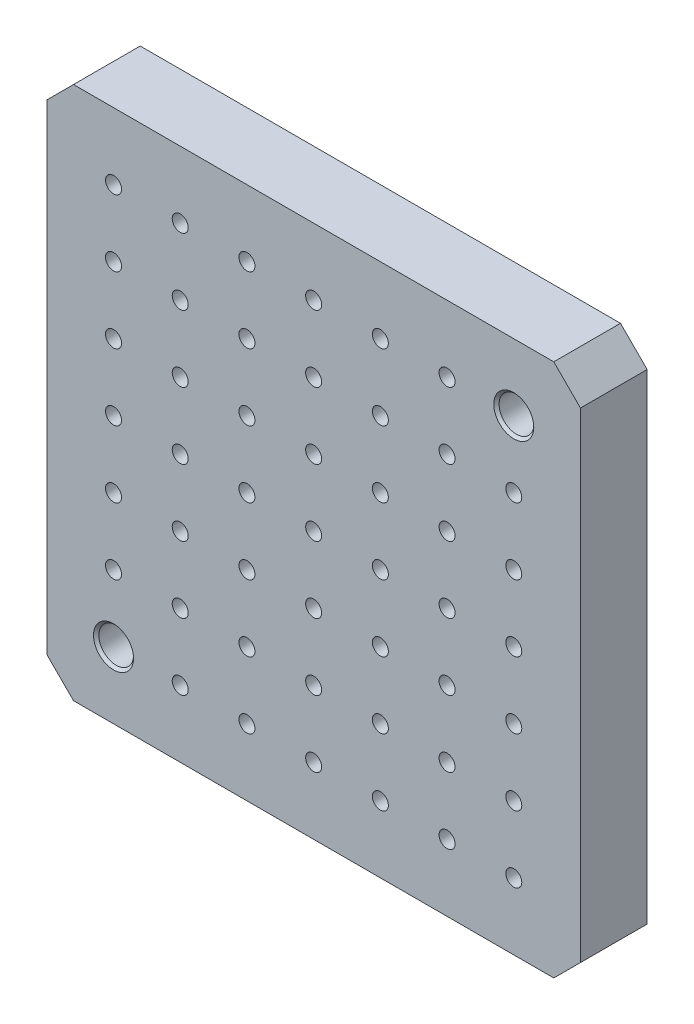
ISO-10303-21;
HEADER;
FILE_DESCRIPTION(('STEP AP214'),'2;1');
FILE_NAME('part.step','',(''),(''),'','','');
FILE_SCHEMA(('AUTOMOTIVE_DESIGN { 1 0 10303 214 1 1 1 1 }'));
ENDSEC;
DATA;
#1=APPLICATION_CONTEXT('core data for automotive mechanical design processes');
#2=APPLICATION_PROTOCOL_DEFINITION('international standard','automotive_design',2000,#1);
#3=PRODUCT_CONTEXT('',#1,'mechanical');
#4=PRODUCT('Part','Part','',(#3));
#5=PRODUCT_RELATED_PRODUCT_CATEGORY('part','',(#4));
#6=PRODUCT_DEFINITION_FORMATION('','',#4);
#7=PRODUCT_DEFINITION_CONTEXT('part definition',#1,'design');
#8=PRODUCT_DEFINITION('design','',#6,#7);
#9=PRODUCT_DEFINITION_SHAPE('','',#8);
#10=(LENGTH_UNIT() NAMED_UNIT(*) SI_UNIT(.MILLI.,.METRE.));
#11=(NAMED_UNIT(*) PLANE_ANGLE_UNIT() SI_UNIT($,.RADIAN.));
#12=(NAMED_UNIT(*) SI_UNIT($,.STERADIAN.) SOLID_ANGLE_UNIT());
#13=UNCERTAINTY_MEASURE_WITH_UNIT(LENGTH_MEASURE(1.E-05),#10,'distance_accuracy_value','');
#14=(GEOMETRIC_REPRESENTATION_CONTEXT(3) GLOBAL_UNCERTAINTY_ASSIGNED_CONTEXT((#13)) GLOBAL_UNIT_ASSIGNED_CONTEXT((#10,
#11,#12)) REPRESENTATION_CONTEXT('',''));
#15=CARTESIAN_POINT('',(0.,0.,0.));
#16=DIRECTION('',(0.,0.,1.));
#17=DIRECTION('',(1.,0.,0.));
#18=AXIS2_PLACEMENT_3D('',#15,#16,#17);
#19=CARTESIAN_POINT('',(0.,0.,0.));
#20=DIRECTION('',(0.,0.,1.));
#21=DIRECTION('',(1.,0.,0.));
#22=AXIS2_PLACEMENT_3D('',#19,#20,#21);
#23=PLANE('',#22);
#24=CARTESIAN_POINT('',(25.,25.,0.));
#25=DIRECTION('',(0.,0.,1.));
#26=DIRECTION('',(1.,0.,0.));
#27=AXIS2_PLACEMENT_3D('',#24,#25,#26);
#28=CIRCLE('',#27,13.5);
#29=CARTESIAN_POINT('',(38.5000000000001,25.,0.));
#30=VERTEX_POINT('',#29);
#31=EDGE_CURVE('E37',#30,#30,#28,.T.);
#32=ORIENTED_EDGE('',*,*,#31,.T.);
#33=EDGE_LOOP('',(#32));
#34=FACE_BOUND('',#33,.T.);
#35=CARTESIAN_POINT('',(175.,175.,0.));
#36=DIRECTION('',(0.,0.,1.));
#37=DIRECTION('',(1.,0.,0.));
#38=AXIS2_PLACEMENT_3D('',#35,#36,#37);
#39=CIRCLE('',#38,13.5);
#40=CARTESIAN_POINT('',(188.5,175.,0.));
#41=VERTEX_POINT('',#40);
#42=EDGE_CURVE('E406',#41,#41,#39,.T.);
#43=ORIENTED_EDGE('',*,*,#42,.T.);
#44=EDGE_LOOP('',(#43));
#45=FACE_BOUND('',#44,.T.);
#46=CARTESIAN_POINT('',(150.,175.,0.));
#47=DIRECTION('',(0.,0.,1.));
#48=DIRECTION('',(1.,0.,0.));
#49=AXIS2_PLACEMENT_3D('',#46,#47,#48);
#50=CIRCLE('',#49,5.99999999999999);
#51=CARTESIAN_POINT('',(156.,175.,0.));
#52=VERTEX_POINT('',#51);
#53=EDGE_CURVE('E410',#52,#52,#50,.T.);
#54=ORIENTED_EDGE('',*,*,#53,.T.);
#55=EDGE_LOOP('',(#54));
#56=FACE_BOUND('',#55,.T.);
#57=CARTESIAN_POINT('',(100.,175.,0.));
#58=DIRECTION('',(0.,0.,1.));
#59=DIRECTION('',(1.,0.,0.));
#60=AXIS2_PLACEMENT_3D('',#57,#58,#59);
#61=CIRCLE('',#60,5.99999999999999);
#62=CARTESIAN_POINT('',(106.,175.,0.));
#63=VERTEX_POINT('',#62);
#64=EDGE_CURVE('E394',#63,#63,#61,.T.);
#65=ORIENTED_EDGE('',*,*,#64,.T.);
#66=EDGE_LOOP('',(#65));
#67=FACE_BOUND('',#66,.T.);
#68=CARTESIAN_POINT('',(50.,175.,0.));
#69=DIRECTION('',(0.,0.,1.));
#70=DIRECTION('',(1.,0.,0.));
#71=AXIS2_PLACEMENT_3D('',#68,#69,#70);
#72=CIRCLE('',#71,5.99999999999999);
#73=CARTESIAN_POINT('',(56.,175.,0.));
#74=VERTEX_POINT('',#73);
#75=EDGE_CURVE('E384',#74,#74,#72,.T.);
#76=ORIENTED_EDGE('',*,*,#75,.T.);
#77=EDGE_LOOP('',(#76));
#78=FACE_BOUND('',#77,.T.);
#79=CARTESIAN_POINT('',(150.,150.,0.));
#80=DIRECTION('',(0.,0.,1.));
#81=DIRECTION('',(1.,0.,0.));
#82=AXIS2_PLACEMENT_3D('',#79,#80,#81);
#83=CIRCLE('',#82,5.99999999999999);
#84=CARTESIAN_POINT('',(156.,150.,0.));
#85=VERTEX_POINT('',#84);
#86=EDGE_CURVE('E369',#85,#85,#83,.T.);
#87=ORIENTED_EDGE('',*,*,#86,.T.);
#88=EDGE_LOOP('',(#87));
#89=FACE_BOUND('',#88,.T.);
#90=CARTESIAN_POINT('',(100.,150.,0.));
#91=DIRECTION('',(0.,0.,1.));
#92=DIRECTION('',(1.,0.,0.));
#93=AXIS2_PLACEMENT_3D('',#90,#91,#92);
#94=CIRCLE('',#93,5.99999999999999);
#95=CARTESIAN_POINT('',(106.,150.,0.));
#96=VERTEX_POINT('',#95);
#97=EDGE_CURVE('E359',#96,#96,#94,.T.);
#98=ORIENTED_EDGE('',*,*,#97,.T.);
#99=EDGE_LOOP('',(#98));
#100=FACE_BOUND('',#99,.T.);
#101=CARTESIAN_POINT('',(50.,150.,0.));
#102=DIRECTION('',(0.,0.,1.));
#103=DIRECTION('',(1.,0.,0.));
#104=AXIS2_PLACEMENT_3D('',#101,#102,#103);
#105=CIRCLE('',#104,5.99999999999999);
#106=CARTESIAN_POINT('',(56.,150.,0.));
#107=VERTEX_POINT('',#106);
#108=EDGE_CURVE('E349',#107,#107,#105,.T.);
#109=ORIENTED_EDGE('',*,*,#108,.T.);
#110=EDGE_LOOP('',(#109));
#111=FACE_BOUND('',#110,.T.);
#112=CARTESIAN_POINT('',(150.,125.,0.));
#113=DIRECTION('',(0.,0.,1.));
#114=DIRECTION('',(1.,0.,0.));
#115=AXIS2_PLACEMENT_3D('',#112,#113,#114);
#116=CIRCLE('',#115,5.99999999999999);
#117=CARTESIAN_POINT('',(156.,125.,0.));
#118=VERTEX_POINT('',#117);
#119=EDGE_CURVE('E334',#118,#118,#116,.T.);
#120=ORIENTED_EDGE('',*,*,#119,.T.);
#121=EDGE_LOOP('',(#120));
#122=FACE_BOUND('',#121,.T.);
#123=CARTESIAN_POINT('',(100.,125.,0.));
#124=DIRECTION('',(0.,0.,1.));
#125=DIRECTION('',(1.,0.,0.));
#126=AXIS2_PLACEMENT_3D('',#123,#124,#125);
#127=CIRCLE('',#126,5.99999999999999);
#128=CARTESIAN_POINT('',(106.,125.,0.));
#129=VERTEX_POINT('',#128);
#130=EDGE_CURVE('E324',#129,#129,#127,.T.);
#131=ORIENTED_EDGE('',*,*,#130,.T.);
#132=EDGE_LOOP('',(#131));
#133=FACE_BOUND('',#132,.T.);
#134=CARTESIAN_POINT('',(50.,125.,0.));
#135=DIRECTION('',(0.,0.,1.));
#136=DIRECTION('',(1.,0.,0.));
#137=AXIS2_PLACEMENT_3D('',#134,#135,#136);
#138=CIRCLE('',#137,5.99999999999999);
#139=CARTESIAN_POINT('',(56.,125.,0.));
#140=VERTEX_POINT('',#139);
#141=EDGE_CURVE('E314',#140,#140,#138,.T.);
#142=ORIENTED_EDGE('',*,*,#141,.T.);
#143=EDGE_LOOP('',(#142));
#144=FACE_BOUND('',#143,.T.);
#145=CARTESIAN_POINT('',(150.,100.,0.));
#146=DIRECTION('',(0.,0.,1.));
#147=DIRECTION('',(1.,0.,0.));
#148=AXIS2_PLACEMENT_3D('',#145,#146,#147);
#149=CIRCLE('',#148,5.99999999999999);
#150=CARTESIAN_POINT('',(156.,100.,0.));
#151=VERTEX_POINT('',#150);
#152=EDGE_CURVE('E299',#151,#151,#149,.T.);
#153=ORIENTED_EDGE('',*,*,#152,.T.);
#154=EDGE_LOOP('',(#153));
#155=FACE_BOUND('',#154,.T.);
#156=CARTESIAN_POINT('',(100.,100.,0.));
#157=DIRECTION('',(0.,0.,1.));
#158=DIRECTION('',(1.,0.,0.));
#159=AXIS2_PLACEMENT_3D('',#156,#157,#158);
#160=CIRCLE('',#159,5.99999999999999);
#161=CARTESIAN_POINT('',(106.,100.,0.));
#162=VERTEX_POINT('',#161);
#163=EDGE_CURVE('E289',#162,#162,#160,.T.);
#164=ORIENTED_EDGE('',*,*,#163,.T.);
#165=EDGE_LOOP('',(#164));
#166=FACE_BOUND('',#165,.T.);
#167=CARTESIAN_POINT('',(50.,100.,0.));
#168=DIRECTION('',(0.,0.,1.));
#169=DIRECTION('',(1.,0.,0.));
#170=AXIS2_PLACEMENT_3D('',#167,#168,#169);
#171=CIRCLE('',#170,5.99999999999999);
#172=CARTESIAN_POINT('',(56.,100.,0.));
#173=VERTEX_POINT('',#172);
#174=EDGE_CURVE('E279',#173,#173,#171,.T.);
#175=ORIENTED_EDGE('',*,*,#174,.T.);
#176=EDGE_LOOP('',(#175));
#177=FACE_BOUND('',#176,.T.);
#178=CARTESIAN_POINT('',(150.,75.,0.));
#179=DIRECTION('',(0.,0.,1.));
#180=DIRECTION('',(1.,0.,0.));
#181=AXIS2_PLACEMENT_3D('',#178,#179,#180);
#182=CIRCLE('',#181,5.99999999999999);
#183=CARTESIAN_POINT('',(156.,75.,0.));
#184=VERTEX_POINT('',#183);
#185=EDGE_CURVE('E264',#184,#184,#182,.T.);
#186=ORIENTED_EDGE('',*,*,#185,.T.);
#187=EDGE_LOOP('',(#186));
#188=FACE_BOUND('',#187,.T.);
#189=CARTESIAN_POINT('',(100.,75.,0.));
#190=DIRECTION('',(0.,0.,1.));
#191=DIRECTION('',(1.,0.,0.));
#192=AXIS2_PLACEMENT_3D('',#189,#190,#191);
#193=CIRCLE('',#192,5.99999999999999);
#194=CARTESIAN_POINT('',(106.,75.,0.));
#195=VERTEX_POINT('',#194);
#196=EDGE_CURVE('E254',#195,#195,#193,.T.);
#197=ORIENTED_EDGE('',*,*,#196,.T.);
#198=EDGE_LOOP('',(#197));
#199=FACE_BOUND('',#198,.T.);
#200=CARTESIAN_POINT('',(50.,75.,0.));
#201=DIRECTION('',(0.,0.,1.));
#202=DIRECTION('',(1.,0.,0.));
#203=AXIS2_PLACEMENT_3D('',#200,#201,#202);
#204=CIRCLE('',#203,5.99999999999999);
#205=CARTESIAN_POINT('',(56.,75.,0.));
#206=VERTEX_POINT('',#205);
#207=EDGE_CURVE('E244',#206,#206,#204,.T.);
#208=ORIENTED_EDGE('',*,*,#207,.T.);
#209=EDGE_LOOP('',(#208));
#210=FACE_BOUND('',#209,.T.);
#211=CARTESIAN_POINT('',(150.,50.,0.));
#212=DIRECTION('',(0.,0.,1.));
#213=DIRECTION('',(1.,0.,0.));
#214=AXIS2_PLACEMENT_3D('',#211,#212,#213);
#215=CIRCLE('',#214,5.99999999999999);
#216=CARTESIAN_POINT('',(156.,50.,0.));
#217=VERTEX_POINT('',#216);
#218=EDGE_CURVE('E229',#217,#217,#215,.T.);
#219=ORIENTED_EDGE('',*,*,#218,.T.);
#220=EDGE_LOOP('',(#219));
#221=FACE_BOUND('',#220,.T.);
#222=CARTESIAN_POINT('',(100.,50.,0.));
#223=DIRECTION('',(0.,0.,1.));
#224=DIRECTION('',(1.,0.,0.));
#225=AXIS2_PLACEMENT_3D('',#222,#223,#224);
#226=CIRCLE('',#225,5.99999999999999);
#227=CARTESIAN_POINT('',(106.,50.,0.));
#228=VERTEX_POINT('',#227);
#229=EDGE_CURVE('E219',#228,#228,#226,.T.);
#230=ORIENTED_EDGE('',*,*,#229,.T.);
#231=EDGE_LOOP('',(#230));
#232=FACE_BOUND('',#231,.T.);
#233=CARTESIAN_POINT('',(50.,50.,0.));
#234=DIRECTION('',(0.,0.,1.));
#235=DIRECTION('',(1.,0.,0.));
#236=AXIS2_PLACEMENT_3D('',#233,#234,#235);
#237=CIRCLE('',#236,5.99999999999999);
#238=CARTESIAN_POINT('',(56.,50.,0.));
#239=VERTEX_POINT('',#238);
#240=EDGE_CURVE('E209',#239,#239,#237,.T.);
#241=ORIENTED_EDGE('',*,*,#240,.T.);
#242=EDGE_LOOP('',(#241));
#243=FACE_BOUND('',#242,.T.);
#244=CARTESIAN_POINT('',(150.,25.,0.));
#245=DIRECTION('',(0.,0.,1.));
#246=DIRECTION('',(1.,0.,0.));
#247=AXIS2_PLACEMENT_3D('',#244,#245,#246);
#248=CIRCLE('',#247,5.99999999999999);
#249=CARTESIAN_POINT('',(156.,25.,0.));
#250=VERTEX_POINT('',#249);
#251=EDGE_CURVE('E194',#250,#250,#248,.T.);
#252=ORIENTED_EDGE('',*,*,#251,.T.);
#253=EDGE_LOOP('',(#252));
#254=FACE_BOUND('',#253,.T.);
#255=CARTESIAN_POINT('',(100.,25.,0.));
#256=DIRECTION('',(0.,0.,1.));
#257=DIRECTION('',(1.,0.,0.));
#258=AXIS2_PLACEMENT_3D('',#255,#256,#257);
#259=CIRCLE('',#258,5.99999999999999);
#260=CARTESIAN_POINT('',(106.,25.,0.));
#261=VERTEX_POINT('',#260);
#262=EDGE_CURVE('E184',#261,#261,#259,.T.);
#263=ORIENTED_EDGE('',*,*,#262,.T.);
#264=EDGE_LOOP('',(#263));
#265=FACE_BOUND('',#264,.T.);
#266=CARTESIAN_POINT('',(50.,25.,0.));
#267=DIRECTION('',(0.,0.,1.));
#268=DIRECTION('',(1.,0.,0.));
#269=AXIS2_PLACEMENT_3D('',#266,#267,#268);
#270=CIRCLE('',#269,5.99999999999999);
#271=CARTESIAN_POINT('',(56.,25.,0.));
#272=VERTEX_POINT('',#271);
#273=EDGE_CURVE('E174',#272,#272,#270,.T.);
#274=ORIENTED_EDGE('',*,*,#273,.T.);
#275=EDGE_LOOP('',(#274));
#276=FACE_BOUND('',#275,.T.);
#277=DIRECTION('',(1.,0.,0.));
#278=VECTOR('',#277,1.);
#279=CARTESIAN_POINT('',(0.,0.,0.));
#280=LINE('',#279,#278);
#281=CARTESIAN_POINT('',(10.0000000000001,0.,0.));
#282=VERTEX_POINT('',#281);
#283=CARTESIAN_POINT('',(190.,0.,0.));
#284=VERTEX_POINT('',#283);
#285=EDGE_CURVE('E113',#282,#284,#280,.T.);
#286=ORIENTED_EDGE('',*,*,#285,.F.);
#287=DIRECTION('',(0.707106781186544,-0.707106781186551,0.));
#288=VECTOR('',#287,1.);
#289=CARTESIAN_POINT('',(10.0000000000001,0.,0.));
#290=LINE('',#289,#288);
#291=CARTESIAN_POINT('',(0.,10.0000000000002,0.));
#292=VERTEX_POINT('',#291);
#293=EDGE_CURVE('E96',#282,#292,#290,.F.);
#294=ORIENTED_EDGE('',*,*,#293,.T.);
#295=DIRECTION('',(0.,-1.,0.));
#296=VECTOR('',#295,1.);
#297=CARTESIAN_POINT('',(0.,200.,0.));
#298=LINE('',#297,#296);
#299=CARTESIAN_POINT('',(0.,190.,0.));
#300=VERTEX_POINT('',#299);
#301=EDGE_CURVE('E123',#300,#292,#298,.T.);
#302=ORIENTED_EDGE('',*,*,#301,.F.);
#303=DIRECTION('',(-0.707106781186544,-0.707106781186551,0.));
#304=VECTOR('',#303,1.);
#305=CARTESIAN_POINT('',(0.,190.,0.));
#306=LINE('',#305,#304);
#307=CARTESIAN_POINT('',(10.0000000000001,200.,0.));
#308=VERTEX_POINT('',#307);
#309=EDGE_CURVE('E117',#300,#308,#306,.F.);
#310=ORIENTED_EDGE('',*,*,#309,.T.);
#311=DIRECTION('',(-1.,0.,0.));
#312=VECTOR('',#311,1.);
#313=CARTESIAN_POINT('',(200.,200.,0.));
#314=LINE('',#313,#312);
#315=CARTESIAN_POINT('',(190.,200.,0.));
#316=VERTEX_POINT('',#315);
#317=EDGE_CURVE('E126',#316,#308,#314,.T.);
#318=ORIENTED_EDGE('',*,*,#317,.F.);
#319=DIRECTION('',(-0.707106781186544,0.707106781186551,0.));
#320=VECTOR('',#319,1.);
#321=CARTESIAN_POINT('',(190.,200.,0.));
#322=LINE('',#321,#320);
#323=CARTESIAN_POINT('',(200.,190.,0.));
#324=VERTEX_POINT('',#323);
#325=EDGE_CURVE('E143',#316,#324,#322,.F.);
#326=ORIENTED_EDGE('',*,*,#325,.T.);
#327=DIRECTION('',(0.,1.,0.));
#328=VECTOR('',#327,1.);
#329=CARTESIAN_POINT('',(200.,0.,0.));
#330=LINE('',#329,#328);
#331=CARTESIAN_POINT('',(200.,10.0000000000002,0.));
#332=VERTEX_POINT('',#331);
#333=EDGE_CURVE('E122',#332,#324,#330,.T.);
#334=ORIENTED_EDGE('',*,*,#333,.F.);
#335=DIRECTION('',(0.707106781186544,0.707106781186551,0.));
#336=VECTOR('',#335,1.);
#337=CARTESIAN_POINT('',(200.,10.0000000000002,0.));
#338=LINE('',#337,#336);
#339=EDGE_CURVE('E107',#332,#284,#338,.F.);
#340=ORIENTED_EDGE('',*,*,#339,.T.);
#341=EDGE_LOOP('',(#286,#294,#302,#310,#318,#326,#334,#340));
#342=FACE_BOUND('',#341,.T.);
#343=CARTESIAN_POINT('',(75.,25.,0.));
#344=DIRECTION('',(0.,0.,1.));
#345=DIRECTION('',(1.,0.,0.));
#346=AXIS2_PLACEMENT_3D('',#343,#344,#345);
#347=CIRCLE('',#346,5.99999999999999);
#348=CARTESIAN_POINT('',(81.,25.,0.));
#349=VERTEX_POINT('',#348);
#350=EDGE_CURVE('E179',#349,#349,#347,.T.);
#351=ORIENTED_EDGE('',*,*,#350,.T.);
#352=EDGE_LOOP('',(#351));
#353=FACE_BOUND('',#352,.T.);
#354=CARTESIAN_POINT('',(125.,25.,0.));
#355=DIRECTION('',(0.,0.,1.));
#356=DIRECTION('',(1.,0.,0.));
#357=AXIS2_PLACEMENT_3D('',#354,#355,#356);
#358=CIRCLE('',#357,5.99999999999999);
#359=CARTESIAN_POINT('',(131.,25.,0.));
#360=VERTEX_POINT('',#359);
#361=EDGE_CURVE('E189',#360,#360,#358,.T.);
#362=ORIENTED_EDGE('',*,*,#361,.T.);
#363=EDGE_LOOP('',(#362));
#364=FACE_BOUND('',#363,.T.);
#365=CARTESIAN_POINT('',(175.,25.,0.));
#366=DIRECTION('',(0.,0.,1.));
#367=DIRECTION('',(1.,0.,0.));
#368=AXIS2_PLACEMENT_3D('',#365,#366,#367);
#369=CIRCLE('',#368,5.99999999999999);
#370=CARTESIAN_POINT('',(181.,25.,0.));
#371=VERTEX_POINT('',#370);
#372=EDGE_CURVE('E1382',#371,#371,#369,.T.);
#373=ORIENTED_EDGE('',*,*,#372,.T.);
#374=EDGE_LOOP('',(#373));
#375=FACE_BOUND('',#374,.T.);
#376=CARTESIAN_POINT('',(25.,50.,0.));
#377=DIRECTION('',(0.,0.,1.));
#378=DIRECTION('',(1.,0.,0.));
#379=AXIS2_PLACEMENT_3D('',#376,#377,#378);
#380=CIRCLE('',#379,5.99999999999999);
#381=CARTESIAN_POINT('',(31.,50.,0.));
#382=VERTEX_POINT('',#381);
#383=EDGE_CURVE('E204',#382,#382,#380,.T.);
#384=ORIENTED_EDGE('',*,*,#383,.T.);
#385=EDGE_LOOP('',(#384));
#386=FACE_BOUND('',#385,.T.);
#387=CARTESIAN_POINT('',(75.,50.,0.));
#388=DIRECTION('',(0.,0.,1.));
#389=DIRECTION('',(1.,0.,0.));
#390=AXIS2_PLACEMENT_3D('',#387,#388,#389);
#391=CIRCLE('',#390,5.99999999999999);
#392=CARTESIAN_POINT('',(81.,50.,0.));
#393=VERTEX_POINT('',#392);
#394=EDGE_CURVE('E214',#393,#393,#391,.T.);
#395=ORIENTED_EDGE('',*,*,#394,.T.);
#396=EDGE_LOOP('',(#395));
#397=FACE_BOUND('',#396,.T.);
#398=CARTESIAN_POINT('',(125.,50.,0.));
#399=DIRECTION('',(0.,0.,1.));
#400=DIRECTION('',(1.,0.,0.));
#401=AXIS2_PLACEMENT_3D('',#398,#399,#400);
#402=CIRCLE('',#401,5.99999999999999);
#403=CARTESIAN_POINT('',(131.,50.,0.));
#404=VERTEX_POINT('',#403);
#405=EDGE_CURVE('E224',#404,#404,#402,.T.);
#406=ORIENTED_EDGE('',*,*,#405,.T.);
#407=EDGE_LOOP('',(#406));
#408=FACE_BOUND('',#407,.T.);
#409=CARTESIAN_POINT('',(175.,50.,0.));
#410=DIRECTION('',(0.,0.,1.));
#411=DIRECTION('',(1.,0.,0.));
#412=AXIS2_PLACEMENT_3D('',#409,#410,#411);
#413=CIRCLE('',#412,5.99999999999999);
#414=CARTESIAN_POINT('',(181.,50.,0.));
#415=VERTEX_POINT('',#414);
#416=EDGE_CURVE('E1333',#415,#415,#413,.T.);
#417=ORIENTED_EDGE('',*,*,#416,.T.);
#418=EDGE_LOOP('',(#417));
#419=FACE_BOUND('',#418,.T.);
#420=CARTESIAN_POINT('',(25.,75.,0.));
#421=DIRECTION('',(0.,0.,1.));
#422=DIRECTION('',(1.,0.,0.));
#423=AXIS2_PLACEMENT_3D('',#420,#421,#422);
#424=CIRCLE('',#423,5.99999999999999);
#425=CARTESIAN_POINT('',(31.,75.,0.));
#426=VERTEX_POINT('',#425);
#427=EDGE_CURVE('E239',#426,#426,#424,.T.);
#428=ORIENTED_EDGE('',*,*,#427,.T.);
#429=EDGE_LOOP('',(#428));
#430=FACE_BOUND('',#429,.T.);
#431=CARTESIAN_POINT('',(75.,75.,0.));
#432=DIRECTION('',(0.,0.,1.));
#433=DIRECTION('',(1.,0.,0.));
#434=AXIS2_PLACEMENT_3D('',#431,#432,#433);
#435=CIRCLE('',#434,5.99999999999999);
#436=CARTESIAN_POINT('',(81.,75.,0.));
#437=VERTEX_POINT('',#436);
#438=EDGE_CURVE('E249',#437,#437,#435,.T.);
#439=ORIENTED_EDGE('',*,*,#438,.T.);
#440=EDGE_LOOP('',(#439));
#441=FACE_BOUND('',#440,.T.);
#442=CARTESIAN_POINT('',(125.,75.,0.));
#443=DIRECTION('',(0.,0.,1.));
#444=DIRECTION('',(1.,0.,0.));
#445=AXIS2_PLACEMENT_3D('',#442,#443,#444);
#446=CIRCLE('',#445,5.99999999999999);
#447=CARTESIAN_POINT('',(131.,75.,0.));
#448=VERTEX_POINT('',#447);
#449=EDGE_CURVE('E259',#448,#448,#446,.T.);
#450=ORIENTED_EDGE('',*,*,#449,.T.);
#451=EDGE_LOOP('',(#450));
#452=FACE_BOUND('',#451,.T.);
#453=CARTESIAN_POINT('',(175.,75.,0.));
#454=DIRECTION('',(0.,0.,1.));
#455=DIRECTION('',(1.,0.,0.));
#456=AXIS2_PLACEMENT_3D('',#453,#454,#455);
#457=CIRCLE('',#456,5.99999999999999);
#458=CARTESIAN_POINT('',(181.,75.,0.));
#459=VERTEX_POINT('',#458);
#460=EDGE_CURVE('E1284',#459,#459,#457,.T.);
#461=ORIENTED_EDGE('',*,*,#460,.T.);
#462=EDGE_LOOP('',(#461));
#463=FACE_BOUND('',#462,.T.);
#464=CARTESIAN_POINT('',(25.,100.,0.));
#465=DIRECTION('',(0.,0.,1.));
#466=DIRECTION('',(1.,0.,0.));
#467=AXIS2_PLACEMENT_3D('',#464,#465,#466);
#468=CIRCLE('',#467,5.99999999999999);
#469=CARTESIAN_POINT('',(31.,100.,0.));
#470=VERTEX_POINT('',#469);
#471=EDGE_CURVE('E274',#470,#470,#468,.T.);
#472=ORIENTED_EDGE('',*,*,#471,.T.);
#473=EDGE_LOOP('',(#472));
#474=FACE_BOUND('',#473,.T.);
#475=CARTESIAN_POINT('',(75.,100.,0.));
#476=DIRECTION('',(0.,0.,1.));
#477=DIRECTION('',(1.,0.,0.));
#478=AXIS2_PLACEMENT_3D('',#475,#476,#477);
#479=CIRCLE('',#478,5.99999999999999);
#480=CARTESIAN_POINT('',(81.,100.,0.));
#481=VERTEX_POINT('',#480);
#482=EDGE_CURVE('E284',#481,#481,#479,.T.);
#483=ORIENTED_EDGE('',*,*,#482,.T.);
#484=EDGE_LOOP('',(#483));
#485=FACE_BOUND('',#484,.T.);
#486=CARTESIAN_POINT('',(125.,100.,0.));
#487=DIRECTION('',(0.,0.,1.));
#488=DIRECTION('',(1.,0.,0.));
#489=AXIS2_PLACEMENT_3D('',#486,#487,#488);
#490=CIRCLE('',#489,5.99999999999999);
#491=CARTESIAN_POINT('',(131.,100.,0.));
#492=VERTEX_POINT('',#491);
#493=EDGE_CURVE('E294',#492,#492,#490,.T.);
#494=ORIENTED_EDGE('',*,*,#493,.T.);
#495=EDGE_LOOP('',(#494));
#496=FACE_BOUND('',#495,.T.);
#497=CARTESIAN_POINT('',(175.,100.,0.));
#498=DIRECTION('',(0.,0.,1.));
#499=DIRECTION('',(1.,0.,0.));
#500=AXIS2_PLACEMENT_3D('',#497,#498,#499);
#501=CIRCLE('',#500,5.99999999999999);
#502=CARTESIAN_POINT('',(181.,100.,0.));
#503=VERTEX_POINT('',#502);
#504=EDGE_CURVE('E1235',#503,#503,#501,.T.);
#505=ORIENTED_EDGE('',*,*,#504,.T.);
#506=EDGE_LOOP('',(#505));
#507=FACE_BOUND('',#506,.T.);
#508=CARTESIAN_POINT('',(25.,125.,0.));
#509=DIRECTION('',(0.,0.,1.));
#510=DIRECTION('',(1.,0.,0.));
#511=AXIS2_PLACEMENT_3D('',#508,#509,#510);
#512=CIRCLE('',#511,5.99999999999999);
#513=CARTESIAN_POINT('',(31.,125.,0.));
#514=VERTEX_POINT('',#513);
#515=EDGE_CURVE('E309',#514,#514,#512,.T.);
#516=ORIENTED_EDGE('',*,*,#515,.T.);
#517=EDGE_LOOP('',(#516));
#518=FACE_BOUND('',#517,.T.);
#519=CARTESIAN_POINT('',(75.,125.,0.));
#520=DIRECTION('',(0.,0.,1.));
#521=DIRECTION('',(1.,0.,0.));
#522=AXIS2_PLACEMENT_3D('',#519,#520,#521);
#523=CIRCLE('',#522,5.99999999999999);
#524=CARTESIAN_POINT('',(81.,125.,0.));
#525=VERTEX_POINT('',#524);
#526=EDGE_CURVE('E319',#525,#525,#523,.T.);
#527=ORIENTED_EDGE('',*,*,#526,.T.);
#528=EDGE_LOOP('',(#527));
#529=FACE_BOUND('',#528,.T.);
#530=CARTESIAN_POINT('',(125.,125.,0.));
#531=DIRECTION('',(0.,0.,1.));
#532=DIRECTION('',(1.,0.,0.));
#533=AXIS2_PLACEMENT_3D('',#530,#531,#532);
#534=CIRCLE('',#533,5.99999999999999);
#535=CARTESIAN_POINT('',(131.,125.,0.));
#536=VERTEX_POINT('',#535);
#537=EDGE_CURVE('E329',#536,#536,#534,.T.);
#538=ORIENTED_EDGE('',*,*,#537,.T.);
#539=EDGE_LOOP('',(#538));
#540=FACE_BOUND('',#539,.T.);
#541=CARTESIAN_POINT('',(175.,125.,0.));
#542=DIRECTION('',(0.,0.,1.));
#543=DIRECTION('',(1.,0.,0.));
#544=AXIS2_PLACEMENT_3D('',#541,#542,#543);
#545=CIRCLE('',#544,5.99999999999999);
#546=CARTESIAN_POINT('',(181.,125.,0.));
#547=VERTEX_POINT('',#546);
#548=EDGE_CURVE('E1186',#547,#547,#545,.T.);
#549=ORIENTED_EDGE('',*,*,#548,.T.);
#550=EDGE_LOOP('',(#549));
#551=FACE_BOUND('',#550,.T.);
#552=CARTESIAN_POINT('',(25.,150.,0.));
#553=DIRECTION('',(0.,0.,1.));
#554=DIRECTION('',(1.,0.,0.));
#555=AXIS2_PLACEMENT_3D('',#552,#553,#554);
#556=CIRCLE('',#555,5.99999999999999);
#557=CARTESIAN_POINT('',(31.,150.,0.));
#558=VERTEX_POINT('',#557);
#559=EDGE_CURVE('E344',#558,#558,#556,.T.);
#560=ORIENTED_EDGE('',*,*,#559,.T.);
#561=EDGE_LOOP('',(#560));
#562=FACE_BOUND('',#561,.T.);
#563=CARTESIAN_POINT('',(75.,150.,0.));
#564=DIRECTION('',(0.,0.,1.));
#565=DIRECTION('',(1.,0.,0.));
#566=AXIS2_PLACEMENT_3D('',#563,#564,#565);
#567=CIRCLE('',#566,5.99999999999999);
#568=CARTESIAN_POINT('',(81.,150.,0.));
#569=VERTEX_POINT('',#568);
#570=EDGE_CURVE('E354',#569,#569,#567,.T.);
#571=ORIENTED_EDGE('',*,*,#570,.T.);
#572=EDGE_LOOP('',(#571));
#573=FACE_BOUND('',#572,.T.);
#574=CARTESIAN_POINT('',(125.,150.,0.));
#575=DIRECTION('',(0.,0.,1.));
#576=DIRECTION('',(1.,0.,0.));
#577=AXIS2_PLACEMENT_3D('',#574,#575,#576);
#578=CIRCLE('',#577,5.99999999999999);
#579=CARTESIAN_POINT('',(131.,150.,0.));
#580=VERTEX_POINT('',#579);
#581=EDGE_CURVE('E364',#580,#580,#578,.T.);
#582=ORIENTED_EDGE('',*,*,#581,.T.);
#583=EDGE_LOOP('',(#582));
#584=FACE_BOUND('',#583,.T.);
#585=CARTESIAN_POINT('',(175.,150.,0.));
#586=DIRECTION('',(0.,0.,1.));
#587=DIRECTION('',(1.,0.,0.));
#588=AXIS2_PLACEMENT_3D('',#585,#586,#587);
#589=CIRCLE('',#588,5.99999999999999);
#590=CARTESIAN_POINT('',(181.,150.,0.));
#591=VERTEX_POINT('',#590);
#592=EDGE_CURVE('E1137',#591,#591,#589,.T.);
#593=ORIENTED_EDGE('',*,*,#592,.T.);
#594=EDGE_LOOP('',(#593));
#595=FACE_BOUND('',#594,.T.);
#596=CARTESIAN_POINT('',(25.,175.,0.));
#597=DIRECTION('',(0.,0.,1.));
#598=DIRECTION('',(1.,0.,0.));
#599=AXIS2_PLACEMENT_3D('',#596,#597,#598);
#600=CIRCLE('',#599,5.99999999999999);
#601=CARTESIAN_POINT('',(31.,175.,0.));
#602=VERTEX_POINT('',#601);
#603=EDGE_CURVE('E379',#602,#602,#600,.T.);
#604=ORIENTED_EDGE('',*,*,#603,.T.);
#605=EDGE_LOOP('',(#604));
#606=FACE_BOUND('',#605,.T.);
#607=CARTESIAN_POINT('',(75.,175.,0.));
#608=DIRECTION('',(0.,0.,1.));
#609=DIRECTION('',(1.,0.,0.));
#610=AXIS2_PLACEMENT_3D('',#607,#608,#609);
#611=CIRCLE('',#610,5.99999999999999);
#612=CARTESIAN_POINT('',(81.,175.,0.));
#613=VERTEX_POINT('',#612);
#614=EDGE_CURVE('E389',#613,#613,#611,.T.);
#615=ORIENTED_EDGE('',*,*,#614,.T.);
#616=EDGE_LOOP('',(#615));
#617=FACE_BOUND('',#616,.T.);
#618=CARTESIAN_POINT('',(125.,175.,0.));
#619=DIRECTION('',(0.,0.,1.));
#620=DIRECTION('',(1.,0.,0.));
#621=AXIS2_PLACEMENT_3D('',#618,#619,#620);
#622=CIRCLE('',#621,5.99999999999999);
#623=CARTESIAN_POINT('',(131.,175.,0.));
#624=VERTEX_POINT('',#623);
#625=EDGE_CURVE('E399',#624,#624,#622,.T.);
#626=ORIENTED_EDGE('',*,*,#625,.T.);
#627=EDGE_LOOP('',(#626));
#628=FACE_BOUND('',#627,.T.);
#629=ADVANCED_FACE('F29',(#34,#45,#56,#67,#78,#89,#100,#111,#122,#133,#144,#155,#166,#177,#188,
#199,#210,#221,#232,#243,#254,#265,#276,#342,#353,#364,#375,#386,#397,#408,#419,#430,#441,#452,
#463,#474,#485,#496,#507,#518,#529,#540,#551,#562,#573,#584,#595,#606,#617,#628),#23,.F.);
#630=CARTESIAN_POINT('',(0.,0.,25.));
#631=DIRECTION('',(0.,0.,1.));
#632=DIRECTION('',(1.,0.,0.));
#633=AXIS2_PLACEMENT_3D('',#630,#631,#632);
#634=PLANE('',#633);
#635=CARTESIAN_POINT('',(25.,25.,25.));
#636=DIRECTION('',(0.,0.,1.));
#637=DIRECTION('',(1.,0.,0.));
#638=AXIS2_PLACEMENT_3D('',#635,#636,#637);
#639=CIRCLE('',#638,7.50000000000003);
#640=CARTESIAN_POINT('',(32.5000000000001,25.,25.));
#641=VERTEX_POINT('',#640);
#642=EDGE_CURVE('E420',#641,#641,#639,.F.);
#643=ORIENTED_EDGE('',*,*,#642,.T.);
#644=EDGE_LOOP('',(#643));
#645=FACE_BOUND('',#644,.T.);
#646=CARTESIAN_POINT('',(150.,175.,25.));
#647=DIRECTION('',(0.,0.,1.));
#648=DIRECTION('',(1.,0.,0.));
#649=AXIS2_PLACEMENT_3D('',#646,#647,#648);
#650=CIRCLE('',#649,3.);
#651=CARTESIAN_POINT('',(153.,175.,25.));
#652=VERTEX_POINT('',#651);
#653=EDGE_CURVE('E374',#652,#652,#650,.T.);
#654=ORIENTED_EDGE('',*,*,#653,.F.);
#655=EDGE_LOOP('',(#654));
#656=FACE_BOUND('',#655,.T.);
#657=CARTESIAN_POINT('',(100.,175.,25.));
#658=DIRECTION('',(0.,0.,1.));
#659=DIRECTION('',(1.,0.,0.));
#660=AXIS2_PLACEMENT_3D('',#657,#658,#659);
#661=CIRCLE('',#660,3.);
#662=CARTESIAN_POINT('',(103.,175.,25.));
#663=VERTEX_POINT('',#662);
#664=EDGE_CURVE('E1125',#663,#663,#661,.T.);
#665=ORIENTED_EDGE('',*,*,#664,.F.);
#666=EDGE_LOOP('',(#665));
#667=FACE_BOUND('',#666,.T.);
#668=CARTESIAN_POINT('',(50.,175.,25.));
#669=DIRECTION('',(0.,0.,1.));
#670=DIRECTION('',(1.,0.,0.));
#671=AXIS2_PLACEMENT_3D('',#668,#669,#670);
#672=CIRCLE('',#671,3.);
#673=CARTESIAN_POINT('',(53.,175.,25.));
#674=VERTEX_POINT('',#673);
#675=EDGE_CURVE('E1131',#674,#674,#672,.T.);
#676=ORIENTED_EDGE('',*,*,#675,.F.);
#677=EDGE_LOOP('',(#676));
#678=FACE_BOUND('',#677,.T.);
#679=CARTESIAN_POINT('',(175.,150.,25.));
#680=DIRECTION('',(0.,0.,1.));
#681=DIRECTION('',(1.,0.,0.));
#682=AXIS2_PLACEMENT_3D('',#679,#680,#681);
#683=CIRCLE('',#682,3.);
#684=CARTESIAN_POINT('',(178.,150.,25.));
#685=VERTEX_POINT('',#684);
#686=EDGE_CURVE('E339',#685,#685,#683,.T.);
#687=ORIENTED_EDGE('',*,*,#686,.F.);
#688=EDGE_LOOP('',(#687));
#689=FACE_BOUND('',#688,.T.);
#690=CARTESIAN_POINT('',(125.,150.,25.));
#691=DIRECTION('',(0.,0.,1.));
#692=DIRECTION('',(1.,0.,0.));
#693=AXIS2_PLACEMENT_3D('',#690,#691,#692);
#694=CIRCLE('',#693,3.);
#695=CARTESIAN_POINT('',(128.,150.,25.));
#696=VERTEX_POINT('',#695);
#697=EDGE_CURVE('E1171',#696,#696,#694,.T.);
#698=ORIENTED_EDGE('',*,*,#697,.F.);
#699=EDGE_LOOP('',(#698));
#700=FACE_BOUND('',#699,.T.);
#701=CARTESIAN_POINT('',(75.,150.,25.));
#702=DIRECTION('',(0.,0.,1.));
#703=DIRECTION('',(1.,0.,0.));
#704=AXIS2_PLACEMENT_3D('',#701,#702,#703);
#705=CIRCLE('',#704,3.);
#706=CARTESIAN_POINT('',(78.,150.,25.));
#707=VERTEX_POINT('',#706);
#708=EDGE_CURVE('E1177',#707,#707,#705,.T.);
#709=ORIENTED_EDGE('',*,*,#708,.F.);
#710=EDGE_LOOP('',(#709));
#711=FACE_BOUND('',#710,.T.);
#712=CARTESIAN_POINT('',(25.,150.,25.));
#713=DIRECTION('',(0.,0.,1.));
#714=DIRECTION('',(1.,0.,0.));
#715=AXIS2_PLACEMENT_3D('',#712,#713,#714);
#716=CIRCLE('',#715,3.);
#717=CARTESIAN_POINT('',(28.,150.,25.));
#718=VERTEX_POINT('',#717);
#719=EDGE_CURVE('E1183',#718,#718,#716,.T.);
#720=ORIENTED_EDGE('',*,*,#719,.F.);
#721=EDGE_LOOP('',(#720));
#722=FACE_BOUND('',#721,.T.);
#723=CARTESIAN_POINT('',(150.,125.,25.));
#724=DIRECTION('',(0.,0.,1.));
#725=DIRECTION('',(1.,0.,0.));
#726=AXIS2_PLACEMENT_3D('',#723,#724,#725);
#727=CIRCLE('',#726,3.);
#728=CARTESIAN_POINT('',(153.,125.,25.));
#729=VERTEX_POINT('',#728);
#730=EDGE_CURVE('E1217',#729,#729,#727,.T.);
#731=ORIENTED_EDGE('',*,*,#730,.F.);
#732=EDGE_LOOP('',(#731));
#733=FACE_BOUND('',#732,.T.);
#734=CARTESIAN_POINT('',(100.,125.,25.));
#735=DIRECTION('',(0.,0.,1.));
#736=DIRECTION('',(1.,0.,0.));
#737=AXIS2_PLACEMENT_3D('',#734,#735,#736);
#738=CIRCLE('',#737,3.);
#739=CARTESIAN_POINT('',(103.,125.,25.));
#740=VERTEX_POINT('',#739);
#741=EDGE_CURVE('E1223',#740,#740,#738,.T.);
#742=ORIENTED_EDGE('',*,*,#741,.F.);
#743=EDGE_LOOP('',(#742));
#744=FACE_BOUND('',#743,.T.);
#745=CARTESIAN_POINT('',(50.,125.,25.));
#746=DIRECTION('',(0.,0.,1.));
#747=DIRECTION('',(1.,0.,0.));
#748=AXIS2_PLACEMENT_3D('',#745,#746,#747);
#749=CIRCLE('',#748,3.);
#750=CARTESIAN_POINT('',(53.,125.,25.));
#751=VERTEX_POINT('',#750);
#752=EDGE_CURVE('E1229',#751,#751,#749,.T.);
#753=ORIENTED_EDGE('',*,*,#752,.F.);
#754=EDGE_LOOP('',(#753));
#755=FACE_BOUND('',#754,.T.);
#756=CARTESIAN_POINT('',(175.,100.,25.));
#757=DIRECTION('',(0.,0.,1.));
#758=DIRECTION('',(1.,0.,0.));
#759=AXIS2_PLACEMENT_3D('',#756,#757,#758);
#760=CIRCLE('',#759,3.);
#761=CARTESIAN_POINT('',(178.,100.,25.));
#762=VERTEX_POINT('',#761);
#763=EDGE_CURVE('E269',#762,#762,#760,.T.);
#764=ORIENTED_EDGE('',*,*,#763,.F.);
#765=EDGE_LOOP('',(#764));
#766=FACE_BOUND('',#765,.T.);
#767=CARTESIAN_POINT('',(125.,100.,25.));
#768=DIRECTION('',(0.,0.,1.));
#769=DIRECTION('',(1.,0.,0.));
#770=AXIS2_PLACEMENT_3D('',#767,#768,#769);
#771=CIRCLE('',#770,3.);
#772=CARTESIAN_POINT('',(128.,100.,25.));
#773=VERTEX_POINT('',#772);
#774=EDGE_CURVE('E1269',#773,#773,#771,.T.);
#775=ORIENTED_EDGE('',*,*,#774,.F.);
#776=EDGE_LOOP('',(#775));
#777=FACE_BOUND('',#776,.T.);
#778=CARTESIAN_POINT('',(75.,100.,25.));
#779=DIRECTION('',(0.,0.,1.));
#780=DIRECTION('',(1.,0.,0.));
#781=AXIS2_PLACEMENT_3D('',#778,#779,#780);
#782=CIRCLE('',#781,3.);
#783=CARTESIAN_POINT('',(78.,100.,25.));
#784=VERTEX_POINT('',#783);
#785=EDGE_CURVE('E1275',#784,#784,#782,.T.);
#786=ORIENTED_EDGE('',*,*,#785,.F.);
#787=EDGE_LOOP('',(#786));
#788=FACE_BOUND('',#787,.T.);
#789=CARTESIAN_POINT('',(25.,100.,25.));
#790=DIRECTION('',(0.,0.,1.));
#791=DIRECTION('',(1.,0.,0.));
#792=AXIS2_PLACEMENT_3D('',#789,#790,#791);
#793=CIRCLE('',#792,3.);
#794=CARTESIAN_POINT('',(28.,100.,25.));
#795=VERTEX_POINT('',#794);
#796=EDGE_CURVE('E1281',#795,#795,#793,.T.);
#797=ORIENTED_EDGE('',*,*,#796,.F.);
#798=EDGE_LOOP('',(#797));
#799=FACE_BOUND('',#798,.T.);
#800=CARTESIAN_POINT('',(150.,75.,25.));
#801=DIRECTION('',(0.,0.,1.));
#802=DIRECTION('',(1.,0.,0.));
#803=AXIS2_PLACEMENT_3D('',#800,#801,#802);
#804=CIRCLE('',#803,3.);
#805=CARTESIAN_POINT('',(153.,75.,25.));
#806=VERTEX_POINT('',#805);
#807=EDGE_CURVE('E1315',#806,#806,#804,.T.);
#808=ORIENTED_EDGE('',*,*,#807,.F.);
#809=EDGE_LOOP('',(#808));
#810=FACE_BOUND('',#809,.T.);
#811=CARTESIAN_POINT('',(100.,75.,25.));
#812=DIRECTION('',(0.,0.,1.));
#813=DIRECTION('',(1.,0.,0.));
#814=AXIS2_PLACEMENT_3D('',#811,#812,#813);
#815=CIRCLE('',#814,3.);
#816=CARTESIAN_POINT('',(103.,75.,25.));
#817=VERTEX_POINT('',#816);
#818=EDGE_CURVE('E1321',#817,#817,#815,.T.);
#819=ORIENTED_EDGE('',*,*,#818,.F.);
#820=EDGE_LOOP('',(#819));
#821=FACE_BOUND('',#820,.T.);
#822=CARTESIAN_POINT('',(50.,75.,25.));
#823=DIRECTION('',(0.,0.,1.));
#824=DIRECTION('',(1.,0.,0.));
#825=AXIS2_PLACEMENT_3D('',#822,#823,#824);
#826=CIRCLE('',#825,3.);
#827=CARTESIAN_POINT('',(53.,75.,25.));
#828=VERTEX_POINT('',#827);
#829=EDGE_CURVE('E1327',#828,#828,#826,.T.);
#830=ORIENTED_EDGE('',*,*,#829,.F.);
#831=EDGE_LOOP('',(#830));
#832=FACE_BOUND('',#831,.T.);
#833=CARTESIAN_POINT('',(175.,50.,25.));
#834=DIRECTION('',(0.,0.,1.));
#835=DIRECTION('',(1.,0.,0.));
#836=AXIS2_PLACEMENT_3D('',#833,#834,#835);
#837=CIRCLE('',#836,3.);
#838=CARTESIAN_POINT('',(178.,50.,25.));
#839=VERTEX_POINT('',#838);
#840=EDGE_CURVE('E199',#839,#839,#837,.T.);
#841=ORIENTED_EDGE('',*,*,#840,.F.);
#842=EDGE_LOOP('',(#841));
#843=FACE_BOUND('',#842,.T.);
#844=CARTESIAN_POINT('',(125.,50.,25.));
#845=DIRECTION('',(0.,0.,1.));
#846=DIRECTION('',(1.,0.,0.));
#847=AXIS2_PLACEMENT_3D('',#844,#845,#846);
#848=CIRCLE('',#847,3.);
#849=CARTESIAN_POINT('',(128.,50.,25.));
#850=VERTEX_POINT('',#849);
#851=EDGE_CURVE('E1367',#850,#850,#848,.T.);
#852=ORIENTED_EDGE('',*,*,#851,.F.);
#853=EDGE_LOOP('',(#852));
#854=FACE_BOUND('',#853,.T.);
#855=CARTESIAN_POINT('',(75.,50.,25.));
#856=DIRECTION('',(0.,0.,1.));
#857=DIRECTION('',(1.,0.,0.));
#858=AXIS2_PLACEMENT_3D('',#855,#856,#857);
#859=CIRCLE('',#858,3.);
#860=CARTESIAN_POINT('',(78.,50.,25.));
#861=VERTEX_POINT('',#860);
#862=EDGE_CURVE('E1373',#861,#861,#859,.T.);
#863=ORIENTED_EDGE('',*,*,#862,.F.);
#864=EDGE_LOOP('',(#863));
#865=FACE_BOUND('',#864,.T.);
#866=CARTESIAN_POINT('',(25.,50.,25.));
#867=DIRECTION('',(0.,0.,1.));
#868=DIRECTION('',(1.,0.,0.));
#869=AXIS2_PLACEMENT_3D('',#866,#867,#868);
#870=CIRCLE('',#869,3.);
#871=CARTESIAN_POINT('',(28.,50.,25.));
#872=VERTEX_POINT('',#871);
#873=EDGE_CURVE('E1379',#872,#872,#870,.T.);
#874=ORIENTED_EDGE('',*,*,#873,.F.);
#875=EDGE_LOOP('',(#874));
#876=FACE_BOUND('',#875,.T.);
#877=CARTESIAN_POINT('',(150.,25.,25.));
#878=DIRECTION('',(0.,0.,1.));
#879=DIRECTION('',(1.,0.,0.));
#880=AXIS2_PLACEMENT_3D('',#877,#878,#879);
#881=CIRCLE('',#880,3.);
#882=CARTESIAN_POINT('',(153.,25.,25.));
#883=VERTEX_POINT('',#882);
#884=EDGE_CURVE('E1409',#883,#883,#881,.T.);
#885=ORIENTED_EDGE('',*,*,#884,.F.);
#886=EDGE_LOOP('',(#885));
#887=FACE_BOUND('',#886,.T.);
#888=CARTESIAN_POINT('',(100.,25.,25.));
#889=DIRECTION('',(0.,0.,1.));
#890=DIRECTION('',(1.,0.,0.));
#891=AXIS2_PLACEMENT_3D('',#888,#889,#890);
#892=CIRCLE('',#891,3.);
#893=CARTESIAN_POINT('',(103.,25.,25.));
#894=VERTEX_POINT('',#893);
#895=EDGE_CURVE('E1415',#894,#894,#892,.T.);
#896=ORIENTED_EDGE('',*,*,#895,.F.);
#897=EDGE_LOOP('',(#896));
#898=FACE_BOUND('',#897,.T.);
#899=CARTESIAN_POINT('',(50.,25.,25.));
#900=DIRECTION('',(0.,0.,1.));
#901=DIRECTION('',(1.,0.,0.));
#902=AXIS2_PLACEMENT_3D('',#899,#900,#901);
#903=CIRCLE('',#902,3.);
#904=CARTESIAN_POINT('',(53.,25.,25.));
#905=VERTEX_POINT('',#904);
#906=EDGE_CURVE('E128',#905,#905,#903,.T.);
#907=ORIENTED_EDGE('',*,*,#906,.F.);
#908=EDGE_LOOP('',(#907));
#909=FACE_BOUND('',#908,.T.);
#910=DIRECTION('',(0.,-1.,0.));
#911=VECTOR('',#910,1.);
#912=CARTESIAN_POINT('',(0.,200.,25.));
#913=LINE('',#912,#911);
#914=CARTESIAN_POINT('',(0.,190.,25.));
#915=VERTEX_POINT('',#914);
#916=CARTESIAN_POINT('',(0.,10.0000000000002,25.));
#917=VERTEX_POINT('',#916);
#918=EDGE_CURVE('E133',#915,#917,#913,.T.);
#919=ORIENTED_EDGE('',*,*,#918,.T.);
#920=DIRECTION('',(-0.707106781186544,0.707106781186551,0.));
#921=VECTOR('',#920,1.);
#922=CARTESIAN_POINT('',(5.00000000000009,5.00000000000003,25.));
#923=LINE('',#922,#921);
#924=CARTESIAN_POINT('',(10.0000000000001,0.,25.));
#925=VERTEX_POINT('',#924);
#926=EDGE_CURVE('E154',#917,#925,#923,.F.);
#927=ORIENTED_EDGE('',*,*,#926,.T.);
#928=DIRECTION('',(1.,0.,0.));
#929=VECTOR('',#928,1.);
#930=CARTESIAN_POINT('',(0.,0.,25.));
#931=LINE('',#930,#929);
#932=CARTESIAN_POINT('',(190.,0.,25.));
#933=VERTEX_POINT('',#932);
#934=EDGE_CURVE('E116',#925,#933,#931,.T.);
#935=ORIENTED_EDGE('',*,*,#934,.T.);
#936=DIRECTION('',(-0.707106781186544,-0.707106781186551,0.));
#937=VECTOR('',#936,1.);
#938=CARTESIAN_POINT('',(95.000000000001,-95.,25.));
#939=LINE('',#938,#937);
#940=CARTESIAN_POINT('',(200.,10.0000000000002,25.));
#941=VERTEX_POINT('',#940);
#942=EDGE_CURVE('E152',#933,#941,#939,.F.);
#943=ORIENTED_EDGE('',*,*,#942,.T.);
#944=DIRECTION('',(0.,1.,0.));
#945=VECTOR('',#944,1.);
#946=CARTESIAN_POINT('',(200.,0.,25.));
#947=LINE('',#946,#945);
#948=CARTESIAN_POINT('',(200.,190.,25.));
#949=VERTEX_POINT('',#948);
#950=EDGE_CURVE('E137',#941,#949,#947,.T.);
#951=ORIENTED_EDGE('',*,*,#950,.T.);
#952=DIRECTION('',(0.707106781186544,-0.707106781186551,0.));
#953=VECTOR('',#952,1.);
#954=CARTESIAN_POINT('',(195.000000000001,194.999999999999,25.));
#955=LINE('',#954,#953);
#956=CARTESIAN_POINT('',(190.,200.,25.));
#957=VERTEX_POINT('',#956);
#958=EDGE_CURVE('E51',#949,#957,#955,.F.);
#959=ORIENTED_EDGE('',*,*,#958,.T.);
#960=DIRECTION('',(-1.,0.,0.));
#961=VECTOR('',#960,1.);
#962=CARTESIAN_POINT('',(200.,200.,25.));
#963=LINE('',#962,#961);
#964=CARTESIAN_POINT('',(10.0000000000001,200.,25.));
#965=VERTEX_POINT('',#964);
#966=EDGE_CURVE('E139',#957,#965,#963,.T.);
#967=ORIENTED_EDGE('',*,*,#966,.T.);
#968=DIRECTION('',(0.707106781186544,0.707106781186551,0.));
#969=VECTOR('',#968,1.);
#970=CARTESIAN_POINT('',(-94.9999999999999,94.999999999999,25.));
#971=LINE('',#970,#969);
#972=EDGE_CURVE('E149',#965,#915,#971,.F.);
#973=ORIENTED_EDGE('',*,*,#972,.T.);
#974=EDGE_LOOP('',(#919,#927,#935,#943,#951,#959,#967,#973));
#975=FACE_BOUND('',#974,.T.);
#976=CARTESIAN_POINT('',(75.,25.,25.));
#977=DIRECTION('',(0.,0.,1.));
#978=DIRECTION('',(1.,0.,0.));
#979=AXIS2_PLACEMENT_3D('',#976,#977,#978);
#980=CIRCLE('',#979,3.);
#981=CARTESIAN_POINT('',(78.,25.,25.));
#982=VERTEX_POINT('',#981);
#983=EDGE_CURVE('E1418',#982,#982,#980,.T.);
#984=ORIENTED_EDGE('',*,*,#983,.F.);
#985=EDGE_LOOP('',(#984));
#986=FACE_BOUND('',#985,.T.);
#987=CARTESIAN_POINT('',(125.,25.,25.));
#988=DIRECTION('',(0.,0.,1.));
#989=DIRECTION('',(1.,0.,0.));
#990=AXIS2_PLACEMENT_3D('',#987,#988,#989);
#991=CIRCLE('',#990,3.);
#992=CARTESIAN_POINT('',(128.,25.,25.));
#993=VERTEX_POINT('',#992);
#994=EDGE_CURVE('E1412',#993,#993,#991,.T.);
#995=ORIENTED_EDGE('',*,*,#994,.F.);
#996=EDGE_LOOP('',(#995));
#997=FACE_BOUND('',#996,.T.);
#998=CARTESIAN_POINT('',(175.,25.,25.));
#999=DIRECTION('',(0.,0.,1.));
#1000=DIRECTION('',(1.,0.,0.));
#1001=AXIS2_PLACEMENT_3D('',#998,#999,#1000);
#1002=CIRCLE('',#1001,3.);
#1003=CARTESIAN_POINT('',(178.,25.,25.));
#1004=VERTEX_POINT('',#1003);
#1005=EDGE_CURVE('E169',#1004,#1004,#1002,.T.);
#1006=ORIENTED_EDGE('',*,*,#1005,.F.);
#1007=EDGE_LOOP('',(#1006));
#1008=FACE_BOUND('',#1007,.T.);
#1009=CARTESIAN_POINT('',(50.,50.,25.));
#1010=DIRECTION('',(0.,0.,1.));
#1011=DIRECTION('',(1.,0.,0.));
#1012=AXIS2_PLACEMENT_3D('',#1009,#1010,#1011);
#1013=CIRCLE('',#1012,3.);
#1014=CARTESIAN_POINT('',(53.,50.,25.));
#1015=VERTEX_POINT('',#1014);
#1016=EDGE_CURVE('E1376',#1015,#1015,#1013,.T.);
#1017=ORIENTED_EDGE('',*,*,#1016,.F.);
#1018=EDGE_LOOP('',(#1017));
#1019=FACE_BOUND('',#1018,.T.);
#1020=CARTESIAN_POINT('',(100.,50.,25.));
#1021=DIRECTION('',(0.,0.,1.));
#1022=DIRECTION('',(1.,0.,0.));
#1023=AXIS2_PLACEMENT_3D('',#1020,#1021,#1022);
#1024=CIRCLE('',#1023,3.);
#1025=CARTESIAN_POINT('',(103.,50.,25.));
#1026=VERTEX_POINT('',#1025);
#1027=EDGE_CURVE('E1370',#1026,#1026,#1024,.T.);
#1028=ORIENTED_EDGE('',*,*,#1027,.F.);
#1029=EDGE_LOOP('',(#1028));
#1030=FACE_BOUND('',#1029,.T.);
#1031=CARTESIAN_POINT('',(150.,50.,25.));
#1032=DIRECTION('',(0.,0.,1.));
#1033=DIRECTION('',(1.,0.,0.));
#1034=AXIS2_PLACEMENT_3D('',#1031,#1032,#1033);
#1035=CIRCLE('',#1034,3.);
#1036=CARTESIAN_POINT('',(153.,50.,25.));
#1037=VERTEX_POINT('',#1036);
#1038=EDGE_CURVE('E1364',#1037,#1037,#1035,.T.);
#1039=ORIENTED_EDGE('',*,*,#1038,.F.);
#1040=EDGE_LOOP('',(#1039));
#1041=FACE_BOUND('',#1040,.T.);
#1042=CARTESIAN_POINT('',(25.,75.,25.));
#1043=DIRECTION('',(0.,0.,1.));
#1044=DIRECTION('',(1.,0.,0.));
#1045=AXIS2_PLACEMENT_3D('',#1042,#1043,#1044);
#1046=CIRCLE('',#1045,3.);
#1047=CARTESIAN_POINT('',(28.,75.,25.));
#1048=VERTEX_POINT('',#1047);
#1049=EDGE_CURVE('E1330',#1048,#1048,#1046,.T.);
#1050=ORIENTED_EDGE('',*,*,#1049,.F.);
#1051=EDGE_LOOP('',(#1050));
#1052=FACE_BOUND('',#1051,.T.);
#1053=CARTESIAN_POINT('',(75.,75.,25.));
#1054=DIRECTION('',(0.,0.,1.));
#1055=DIRECTION('',(1.,0.,0.));
#1056=AXIS2_PLACEMENT_3D('',#1053,#1054,#1055);
#1057=CIRCLE('',#1056,3.);
#1058=CARTESIAN_POINT('',(78.,75.,25.));
#1059=VERTEX_POINT('',#1058);
#1060=EDGE_CURVE('E1324',#1059,#1059,#1057,.T.);
#1061=ORIENTED_EDGE('',*,*,#1060,.F.);
#1062=EDGE_LOOP('',(#1061));
#1063=FACE_BOUND('',#1062,.T.);
#1064=CARTESIAN_POINT('',(125.,75.,25.));
#1065=DIRECTION('',(0.,0.,1.));
#1066=DIRECTION('',(1.,0.,0.));
#1067=AXIS2_PLACEMENT_3D('',#1064,#1065,#1066);
#1068=CIRCLE('',#1067,3.);
#1069=CARTESIAN_POINT('',(128.,75.,25.));
#1070=VERTEX_POINT('',#1069);
#1071=EDGE_CURVE('E1318',#1070,#1070,#1068,.T.);
#1072=ORIENTED_EDGE('',*,*,#1071,.F.);
#1073=EDGE_LOOP('',(#1072));
#1074=FACE_BOUND('',#1073,.T.);
#1075=CARTESIAN_POINT('',(175.,75.,25.));
#1076=DIRECTION('',(0.,0.,1.));
#1077=DIRECTION('',(1.,0.,0.));
#1078=AXIS2_PLACEMENT_3D('',#1075,#1076,#1077);
#1079=CIRCLE('',#1078,3.);
#1080=CARTESIAN_POINT('',(178.,75.,25.));
#1081=VERTEX_POINT('',#1080);
#1082=EDGE_CURVE('E234',#1081,#1081,#1079,.T.);
#1083=ORIENTED_EDGE('',*,*,#1082,.F.);
#1084=EDGE_LOOP('',(#1083));
#1085=FACE_BOUND('',#1084,.T.);
#1086=CARTESIAN_POINT('',(50.,100.,25.));
#1087=DIRECTION('',(0.,0.,1.));
#1088=DIRECTION('',(1.,0.,0.));
#1089=AXIS2_PLACEMENT_3D('',#1086,#1087,#1088);
#1090=CIRCLE('',#1089,3.);
#1091=CARTESIAN_POINT('',(53.,100.,25.));
#1092=VERTEX_POINT('',#1091);
#1093=EDGE_CURVE('E1278',#1092,#1092,#1090,.T.);
#1094=ORIENTED_EDGE('',*,*,#1093,.F.);
#1095=EDGE_LOOP('',(#1094));
#1096=FACE_BOUND('',#1095,.T.);
#1097=CARTESIAN_POINT('',(100.,100.,25.));
#1098=DIRECTION('',(0.,0.,1.));
#1099=DIRECTION('',(1.,0.,0.));
#1100=AXIS2_PLACEMENT_3D('',#1097,#1098,#1099);
#1101=CIRCLE('',#1100,3.);
#1102=CARTESIAN_POINT('',(103.,100.,25.));
#1103=VERTEX_POINT('',#1102);
#1104=EDGE_CURVE('E1272',#1103,#1103,#1101,.T.);
#1105=ORIENTED_EDGE('',*,*,#1104,.F.);
#1106=EDGE_LOOP('',(#1105));
#1107=FACE_BOUND('',#1106,.T.);
#1108=CARTESIAN_POINT('',(150.,100.,25.));
#1109=DIRECTION('',(0.,0.,1.));
#1110=DIRECTION('',(1.,0.,0.));
#1111=AXIS2_PLACEMENT_3D('',#1108,#1109,#1110);
#1112=CIRCLE('',#1111,3.);
#1113=CARTESIAN_POINT('',(153.,100.,25.));
#1114=VERTEX_POINT('',#1113);
#1115=EDGE_CURVE('E1266',#1114,#1114,#1112,.T.);
#1116=ORIENTED_EDGE('',*,*,#1115,.F.);
#1117=EDGE_LOOP('',(#1116));
#1118=FACE_BOUND('',#1117,.T.);
#1119=CARTESIAN_POINT('',(25.,125.,25.));
#1120=DIRECTION('',(0.,0.,1.));
#1121=DIRECTION('',(1.,0.,0.));
#1122=AXIS2_PLACEMENT_3D('',#1119,#1120,#1121);
#1123=CIRCLE('',#1122,3.);
#1124=CARTESIAN_POINT('',(28.,125.,25.));
#1125=VERTEX_POINT('',#1124);
#1126=EDGE_CURVE('E1232',#1125,#1125,#1123,.T.);
#1127=ORIENTED_EDGE('',*,*,#1126,.F.);
#1128=EDGE_LOOP('',(#1127));
#1129=FACE_BOUND('',#1128,.T.);
#1130=CARTESIAN_POINT('',(75.,125.,25.));
#1131=DIRECTION('',(0.,0.,1.));
#1132=DIRECTION('',(1.,0.,0.));
#1133=AXIS2_PLACEMENT_3D('',#1130,#1131,#1132);
#1134=CIRCLE('',#1133,3.);
#1135=CARTESIAN_POINT('',(78.,125.,25.));
#1136=VERTEX_POINT('',#1135);
#1137=EDGE_CURVE('E1226',#1136,#1136,#1134,.T.);
#1138=ORIENTED_EDGE('',*,*,#1137,.F.);
#1139=EDGE_LOOP('',(#1138));
#1140=FACE_BOUND('',#1139,.T.);
#1141=CARTESIAN_POINT('',(125.,125.,25.));
#1142=DIRECTION('',(0.,0.,1.));
#1143=DIRECTION('',(1.,0.,0.));
#1144=AXIS2_PLACEMENT_3D('',#1141,#1142,#1143);
#1145=CIRCLE('',#1144,3.);
#1146=CARTESIAN_POINT('',(128.,125.,25.));
#1147=VERTEX_POINT('',#1146);
#1148=EDGE_CURVE('E1220',#1147,#1147,#1145,.T.);
#1149=ORIENTED_EDGE('',*,*,#1148,.F.);
#1150=EDGE_LOOP('',(#1149));
#1151=FACE_BOUND('',#1150,.T.);
#1152=CARTESIAN_POINT('',(175.,125.,25.));
#1153=DIRECTION('',(0.,0.,1.));
#1154=DIRECTION('',(1.,0.,0.));
#1155=AXIS2_PLACEMENT_3D('',#1152,#1153,#1154);
#1156=CIRCLE('',#1155,3.);
#1157=CARTESIAN_POINT('',(178.,125.,25.));
#1158=VERTEX_POINT('',#1157);
#1159=EDGE_CURVE('E304',#1158,#1158,#1156,.T.);
#1160=ORIENTED_EDGE('',*,*,#1159,.F.);
#1161=EDGE_LOOP('',(#1160));
#1162=FACE_BOUND('',#1161,.T.);
#1163=CARTESIAN_POINT('',(50.,150.,25.));
#1164=DIRECTION('',(0.,0.,1.));
#1165=DIRECTION('',(1.,0.,0.));
#1166=AXIS2_PLACEMENT_3D('',#1163,#1164,#1165);
#1167=CIRCLE('',#1166,3.);
#1168=CARTESIAN_POINT('',(53.,150.,25.));
#1169=VERTEX_POINT('',#1168);
#1170=EDGE_CURVE('E1180',#1169,#1169,#1167,.T.);
#1171=ORIENTED_EDGE('',*,*,#1170,.F.);
#1172=EDGE_LOOP('',(#1171));
#1173=FACE_BOUND('',#1172,.T.);
#1174=CARTESIAN_POINT('',(100.,150.,25.));
#1175=DIRECTION('',(0.,0.,1.));
#1176=DIRECTION('',(1.,0.,0.));
#1177=AXIS2_PLACEMENT_3D('',#1174,#1175,#1176);
#1178=CIRCLE('',#1177,3.);
#1179=CARTESIAN_POINT('',(103.,150.,25.));
#1180=VERTEX_POINT('',#1179);
#1181=EDGE_CURVE('E1174',#1180,#1180,#1178,.T.);
#1182=ORIENTED_EDGE('',*,*,#1181,.F.);
#1183=EDGE_LOOP('',(#1182));
#1184=FACE_BOUND('',#1183,.T.);
#1185=CARTESIAN_POINT('',(150.,150.,25.));
#1186=DIRECTION('',(0.,0.,1.));
#1187=DIRECTION('',(1.,0.,0.));
#1188=AXIS2_PLACEMENT_3D('',#1185,#1186,#1187);
#1189=CIRCLE('',#1188,3.);
#1190=CARTESIAN_POINT('',(153.,150.,25.));
#1191=VERTEX_POINT('',#1190);
#1192=EDGE_CURVE('E1168',#1191,#1191,#1189,.T.);
#1193=ORIENTED_EDGE('',*,*,#1192,.F.);
#1194=EDGE_LOOP('',(#1193));
#1195=FACE_BOUND('',#1194,.T.);
#1196=CARTESIAN_POINT('',(25.,175.,25.));
#1197=DIRECTION('',(0.,0.,1.));
#1198=DIRECTION('',(1.,0.,0.));
#1199=AXIS2_PLACEMENT_3D('',#1196,#1197,#1198);
#1200=CIRCLE('',#1199,3.);
#1201=CARTESIAN_POINT('',(28.,175.,25.));
#1202=VERTEX_POINT('',#1201);
#1203=EDGE_CURVE('E1134',#1202,#1202,#1200,.T.);
#1204=ORIENTED_EDGE('',*,*,#1203,.F.);
#1205=EDGE_LOOP('',(#1204));
#1206=FACE_BOUND('',#1205,.T.);
#1207=CARTESIAN_POINT('',(75.,175.,25.));
#1208=DIRECTION('',(0.,0.,1.));
#1209=DIRECTION('',(1.,0.,0.));
#1210=AXIS2_PLACEMENT_3D('',#1207,#1208,#1209);
#1211=CIRCLE('',#1210,3.);
#1212=CARTESIAN_POINT('',(78.,175.,25.));
#1213=VERTEX_POINT('',#1212);
#1214=EDGE_CURVE('E1128',#1213,#1213,#1211,.T.);
#1215=ORIENTED_EDGE('',*,*,#1214,.F.);
#1216=EDGE_LOOP('',(#1215));
#1217=FACE_BOUND('',#1216,.T.);
#1218=CARTESIAN_POINT('',(125.,175.,25.));
#1219=DIRECTION('',(0.,0.,1.));
#1220=DIRECTION('',(1.,0.,0.));
#1221=AXIS2_PLACEMENT_3D('',#1218,#1219,#1220);
#1222=CIRCLE('',#1221,3.);
#1223=CARTESIAN_POINT('',(128.,175.,25.));
#1224=VERTEX_POINT('',#1223);
#1225=EDGE_CURVE('E1122',#1224,#1224,#1222,.T.);
#1226=ORIENTED_EDGE('',*,*,#1225,.F.);
#1227=EDGE_LOOP('',(#1226));
#1228=FACE_BOUND('',#1227,.T.);
#1229=CARTESIAN_POINT('',(175.,175.,25.));
#1230=DIRECTION('',(0.,0.,1.));
#1231=DIRECTION('',(1.,0.,0.));
#1232=AXIS2_PLACEMENT_3D('',#1229,#1230,#1231);
#1233=CIRCLE('',#1232,7.50000000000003);
#1234=CARTESIAN_POINT('',(182.5,175.,25.));
#1235=VERTEX_POINT('',#1234);
#1236=EDGE_CURVE('E403',#1235,#1235,#1233,.F.);
#1237=ORIENTED_EDGE('',*,*,#1236,.T.);
#1238=EDGE_LOOP('',(#1237));
#1239=FACE_BOUND('',#1238,.T.);
#1240=ADVANCED_FACE('F444',(#645,#656,#667,#678,#689,#700,#711,#722,#733,#744,#755,#766,#777,
#788,#799,#810,#821,#832,#843,#854,#865,#876,#887,#898,#909,#975,#986,#997,#1008,#1019,#1030,
#1041,#1052,#1063,#1074,#1085,#1096,#1107,#1118,#1129,#1140,#1151,#1162,#1173,#1184,#1195,#1206,
#1217,#1228,#1239),#634,.T.);
#1241=CARTESIAN_POINT('',(0.,200.,25.));
#1242=DIRECTION('',(1.,0.,0.));
#1243=DIRECTION('',(0.,1.,0.));
#1244=AXIS2_PLACEMENT_3D('',#1241,#1242,#1243);
#1245=PLANE('',#1244);
#1246=ORIENTED_EDGE('',*,*,#301,.T.);
#1247=DIRECTION('',(0.,0.,1.));
#1248=VECTOR('',#1247,1.);
#1249=CARTESIAN_POINT('',(0.,10.0000000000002,25.));
#1250=LINE('',#1249,#1248);
#1251=EDGE_CURVE('E101',#292,#917,#1250,.T.);
#1252=ORIENTED_EDGE('',*,*,#1251,.T.);
#1253=ORIENTED_EDGE('',*,*,#918,.F.);
#1254=DIRECTION('',(0.,0.,-1.));
#1255=VECTOR('',#1254,1.);
#1256=CARTESIAN_POINT('',(0.,190.,25.));
#1257=LINE('',#1256,#1255);
#1258=EDGE_CURVE('E106',#915,#300,#1257,.T.);
#1259=ORIENTED_EDGE('',*,*,#1258,.T.);
#1260=EDGE_LOOP('',(#1246,#1252,#1253,#1259));
#1261=FACE_BOUND('',#1260,.T.);
#1262=ADVANCED_FACE('F31',(#1261),#1245,.F.);
#1263=CARTESIAN_POINT('',(0.,0.,25.));
#1264=DIRECTION('',(0.,1.,0.));
#1265=DIRECTION('',(0.,0.,1.));
#1266=AXIS2_PLACEMENT_3D('',#1263,#1264,#1265);
#1267=PLANE('',#1266);
#1268=ORIENTED_EDGE('',*,*,#934,.F.);
#1269=DIRECTION('',(0.,0.,-1.));
#1270=VECTOR('',#1269,1.);
#1271=CARTESIAN_POINT('',(10.0000000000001,0.,25.));
#1272=LINE('',#1271,#1270);
#1273=EDGE_CURVE('E100',#925,#282,#1272,.T.);
#1274=ORIENTED_EDGE('',*,*,#1273,.T.);
#1275=ORIENTED_EDGE('',*,*,#285,.T.);
#1276=DIRECTION('',(0.,0.,1.));
#1277=VECTOR('',#1276,1.);
#1278=CARTESIAN_POINT('',(190.,0.,25.));
#1279=LINE('',#1278,#1277);
#1280=EDGE_CURVE('E118',#284,#933,#1279,.T.);
#1281=ORIENTED_EDGE('',*,*,#1280,.T.);
#1282=EDGE_LOOP('',(#1268,#1274,#1275,#1281));
#1283=FACE_BOUND('',#1282,.T.);
#1284=ADVANCED_FACE('F112',(#1283),#1267,.F.);
#1285=CARTESIAN_POINT('',(200.,0.,25.));
#1286=DIRECTION('',(-1.,0.,0.));
#1287=DIRECTION('',(0.,0.,1.));
#1288=AXIS2_PLACEMENT_3D('',#1285,#1286,#1287);
#1289=PLANE('',#1288);
#1290=ORIENTED_EDGE('',*,*,#950,.F.);
#1291=DIRECTION('',(0.,0.,-1.));
#1292=VECTOR('',#1291,1.);
#1293=CARTESIAN_POINT('',(200.,10.0000000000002,25.));
#1294=LINE('',#1293,#1292);
#1295=EDGE_CURVE('E158',#941,#332,#1294,.T.);
#1296=ORIENTED_EDGE('',*,*,#1295,.T.);
#1297=ORIENTED_EDGE('',*,*,#333,.T.);
#1298=DIRECTION('',(0.,0.,1.));
#1299=VECTOR('',#1298,1.);
#1300=CARTESIAN_POINT('',(200.,190.,25.));
#1301=LINE('',#1300,#1299);
#1302=EDGE_CURVE('E156',#324,#949,#1301,.T.);
#1303=ORIENTED_EDGE('',*,*,#1302,.T.);
#1304=EDGE_LOOP('',(#1290,#1296,#1297,#1303));
#1305=FACE_BOUND('',#1304,.T.);
#1306=ADVANCED_FACE('F457',(#1305),#1289,.F.);
#1307=CARTESIAN_POINT('',(200.,200.,25.));
#1308=DIRECTION('',(0.,-1.,0.));
#1309=DIRECTION('',(0.,0.,-1.));
#1310=AXIS2_PLACEMENT_3D('',#1307,#1308,#1309);
#1311=PLANE('',#1310);
#1312=ORIENTED_EDGE('',*,*,#966,.F.);
#1313=DIRECTION('',(0.,0.,-1.));
#1314=VECTOR('',#1313,1.);
#1315=CARTESIAN_POINT('',(190.,200.,25.));
#1316=LINE('',#1315,#1314);
#1317=EDGE_CURVE('E162',#957,#316,#1316,.T.);
#1318=ORIENTED_EDGE('',*,*,#1317,.T.);
#1319=ORIENTED_EDGE('',*,*,#317,.T.);
#1320=DIRECTION('',(0.,0.,1.));
#1321=VECTOR('',#1320,1.);
#1322=CARTESIAN_POINT('',(10.0000000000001,200.,25.));
#1323=LINE('',#1322,#1321);
#1324=EDGE_CURVE('E44',#308,#965,#1323,.T.);
#1325=ORIENTED_EDGE('',*,*,#1324,.T.);
#1326=EDGE_LOOP('',(#1312,#1318,#1319,#1325));
#1327=FACE_BOUND('',#1326,.T.);
#1328=ADVANCED_FACE('F454',(#1327),#1311,.F.);
#1329=CARTESIAN_POINT('',(10.0000000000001,0.,25.));
#1330=DIRECTION('',(0.707106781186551,0.707106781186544,0.));
#1331=DIRECTION('',(-0.707106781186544,0.707106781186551,0.));
#1332=AXIS2_PLACEMENT_3D('',#1329,#1330,#1331);
#1333=PLANE('',#1332);
#1334=ORIENTED_EDGE('',*,*,#926,.F.);
#1335=ORIENTED_EDGE('',*,*,#1251,.F.);
#1336=ORIENTED_EDGE('',*,*,#293,.F.);
#1337=ORIENTED_EDGE('',*,*,#1273,.F.);
#1338=EDGE_LOOP('',(#1334,#1335,#1336,#1337));
#1339=FACE_BOUND('',#1338,.T.);
#1340=ADVANCED_FACE('F99',(#1339),#1333,.F.);
#1341=CARTESIAN_POINT('',(200.,10.0000000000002,25.));
#1342=DIRECTION('',(-0.707106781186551,0.707106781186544,0.));
#1343=DIRECTION('',(-0.707106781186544,-0.707106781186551,0.));
#1344=AXIS2_PLACEMENT_3D('',#1341,#1342,#1343);
#1345=PLANE('',#1344);
#1346=ORIENTED_EDGE('',*,*,#942,.F.);
#1347=ORIENTED_EDGE('',*,*,#1280,.F.);
#1348=ORIENTED_EDGE('',*,*,#339,.F.);
#1349=ORIENTED_EDGE('',*,*,#1295,.F.);
#1350=EDGE_LOOP('',(#1346,#1347,#1348,#1349));
#1351=FACE_BOUND('',#1350,.T.);
#1352=ADVANCED_FACE('F482',(#1351),#1345,.F.);
#1353=CARTESIAN_POINT('',(190.,200.,25.));
#1354=DIRECTION('',(-0.707106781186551,-0.707106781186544,0.));
#1355=DIRECTION('',(0.707106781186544,-0.707106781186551,0.));
#1356=AXIS2_PLACEMENT_3D('',#1353,#1354,#1355);
#1357=PLANE('',#1356);
#1358=ORIENTED_EDGE('',*,*,#958,.F.);
#1359=ORIENTED_EDGE('',*,*,#1302,.F.);
#1360=ORIENTED_EDGE('',*,*,#325,.F.);
#1361=ORIENTED_EDGE('',*,*,#1317,.F.);
#1362=EDGE_LOOP('',(#1358,#1359,#1360,#1361));
#1363=FACE_BOUND('',#1362,.T.);
#1364=ADVANCED_FACE('F476',(#1363),#1357,.F.);
#1365=CARTESIAN_POINT('',(0.,190.,25.));
#1366=DIRECTION('',(0.707106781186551,-0.707106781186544,0.));
#1367=DIRECTION('',(0.707106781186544,0.707106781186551,0.));
#1368=AXIS2_PLACEMENT_3D('',#1365,#1366,#1367);
#1369=PLANE('',#1368);
#1370=ORIENTED_EDGE('',*,*,#972,.F.);
#1371=ORIENTED_EDGE('',*,*,#1324,.F.);
#1372=ORIENTED_EDGE('',*,*,#309,.F.);
#1373=ORIENTED_EDGE('',*,*,#1258,.F.);
#1374=EDGE_LOOP('',(#1370,#1371,#1372,#1373));
#1375=FACE_BOUND('',#1374,.T.);
#1376=ADVANCED_FACE('F473',(#1375),#1369,.F.);
#1377=CARTESIAN_POINT('',(50.,25.,25.));
#1378=DIRECTION('',(0.,0.,-1.));
#1379=DIRECTION('',(-1.,0.,0.));
#1380=AXIS2_PLACEMENT_3D('',#1377,#1378,#1379);
#1381=CYLINDRICAL_SURFACE('',#1380,3.);
#1382=CARTESIAN_POINT('',(50.,25.,4.5));
#1383=DIRECTION('',(0.,0.,1.));
#1384=DIRECTION('',(1.,0.,0.));
#1385=AXIS2_PLACEMENT_3D('',#1382,#1383,#1384);
#1386=CIRCLE('',#1385,3.);
#1387=CARTESIAN_POINT('',(53.,25.,4.5));
#1388=VERTEX_POINT('',#1387);
#1389=EDGE_CURVE('E166',#1388,#1388,#1386,.T.);
#1390=ORIENTED_EDGE('',*,*,#1389,.F.);
#1391=EDGE_LOOP('',(#1390));
#1392=FACE_BOUND('',#1391,.T.);
#1393=ORIENTED_EDGE('',*,*,#906,.T.);
#1394=EDGE_LOOP('',(#1393));
#1395=FACE_BOUND('',#1394,.T.);
#1396=ADVANCED_FACE('F492',(#1392,#1395),#1381,.F.);
#1397=CARTESIAN_POINT('',(75.,25.,25.));
#1398=DIRECTION('',(0.,0.,-1.));
#1399=DIRECTION('',(-1.,0.,0.));
#1400=AXIS2_PLACEMENT_3D('',#1397,#1398,#1399);
#1401=CYLINDRICAL_SURFACE('',#1400,3.);
#1402=CARTESIAN_POINT('',(75.,25.,4.5));
#1403=DIRECTION('',(0.,0.,1.));
#1404=DIRECTION('',(1.,0.,0.));
#1405=AXIS2_PLACEMENT_3D('',#1402,#1403,#1404);
#1406=CIRCLE('',#1405,3.);
#1407=CARTESIAN_POINT('',(78.,25.,4.5));
#1408=VERTEX_POINT('',#1407);
#1409=EDGE_CURVE('E171',#1408,#1408,#1406,.T.);
#1410=ORIENTED_EDGE('',*,*,#1409,.F.);
#1411=EDGE_LOOP('',(#1410));
#1412=FACE_BOUND('',#1411,.T.);
#1413=ORIENTED_EDGE('',*,*,#983,.T.);
#1414=EDGE_LOOP('',(#1413));
#1415=FACE_BOUND('',#1414,.T.);
#1416=ADVANCED_FACE('F495',(#1412,#1415),#1401,.F.);
#1417=CARTESIAN_POINT('',(100.,25.,25.));
#1418=DIRECTION('',(0.,0.,-1.));
#1419=DIRECTION('',(-1.,0.,0.));
#1420=AXIS2_PLACEMENT_3D('',#1417,#1418,#1419);
#1421=CYLINDRICAL_SURFACE('',#1420,3.);
#1422=CARTESIAN_POINT('',(100.,25.,4.5));
#1423=DIRECTION('',(0.,0.,1.));
#1424=DIRECTION('',(1.,0.,0.));
#1425=AXIS2_PLACEMENT_3D('',#1422,#1423,#1424);
#1426=CIRCLE('',#1425,3.);
#1427=CARTESIAN_POINT('',(103.,25.,4.5));
#1428=VERTEX_POINT('',#1427);
#1429=EDGE_CURVE('E176',#1428,#1428,#1426,.T.);
#1430=ORIENTED_EDGE('',*,*,#1429,.F.);
#1431=EDGE_LOOP('',(#1430));
#1432=FACE_BOUND('',#1431,.T.);
#1433=ORIENTED_EDGE('',*,*,#895,.T.);
#1434=EDGE_LOOP('',(#1433));
#1435=FACE_BOUND('',#1434,.T.);
#1436=ADVANCED_FACE('F499',(#1432,#1435),#1421,.F.);
#1437=CARTESIAN_POINT('',(125.,25.,25.));
#1438=DIRECTION('',(0.,0.,-1.));
#1439=DIRECTION('',(-1.,0.,0.));
#1440=AXIS2_PLACEMENT_3D('',#1437,#1438,#1439);
#1441=CYLINDRICAL_SURFACE('',#1440,3.);
#1442=CARTESIAN_POINT('',(125.,25.,4.5));
#1443=DIRECTION('',(0.,0.,1.));
#1444=DIRECTION('',(1.,0.,0.));
#1445=AXIS2_PLACEMENT_3D('',#1442,#1443,#1444);
#1446=CIRCLE('',#1445,3.);
#1447=CARTESIAN_POINT('',(128.,25.,4.5));
#1448=VERTEX_POINT('',#1447);
#1449=EDGE_CURVE('E181',#1448,#1448,#1446,.T.);
#1450=ORIENTED_EDGE('',*,*,#1449,.F.);
#1451=EDGE_LOOP('',(#1450));
#1452=FACE_BOUND('',#1451,.T.);
#1453=ORIENTED_EDGE('',*,*,#994,.T.);
#1454=EDGE_LOOP('',(#1453));
#1455=FACE_BOUND('',#1454,.T.);
#1456=ADVANCED_FACE('F503',(#1452,#1455),#1441,.F.);
#1457=CARTESIAN_POINT('',(150.,25.,25.));
#1458=DIRECTION('',(0.,0.,-1.));
#1459=DIRECTION('',(-1.,0.,0.));
#1460=AXIS2_PLACEMENT_3D('',#1457,#1458,#1459);
#1461=CYLINDRICAL_SURFACE('',#1460,3.);
#1462=CARTESIAN_POINT('',(150.,25.,4.5));
#1463=DIRECTION('',(0.,0.,1.));
#1464=DIRECTION('',(1.,0.,0.));
#1465=AXIS2_PLACEMENT_3D('',#1462,#1463,#1464);
#1466=CIRCLE('',#1465,3.);
#1467=CARTESIAN_POINT('',(153.,25.,4.5));
#1468=VERTEX_POINT('',#1467);
#1469=EDGE_CURVE('E186',#1468,#1468,#1466,.T.);
#1470=ORIENTED_EDGE('',*,*,#1469,.F.);
#1471=EDGE_LOOP('',(#1470));
#1472=FACE_BOUND('',#1471,.T.);
#1473=ORIENTED_EDGE('',*,*,#884,.T.);
#1474=EDGE_LOOP('',(#1473));
#1475=FACE_BOUND('',#1474,.T.);
#1476=ADVANCED_FACE('F507',(#1472,#1475),#1461,.F.);
#1477=CARTESIAN_POINT('',(175.,25.,25.));
#1478=DIRECTION('',(0.,0.,-1.));
#1479=DIRECTION('',(-1.,0.,0.));
#1480=AXIS2_PLACEMENT_3D('',#1477,#1478,#1479);
#1481=CYLINDRICAL_SURFACE('',#1480,3.);
#1482=CARTESIAN_POINT('',(175.,25.,4.5));
#1483=DIRECTION('',(0.,0.,1.));
#1484=DIRECTION('',(1.,0.,0.));
#1485=AXIS2_PLACEMENT_3D('',#1482,#1483,#1484);
#1486=CIRCLE('',#1485,3.);
#1487=CARTESIAN_POINT('',(178.,25.,4.5));
#1488=VERTEX_POINT('',#1487);
#1489=EDGE_CURVE('E191',#1488,#1488,#1486,.T.);
#1490=ORIENTED_EDGE('',*,*,#1489,.F.);
#1491=EDGE_LOOP('',(#1490));
#1492=FACE_BOUND('',#1491,.T.);
#1493=ORIENTED_EDGE('',*,*,#1005,.T.);
#1494=EDGE_LOOP('',(#1493));
#1495=FACE_BOUND('',#1494,.T.);
#1496=ADVANCED_FACE('F511',(#1492,#1495),#1481,.F.);
#1497=CARTESIAN_POINT('',(50.,25.,4.5));
#1498=DIRECTION('',(0.,0.,-1.));
#1499=DIRECTION('',(-1.,0.,0.));
#1500=AXIS2_PLACEMENT_3D('',#1497,#1498,#1499);
#1501=CYLINDRICAL_SURFACE('',#1500,5.99999999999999);
#1502=CARTESIAN_POINT('',(50.,25.,4.5));
#1503=DIRECTION('',(0.,0.,1.));
#1504=DIRECTION('',(1.,0.,0.));
#1505=AXIS2_PLACEMENT_3D('',#1502,#1503,#1504);
#1506=CIRCLE('',#1505,5.99999999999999);
#1507=CARTESIAN_POINT('',(56.,25.,4.5));
#1508=VERTEX_POINT('',#1507);
#1509=EDGE_CURVE('E170',#1508,#1508,#1506,.T.);
#1510=ORIENTED_EDGE('',*,*,#1509,.T.);
#1511=EDGE_LOOP('',(#1510));
#1512=FACE_BOUND('',#1511,.T.);
#1513=ORIENTED_EDGE('',*,*,#273,.F.);
#1514=EDGE_LOOP('',(#1513));
#1515=FACE_BOUND('',#1514,.T.);
#1516=ADVANCED_FACE('F515',(#1512,#1515),#1501,.F.);
#1517=CARTESIAN_POINT('',(50.,25.,4.5));
#1518=DIRECTION('',(0.,0.,1.));
#1519=DIRECTION('',(1.,0.,0.));
#1520=AXIS2_PLACEMENT_3D('',#1517,#1518,#1519);
#1521=PLANE('',#1520);
#1522=ORIENTED_EDGE('',*,*,#1389,.T.);
#1523=EDGE_LOOP('',(#1522));
#1524=FACE_BOUND('',#1523,.T.);
#1525=ORIENTED_EDGE('',*,*,#1509,.F.);
#1526=EDGE_LOOP('',(#1525));
#1527=FACE_BOUND('',#1526,.T.);
#1528=ADVANCED_FACE('F519',(#1524,#1527),#1521,.F.);
#1529=CARTESIAN_POINT('',(75.,25.,4.5));
#1530=DIRECTION('',(0.,0.,-1.));
#1531=DIRECTION('',(-1.,0.,0.));
#1532=AXIS2_PLACEMENT_3D('',#1529,#1530,#1531);
#1533=CYLINDRICAL_SURFACE('',#1532,5.99999999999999);
#1534=CARTESIAN_POINT('',(75.,25.,4.5));
#1535=DIRECTION('',(0.,0.,1.));
#1536=DIRECTION('',(1.,0.,0.));
#1537=AXIS2_PLACEMENT_3D('',#1534,#1535,#1536);
#1538=CIRCLE('',#1537,5.99999999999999);
#1539=CARTESIAN_POINT('',(81.,25.,4.5));
#1540=VERTEX_POINT('',#1539);
#1541=EDGE_CURVE('E175',#1540,#1540,#1538,.T.);
#1542=ORIENTED_EDGE('',*,*,#1541,.T.);
#1543=EDGE_LOOP('',(#1542));
#1544=FACE_BOUND('',#1543,.T.);
#1545=ORIENTED_EDGE('',*,*,#350,.F.);
#1546=EDGE_LOOP('',(#1545));
#1547=FACE_BOUND('',#1546,.T.);
#1548=ADVANCED_FACE('F523',(#1544,#1547),#1533,.F.);
#1549=CARTESIAN_POINT('',(75.,25.,4.5));
#1550=DIRECTION('',(0.,0.,1.));
#1551=DIRECTION('',(1.,0.,0.));
#1552=AXIS2_PLACEMENT_3D('',#1549,#1550,#1551);
#1553=PLANE('',#1552);
#1554=ORIENTED_EDGE('',*,*,#1409,.T.);
#1555=EDGE_LOOP('',(#1554));
#1556=FACE_BOUND('',#1555,.T.);
#1557=ORIENTED_EDGE('',*,*,#1541,.F.);
#1558=EDGE_LOOP('',(#1557));
#1559=FACE_BOUND('',#1558,.T.);
#1560=ADVANCED_FACE('F527',(#1556,#1559),#1553,.F.);
#1561=CARTESIAN_POINT('',(100.,25.,4.5));
#1562=DIRECTION('',(0.,0.,-1.));
#1563=DIRECTION('',(-1.,0.,0.));
#1564=AXIS2_PLACEMENT_3D('',#1561,#1562,#1563);
#1565=CYLINDRICAL_SURFACE('',#1564,5.99999999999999);
#1566=CARTESIAN_POINT('',(100.,25.,4.5));
#1567=DIRECTION('',(0.,0.,1.));
#1568=DIRECTION('',(1.,0.,0.));
#1569=AXIS2_PLACEMENT_3D('',#1566,#1567,#1568);
#1570=CIRCLE('',#1569,5.99999999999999);
#1571=CARTESIAN_POINT('',(106.,25.,4.5));
#1572=VERTEX_POINT('',#1571);
#1573=EDGE_CURVE('E180',#1572,#1572,#1570,.T.);
#1574=ORIENTED_EDGE('',*,*,#1573,.T.);
#1575=EDGE_LOOP('',(#1574));
#1576=FACE_BOUND('',#1575,.T.);
#1577=ORIENTED_EDGE('',*,*,#262,.F.);
#1578=EDGE_LOOP('',(#1577));
#1579=FACE_BOUND('',#1578,.T.);
#1580=ADVANCED_FACE('F531',(#1576,#1579),#1565,.F.);
#1581=CARTESIAN_POINT('',(100.,25.,4.5));
#1582=DIRECTION('',(0.,0.,1.));
#1583=DIRECTION('',(1.,0.,0.));
#1584=AXIS2_PLACEMENT_3D('',#1581,#1582,#1583);
#1585=PLANE('',#1584);
#1586=ORIENTED_EDGE('',*,*,#1429,.T.);
#1587=EDGE_LOOP('',(#1586));
#1588=FACE_BOUND('',#1587,.T.);
#1589=ORIENTED_EDGE('',*,*,#1573,.F.);
#1590=EDGE_LOOP('',(#1589));
#1591=FACE_BOUND('',#1590,.T.);
#1592=ADVANCED_FACE('F535',(#1588,#1591),#1585,.F.);
#1593=CARTESIAN_POINT('',(125.,25.,4.5));
#1594=DIRECTION('',(0.,0.,-1.));
#1595=DIRECTION('',(-1.,0.,0.));
#1596=AXIS2_PLACEMENT_3D('',#1593,#1594,#1595);
#1597=CYLINDRICAL_SURFACE('',#1596,5.99999999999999);
#1598=CARTESIAN_POINT('',(125.,25.,4.5));
#1599=DIRECTION('',(0.,0.,1.));
#1600=DIRECTION('',(1.,0.,0.));
#1601=AXIS2_PLACEMENT_3D('',#1598,#1599,#1600);
#1602=CIRCLE('',#1601,5.99999999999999);
#1603=CARTESIAN_POINT('',(131.,25.,4.5));
#1604=VERTEX_POINT('',#1603);
#1605=EDGE_CURVE('E185',#1604,#1604,#1602,.T.);
#1606=ORIENTED_EDGE('',*,*,#1605,.T.);
#1607=EDGE_LOOP('',(#1606));
#1608=FACE_BOUND('',#1607,.T.);
#1609=ORIENTED_EDGE('',*,*,#361,.F.);
#1610=EDGE_LOOP('',(#1609));
#1611=FACE_BOUND('',#1610,.T.);
#1612=ADVANCED_FACE('F539',(#1608,#1611),#1597,.F.);
#1613=CARTESIAN_POINT('',(125.,25.,4.5));
#1614=DIRECTION('',(0.,0.,1.));
#1615=DIRECTION('',(1.,0.,0.));
#1616=AXIS2_PLACEMENT_3D('',#1613,#1614,#1615);
#1617=PLANE('',#1616);
#1618=ORIENTED_EDGE('',*,*,#1449,.T.);
#1619=EDGE_LOOP('',(#1618));
#1620=FACE_BOUND('',#1619,.T.);
#1621=ORIENTED_EDGE('',*,*,#1605,.F.);
#1622=EDGE_LOOP('',(#1621));
#1623=FACE_BOUND('',#1622,.T.);
#1624=ADVANCED_FACE('F543',(#1620,#1623),#1617,.F.);
#1625=CARTESIAN_POINT('',(150.,25.,4.5));
#1626=DIRECTION('',(0.,0.,-1.));
#1627=DIRECTION('',(-1.,0.,0.));
#1628=AXIS2_PLACEMENT_3D('',#1625,#1626,#1627);
#1629=CYLINDRICAL_SURFACE('',#1628,5.99999999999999);
#1630=CARTESIAN_POINT('',(150.,25.,4.5));
#1631=DIRECTION('',(0.,0.,1.));
#1632=DIRECTION('',(1.,0.,0.));
#1633=AXIS2_PLACEMENT_3D('',#1630,#1631,#1632);
#1634=CIRCLE('',#1633,5.99999999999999);
#1635=CARTESIAN_POINT('',(156.,25.,4.5));
#1636=VERTEX_POINT('',#1635);
#1637=EDGE_CURVE('E190',#1636,#1636,#1634,.T.);
#1638=ORIENTED_EDGE('',*,*,#1637,.T.);
#1639=EDGE_LOOP('',(#1638));
#1640=FACE_BOUND('',#1639,.T.);
#1641=ORIENTED_EDGE('',*,*,#251,.F.);
#1642=EDGE_LOOP('',(#1641));
#1643=FACE_BOUND('',#1642,.T.);
#1644=ADVANCED_FACE('F547',(#1640,#1643),#1629,.F.);
#1645=CARTESIAN_POINT('',(150.,25.,4.5));
#1646=DIRECTION('',(0.,0.,1.));
#1647=DIRECTION('',(1.,0.,0.));
#1648=AXIS2_PLACEMENT_3D('',#1645,#1646,#1647);
#1649=PLANE('',#1648);
#1650=ORIENTED_EDGE('',*,*,#1469,.T.);
#1651=EDGE_LOOP('',(#1650));
#1652=FACE_BOUND('',#1651,.T.);
#1653=ORIENTED_EDGE('',*,*,#1637,.F.);
#1654=EDGE_LOOP('',(#1653));
#1655=FACE_BOUND('',#1654,.T.);
#1656=ADVANCED_FACE('F551',(#1652,#1655),#1649,.F.);
#1657=CARTESIAN_POINT('',(175.,25.,4.5));
#1658=DIRECTION('',(0.,0.,-1.));
#1659=DIRECTION('',(-1.,0.,0.));
#1660=AXIS2_PLACEMENT_3D('',#1657,#1658,#1659);
#1661=CYLINDRICAL_SURFACE('',#1660,5.99999999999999);
#1662=CARTESIAN_POINT('',(175.,25.,4.5));
#1663=DIRECTION('',(0.,0.,1.));
#1664=DIRECTION('',(1.,0.,0.));
#1665=AXIS2_PLACEMENT_3D('',#1662,#1663,#1664);
#1666=CIRCLE('',#1665,5.99999999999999);
#1667=CARTESIAN_POINT('',(181.,25.,4.5));
#1668=VERTEX_POINT('',#1667);
#1669=EDGE_CURVE('E195',#1668,#1668,#1666,.T.);
#1670=ORIENTED_EDGE('',*,*,#1669,.T.);
#1671=EDGE_LOOP('',(#1670));
#1672=FACE_BOUND('',#1671,.T.);
#1673=ORIENTED_EDGE('',*,*,#372,.F.);
#1674=EDGE_LOOP('',(#1673));
#1675=FACE_BOUND('',#1674,.T.);
#1676=ADVANCED_FACE('F555',(#1672,#1675),#1661,.F.);
#1677=CARTESIAN_POINT('',(175.,25.,4.5));
#1678=DIRECTION('',(0.,0.,1.));
#1679=DIRECTION('',(1.,0.,0.));
#1680=AXIS2_PLACEMENT_3D('',#1677,#1678,#1679);
#1681=PLANE('',#1680);
#1682=ORIENTED_EDGE('',*,*,#1489,.T.);
#1683=EDGE_LOOP('',(#1682));
#1684=FACE_BOUND('',#1683,.T.);
#1685=ORIENTED_EDGE('',*,*,#1669,.F.);
#1686=EDGE_LOOP('',(#1685));
#1687=FACE_BOUND('',#1686,.T.);
#1688=ADVANCED_FACE('F559',(#1684,#1687),#1681,.F.);
#1689=CARTESIAN_POINT('',(25.,50.,25.));
#1690=DIRECTION('',(0.,0.,-1.));
#1691=DIRECTION('',(-1.,0.,0.));
#1692=AXIS2_PLACEMENT_3D('',#1689,#1690,#1691);
#1693=CYLINDRICAL_SURFACE('',#1692,3.);
#1694=CARTESIAN_POINT('',(25.,50.,4.5));
#1695=DIRECTION('',(0.,0.,1.));
#1696=DIRECTION('',(1.,0.,0.));
#1697=AXIS2_PLACEMENT_3D('',#1694,#1695,#1696);
#1698=CIRCLE('',#1697,3.);
#1699=CARTESIAN_POINT('',(28.,50.,4.5));
#1700=VERTEX_POINT('',#1699);
#1701=EDGE_CURVE('E196',#1700,#1700,#1698,.T.);
#1702=ORIENTED_EDGE('',*,*,#1701,.F.);
#1703=EDGE_LOOP('',(#1702));
#1704=FACE_BOUND('',#1703,.T.);
#1705=ORIENTED_EDGE('',*,*,#873,.T.);
#1706=EDGE_LOOP('',(#1705));
#1707=FACE_BOUND('',#1706,.T.);
#1708=ADVANCED_FACE('F563',(#1704,#1707),#1693,.F.);
#1709=CARTESIAN_POINT('',(50.,50.,25.));
#1710=DIRECTION('',(0.,0.,-1.));
#1711=DIRECTION('',(-1.,0.,0.));
#1712=AXIS2_PLACEMENT_3D('',#1709,#1710,#1711);
#1713=CYLINDRICAL_SURFACE('',#1712,3.);
#1714=CARTESIAN_POINT('',(50.,50.,4.5));
#1715=DIRECTION('',(0.,0.,1.));
#1716=DIRECTION('',(1.,0.,0.));
#1717=AXIS2_PLACEMENT_3D('',#1714,#1715,#1716);
#1718=CIRCLE('',#1717,3.);
#1719=CARTESIAN_POINT('',(53.,50.,4.5));
#1720=VERTEX_POINT('',#1719);
#1721=EDGE_CURVE('E201',#1720,#1720,#1718,.T.);
#1722=ORIENTED_EDGE('',*,*,#1721,.F.);
#1723=EDGE_LOOP('',(#1722));
#1724=FACE_BOUND('',#1723,.T.);
#1725=ORIENTED_EDGE('',*,*,#1016,.T.);
#1726=EDGE_LOOP('',(#1725));
#1727=FACE_BOUND('',#1726,.T.);
#1728=ADVANCED_FACE('F567',(#1724,#1727),#1713,.F.);
#1729=CARTESIAN_POINT('',(75.,50.,25.));
#1730=DIRECTION('',(0.,0.,-1.));
#1731=DIRECTION('',(-1.,0.,0.));
#1732=AXIS2_PLACEMENT_3D('',#1729,#1730,#1731);
#1733=CYLINDRICAL_SURFACE('',#1732,3.);
#1734=CARTESIAN_POINT('',(75.,50.,4.5));
#1735=DIRECTION('',(0.,0.,1.));
#1736=DIRECTION('',(1.,0.,0.));
#1737=AXIS2_PLACEMENT_3D('',#1734,#1735,#1736);
#1738=CIRCLE('',#1737,3.);
#1739=CARTESIAN_POINT('',(78.,50.,4.5));
#1740=VERTEX_POINT('',#1739);
#1741=EDGE_CURVE('E206',#1740,#1740,#1738,.T.);
#1742=ORIENTED_EDGE('',*,*,#1741,.F.);
#1743=EDGE_LOOP('',(#1742));
#1744=FACE_BOUND('',#1743,.T.);
#1745=ORIENTED_EDGE('',*,*,#862,.T.);
#1746=EDGE_LOOP('',(#1745));
#1747=FACE_BOUND('',#1746,.T.);
#1748=ADVANCED_FACE('F571',(#1744,#1747),#1733,.F.);
#1749=CARTESIAN_POINT('',(100.,50.,25.));
#1750=DIRECTION('',(0.,0.,-1.));
#1751=DIRECTION('',(-1.,0.,0.));
#1752=AXIS2_PLACEMENT_3D('',#1749,#1750,#1751);
#1753=CYLINDRICAL_SURFACE('',#1752,3.);
#1754=CARTESIAN_POINT('',(100.,50.,4.5));
#1755=DIRECTION('',(0.,0.,1.));
#1756=DIRECTION('',(1.,0.,0.));
#1757=AXIS2_PLACEMENT_3D('',#1754,#1755,#1756);
#1758=CIRCLE('',#1757,3.);
#1759=CARTESIAN_POINT('',(103.,50.,4.5));
#1760=VERTEX_POINT('',#1759);
#1761=EDGE_CURVE('E211',#1760,#1760,#1758,.T.);
#1762=ORIENTED_EDGE('',*,*,#1761,.F.);
#1763=EDGE_LOOP('',(#1762));
#1764=FACE_BOUND('',#1763,.T.);
#1765=ORIENTED_EDGE('',*,*,#1027,.T.);
#1766=EDGE_LOOP('',(#1765));
#1767=FACE_BOUND('',#1766,.T.);
#1768=ADVANCED_FACE('F575',(#1764,#1767),#1753,.F.);
#1769=CARTESIAN_POINT('',(125.,50.,25.));
#1770=DIRECTION('',(0.,0.,-1.));
#1771=DIRECTION('',(-1.,0.,0.));
#1772=AXIS2_PLACEMENT_3D('',#1769,#1770,#1771);
#1773=CYLINDRICAL_SURFACE('',#1772,3.);
#1774=CARTESIAN_POINT('',(125.,50.,4.5));
#1775=DIRECTION('',(0.,0.,1.));
#1776=DIRECTION('',(1.,0.,0.));
#1777=AXIS2_PLACEMENT_3D('',#1774,#1775,#1776);
#1778=CIRCLE('',#1777,3.);
#1779=CARTESIAN_POINT('',(128.,50.,4.5));
#1780=VERTEX_POINT('',#1779);
#1781=EDGE_CURVE('E216',#1780,#1780,#1778,.T.);
#1782=ORIENTED_EDGE('',*,*,#1781,.F.);
#1783=EDGE_LOOP('',(#1782));
#1784=FACE_BOUND('',#1783,.T.);
#1785=ORIENTED_EDGE('',*,*,#851,.T.);
#1786=EDGE_LOOP('',(#1785));
#1787=FACE_BOUND('',#1786,.T.);
#1788=ADVANCED_FACE('F579',(#1784,#1787),#1773,.F.);
#1789=CARTESIAN_POINT('',(150.,50.,25.));
#1790=DIRECTION('',(0.,0.,-1.));
#1791=DIRECTION('',(-1.,0.,0.));
#1792=AXIS2_PLACEMENT_3D('',#1789,#1790,#1791);
#1793=CYLINDRICAL_SURFACE('',#1792,3.);
#1794=CARTESIAN_POINT('',(150.,50.,4.5));
#1795=DIRECTION('',(0.,0.,1.));
#1796=DIRECTION('',(1.,0.,0.));
#1797=AXIS2_PLACEMENT_3D('',#1794,#1795,#1796);
#1798=CIRCLE('',#1797,3.);
#1799=CARTESIAN_POINT('',(153.,50.,4.5));
#1800=VERTEX_POINT('',#1799);
#1801=EDGE_CURVE('E221',#1800,#1800,#1798,.T.);
#1802=ORIENTED_EDGE('',*,*,#1801,.F.);
#1803=EDGE_LOOP('',(#1802));
#1804=FACE_BOUND('',#1803,.T.);
#1805=ORIENTED_EDGE('',*,*,#1038,.T.);
#1806=EDGE_LOOP('',(#1805));
#1807=FACE_BOUND('',#1806,.T.);
#1808=ADVANCED_FACE('F583',(#1804,#1807),#1793,.F.);
#1809=CARTESIAN_POINT('',(175.,50.,25.));
#1810=DIRECTION('',(0.,0.,-1.));
#1811=DIRECTION('',(-1.,0.,0.));
#1812=AXIS2_PLACEMENT_3D('',#1809,#1810,#1811);
#1813=CYLINDRICAL_SURFACE('',#1812,3.);
#1814=CARTESIAN_POINT('',(175.,50.,4.5));
#1815=DIRECTION('',(0.,0.,1.));
#1816=DIRECTION('',(1.,0.,0.));
#1817=AXIS2_PLACEMENT_3D('',#1814,#1815,#1816);
#1818=CIRCLE('',#1817,3.);
#1819=CARTESIAN_POINT('',(178.,50.,4.5));
#1820=VERTEX_POINT('',#1819);
#1821=EDGE_CURVE('E226',#1820,#1820,#1818,.T.);
#1822=ORIENTED_EDGE('',*,*,#1821,.F.);
#1823=EDGE_LOOP('',(#1822));
#1824=FACE_BOUND('',#1823,.T.);
#1825=ORIENTED_EDGE('',*,*,#840,.T.);
#1826=EDGE_LOOP('',(#1825));
#1827=FACE_BOUND('',#1826,.T.);
#1828=ADVANCED_FACE('F587',(#1824,#1827),#1813,.F.);
#1829=CARTESIAN_POINT('',(25.,50.,4.5));
#1830=DIRECTION('',(0.,0.,-1.));
#1831=DIRECTION('',(-1.,0.,0.));
#1832=AXIS2_PLACEMENT_3D('',#1829,#1830,#1831);
#1833=CYLINDRICAL_SURFACE('',#1832,5.99999999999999);
#1834=CARTESIAN_POINT('',(25.,50.,4.5));
#1835=DIRECTION('',(0.,0.,1.));
#1836=DIRECTION('',(1.,0.,0.));
#1837=AXIS2_PLACEMENT_3D('',#1834,#1835,#1836);
#1838=CIRCLE('',#1837,5.99999999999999);
#1839=CARTESIAN_POINT('',(31.,50.,4.5));
#1840=VERTEX_POINT('',#1839);
#1841=EDGE_CURVE('E200',#1840,#1840,#1838,.T.);
#1842=ORIENTED_EDGE('',*,*,#1841,.T.);
#1843=EDGE_LOOP('',(#1842));
#1844=FACE_BOUND('',#1843,.T.);
#1845=ORIENTED_EDGE('',*,*,#383,.F.);
#1846=EDGE_LOOP('',(#1845));
#1847=FACE_BOUND('',#1846,.T.);
#1848=ADVANCED_FACE('F591',(#1844,#1847),#1833,.F.);
#1849=CARTESIAN_POINT('',(25.,50.,4.5));
#1850=DIRECTION('',(0.,0.,1.));
#1851=DIRECTION('',(1.,0.,0.));
#1852=AXIS2_PLACEMENT_3D('',#1849,#1850,#1851);
#1853=PLANE('',#1852);
#1854=ORIENTED_EDGE('',*,*,#1701,.T.);
#1855=EDGE_LOOP('',(#1854));
#1856=FACE_BOUND('',#1855,.T.);
#1857=ORIENTED_EDGE('',*,*,#1841,.F.);
#1858=EDGE_LOOP('',(#1857));
#1859=FACE_BOUND('',#1858,.T.);
#1860=ADVANCED_FACE('F595',(#1856,#1859),#1853,.F.);
#1861=CARTESIAN_POINT('',(50.,50.,4.5));
#1862=DIRECTION('',(0.,0.,-1.));
#1863=DIRECTION('',(-1.,0.,0.));
#1864=AXIS2_PLACEMENT_3D('',#1861,#1862,#1863);
#1865=CYLINDRICAL_SURFACE('',#1864,5.99999999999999);
#1866=CARTESIAN_POINT('',(50.,50.,4.5));
#1867=DIRECTION('',(0.,0.,1.));
#1868=DIRECTION('',(1.,0.,0.));
#1869=AXIS2_PLACEMENT_3D('',#1866,#1867,#1868);
#1870=CIRCLE('',#1869,5.99999999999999);
#1871=CARTESIAN_POINT('',(56.,50.,4.5));
#1872=VERTEX_POINT('',#1871);
#1873=EDGE_CURVE('E205',#1872,#1872,#1870,.T.);
#1874=ORIENTED_EDGE('',*,*,#1873,.T.);
#1875=EDGE_LOOP('',(#1874));
#1876=FACE_BOUND('',#1875,.T.);
#1877=ORIENTED_EDGE('',*,*,#240,.F.);
#1878=EDGE_LOOP('',(#1877));
#1879=FACE_BOUND('',#1878,.T.);
#1880=ADVANCED_FACE('F599',(#1876,#1879),#1865,.F.);
#1881=CARTESIAN_POINT('',(50.,50.,4.5));
#1882=DIRECTION('',(0.,0.,1.));
#1883=DIRECTION('',(1.,0.,0.));
#1884=AXIS2_PLACEMENT_3D('',#1881,#1882,#1883);
#1885=PLANE('',#1884);
#1886=ORIENTED_EDGE('',*,*,#1721,.T.);
#1887=EDGE_LOOP('',(#1886));
#1888=FACE_BOUND('',#1887,.T.);
#1889=ORIENTED_EDGE('',*,*,#1873,.F.);
#1890=EDGE_LOOP('',(#1889));
#1891=FACE_BOUND('',#1890,.T.);
#1892=ADVANCED_FACE('F603',(#1888,#1891),#1885,.F.);
#1893=CARTESIAN_POINT('',(75.,50.,4.5));
#1894=DIRECTION('',(0.,0.,-1.));
#1895=DIRECTION('',(-1.,0.,0.));
#1896=AXIS2_PLACEMENT_3D('',#1893,#1894,#1895);
#1897=CYLINDRICAL_SURFACE('',#1896,5.99999999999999);
#1898=CARTESIAN_POINT('',(75.,50.,4.5));
#1899=DIRECTION('',(0.,0.,1.));
#1900=DIRECTION('',(1.,0.,0.));
#1901=AXIS2_PLACEMENT_3D('',#1898,#1899,#1900);
#1902=CIRCLE('',#1901,5.99999999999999);
#1903=CARTESIAN_POINT('',(81.,50.,4.5));
#1904=VERTEX_POINT('',#1903);
#1905=EDGE_CURVE('E210',#1904,#1904,#1902,.T.);
#1906=ORIENTED_EDGE('',*,*,#1905,.T.);
#1907=EDGE_LOOP('',(#1906));
#1908=FACE_BOUND('',#1907,.T.);
#1909=ORIENTED_EDGE('',*,*,#394,.F.);
#1910=EDGE_LOOP('',(#1909));
#1911=FACE_BOUND('',#1910,.T.);
#1912=ADVANCED_FACE('F607',(#1908,#1911),#1897,.F.);
#1913=CARTESIAN_POINT('',(75.,50.,4.5));
#1914=DIRECTION('',(0.,0.,1.));
#1915=DIRECTION('',(1.,0.,0.));
#1916=AXIS2_PLACEMENT_3D('',#1913,#1914,#1915);
#1917=PLANE('',#1916);
#1918=ORIENTED_EDGE('',*,*,#1741,.T.);
#1919=EDGE_LOOP('',(#1918));
#1920=FACE_BOUND('',#1919,.T.);
#1921=ORIENTED_EDGE('',*,*,#1905,.F.);
#1922=EDGE_LOOP('',(#1921));
#1923=FACE_BOUND('',#1922,.T.);
#1924=ADVANCED_FACE('F611',(#1920,#1923),#1917,.F.);
#1925=CARTESIAN_POINT('',(100.,50.,4.5));
#1926=DIRECTION('',(0.,0.,-1.));
#1927=DIRECTION('',(-1.,0.,0.));
#1928=AXIS2_PLACEMENT_3D('',#1925,#1926,#1927);
#1929=CYLINDRICAL_SURFACE('',#1928,5.99999999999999);
#1930=CARTESIAN_POINT('',(100.,50.,4.5));
#1931=DIRECTION('',(0.,0.,1.));
#1932=DIRECTION('',(1.,0.,0.));
#1933=AXIS2_PLACEMENT_3D('',#1930,#1931,#1932);
#1934=CIRCLE('',#1933,5.99999999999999);
#1935=CARTESIAN_POINT('',(106.,50.,4.5));
#1936=VERTEX_POINT('',#1935);
#1937=EDGE_CURVE('E215',#1936,#1936,#1934,.T.);
#1938=ORIENTED_EDGE('',*,*,#1937,.T.);
#1939=EDGE_LOOP('',(#1938));
#1940=FACE_BOUND('',#1939,.T.);
#1941=ORIENTED_EDGE('',*,*,#229,.F.);
#1942=EDGE_LOOP('',(#1941));
#1943=FACE_BOUND('',#1942,.T.);
#1944=ADVANCED_FACE('F615',(#1940,#1943),#1929,.F.);
#1945=CARTESIAN_POINT('',(100.,50.,4.5));
#1946=DIRECTION('',(0.,0.,1.));
#1947=DIRECTION('',(1.,0.,0.));
#1948=AXIS2_PLACEMENT_3D('',#1945,#1946,#1947);
#1949=PLANE('',#1948);
#1950=ORIENTED_EDGE('',*,*,#1761,.T.);
#1951=EDGE_LOOP('',(#1950));
#1952=FACE_BOUND('',#1951,.T.);
#1953=ORIENTED_EDGE('',*,*,#1937,.F.);
#1954=EDGE_LOOP('',(#1953));
#1955=FACE_BOUND('',#1954,.T.);
#1956=ADVANCED_FACE('F619',(#1952,#1955),#1949,.F.);
#1957=CARTESIAN_POINT('',(125.,50.,4.5));
#1958=DIRECTION('',(0.,0.,-1.));
#1959=DIRECTION('',(-1.,0.,0.));
#1960=AXIS2_PLACEMENT_3D('',#1957,#1958,#1959);
#1961=CYLINDRICAL_SURFACE('',#1960,5.99999999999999);
#1962=CARTESIAN_POINT('',(125.,50.,4.5));
#1963=DIRECTION('',(0.,0.,1.));
#1964=DIRECTION('',(1.,0.,0.));
#1965=AXIS2_PLACEMENT_3D('',#1962,#1963,#1964);
#1966=CIRCLE('',#1965,5.99999999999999);
#1967=CARTESIAN_POINT('',(131.,50.,4.5));
#1968=VERTEX_POINT('',#1967);
#1969=EDGE_CURVE('E220',#1968,#1968,#1966,.T.);
#1970=ORIENTED_EDGE('',*,*,#1969,.T.);
#1971=EDGE_LOOP('',(#1970));
#1972=FACE_BOUND('',#1971,.T.);
#1973=ORIENTED_EDGE('',*,*,#405,.F.);
#1974=EDGE_LOOP('',(#1973));
#1975=FACE_BOUND('',#1974,.T.);
#1976=ADVANCED_FACE('F623',(#1972,#1975),#1961,.F.);
#1977=CARTESIAN_POINT('',(125.,50.,4.5));
#1978=DIRECTION('',(0.,0.,1.));
#1979=DIRECTION('',(1.,0.,0.));
#1980=AXIS2_PLACEMENT_3D('',#1977,#1978,#1979);
#1981=PLANE('',#1980);
#1982=ORIENTED_EDGE('',*,*,#1781,.T.);
#1983=EDGE_LOOP('',(#1982));
#1984=FACE_BOUND('',#1983,.T.);
#1985=ORIENTED_EDGE('',*,*,#1969,.F.);
#1986=EDGE_LOOP('',(#1985));
#1987=FACE_BOUND('',#1986,.T.);
#1988=ADVANCED_FACE('F627',(#1984,#1987),#1981,.F.);
#1989=CARTESIAN_POINT('',(150.,50.,4.5));
#1990=DIRECTION('',(0.,0.,-1.));
#1991=DIRECTION('',(-1.,0.,0.));
#1992=AXIS2_PLACEMENT_3D('',#1989,#1990,#1991);
#1993=CYLINDRICAL_SURFACE('',#1992,5.99999999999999);
#1994=CARTESIAN_POINT('',(150.,50.,4.5));
#1995=DIRECTION('',(0.,0.,1.));
#1996=DIRECTION('',(1.,0.,0.));
#1997=AXIS2_PLACEMENT_3D('',#1994,#1995,#1996);
#1998=CIRCLE('',#1997,5.99999999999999);
#1999=CARTESIAN_POINT('',(156.,50.,4.5));
#2000=VERTEX_POINT('',#1999);
#2001=EDGE_CURVE('E225',#2000,#2000,#1998,.T.);
#2002=ORIENTED_EDGE('',*,*,#2001,.T.);
#2003=EDGE_LOOP('',(#2002));
#2004=FACE_BOUND('',#2003,.T.);
#2005=ORIENTED_EDGE('',*,*,#218,.F.);
#2006=EDGE_LOOP('',(#2005));
#2007=FACE_BOUND('',#2006,.T.);
#2008=ADVANCED_FACE('F631',(#2004,#2007),#1993,.F.);
#2009=CARTESIAN_POINT('',(150.,50.,4.5));
#2010=DIRECTION('',(0.,0.,1.));
#2011=DIRECTION('',(1.,0.,0.));
#2012=AXIS2_PLACEMENT_3D('',#2009,#2010,#2011);
#2013=PLANE('',#2012);
#2014=ORIENTED_EDGE('',*,*,#1801,.T.);
#2015=EDGE_LOOP('',(#2014));
#2016=FACE_BOUND('',#2015,.T.);
#2017=ORIENTED_EDGE('',*,*,#2001,.F.);
#2018=EDGE_LOOP('',(#2017));
#2019=FACE_BOUND('',#2018,.T.);
#2020=ADVANCED_FACE('F635',(#2016,#2019),#2013,.F.);
#2021=CARTESIAN_POINT('',(175.,50.,4.5));
#2022=DIRECTION('',(0.,0.,-1.));
#2023=DIRECTION('',(-1.,0.,0.));
#2024=AXIS2_PLACEMENT_3D('',#2021,#2022,#2023);
#2025=CYLINDRICAL_SURFACE('',#2024,5.99999999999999);
#2026=CARTESIAN_POINT('',(175.,50.,4.5));
#2027=DIRECTION('',(0.,0.,1.));
#2028=DIRECTION('',(1.,0.,0.));
#2029=AXIS2_PLACEMENT_3D('',#2026,#2027,#2028);
#2030=CIRCLE('',#2029,5.99999999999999);
#2031=CARTESIAN_POINT('',(181.,50.,4.5));
#2032=VERTEX_POINT('',#2031);
#2033=EDGE_CURVE('E230',#2032,#2032,#2030,.T.);
#2034=ORIENTED_EDGE('',*,*,#2033,.T.);
#2035=EDGE_LOOP('',(#2034));
#2036=FACE_BOUND('',#2035,.T.);
#2037=ORIENTED_EDGE('',*,*,#416,.F.);
#2038=EDGE_LOOP('',(#2037));
#2039=FACE_BOUND('',#2038,.T.);
#2040=ADVANCED_FACE('F639',(#2036,#2039),#2025,.F.);
#2041=CARTESIAN_POINT('',(175.,50.,4.5));
#2042=DIRECTION('',(0.,0.,1.));
#2043=DIRECTION('',(1.,0.,0.));
#2044=AXIS2_PLACEMENT_3D('',#2041,#2042,#2043);
#2045=PLANE('',#2044);
#2046=ORIENTED_EDGE('',*,*,#1821,.T.);
#2047=EDGE_LOOP('',(#2046));
#2048=FACE_BOUND('',#2047,.T.);
#2049=ORIENTED_EDGE('',*,*,#2033,.F.);
#2050=EDGE_LOOP('',(#2049));
#2051=FACE_BOUND('',#2050,.T.);
#2052=ADVANCED_FACE('F643',(#2048,#2051),#2045,.F.);
#2053=CARTESIAN_POINT('',(25.,75.,25.));
#2054=DIRECTION('',(0.,0.,-1.));
#2055=DIRECTION('',(-1.,0.,0.));
#2056=AXIS2_PLACEMENT_3D('',#2053,#2054,#2055);
#2057=CYLINDRICAL_SURFACE('',#2056,3.);
#2058=CARTESIAN_POINT('',(25.,75.,4.5));
#2059=DIRECTION('',(0.,0.,1.));
#2060=DIRECTION('',(1.,0.,0.));
#2061=AXIS2_PLACEMENT_3D('',#2058,#2059,#2060);
#2062=CIRCLE('',#2061,3.);
#2063=CARTESIAN_POINT('',(28.,75.,4.5));
#2064=VERTEX_POINT('',#2063);
#2065=EDGE_CURVE('E231',#2064,#2064,#2062,.T.);
#2066=ORIENTED_EDGE('',*,*,#2065,.F.);
#2067=EDGE_LOOP('',(#2066));
#2068=FACE_BOUND('',#2067,.T.);
#2069=ORIENTED_EDGE('',*,*,#1049,.T.);
#2070=EDGE_LOOP('',(#2069));
#2071=FACE_BOUND('',#2070,.T.);
#2072=ADVANCED_FACE('F647',(#2068,#2071),#2057,.F.);
#2073=CARTESIAN_POINT('',(50.,75.,25.));
#2074=DIRECTION('',(0.,0.,-1.));
#2075=DIRECTION('',(-1.,0.,0.));
#2076=AXIS2_PLACEMENT_3D('',#2073,#2074,#2075);
#2077=CYLINDRICAL_SURFACE('',#2076,3.);
#2078=CARTESIAN_POINT('',(50.,75.,4.5));
#2079=DIRECTION('',(0.,0.,1.));
#2080=DIRECTION('',(1.,0.,0.));
#2081=AXIS2_PLACEMENT_3D('',#2078,#2079,#2080);
#2082=CIRCLE('',#2081,3.);
#2083=CARTESIAN_POINT('',(53.,75.,4.5));
#2084=VERTEX_POINT('',#2083);
#2085=EDGE_CURVE('E236',#2084,#2084,#2082,.T.);
#2086=ORIENTED_EDGE('',*,*,#2085,.F.);
#2087=EDGE_LOOP('',(#2086));
#2088=FACE_BOUND('',#2087,.T.);
#2089=ORIENTED_EDGE('',*,*,#829,.T.);
#2090=EDGE_LOOP('',(#2089));
#2091=FACE_BOUND('',#2090,.T.);
#2092=ADVANCED_FACE('F651',(#2088,#2091),#2077,.F.);
#2093=CARTESIAN_POINT('',(75.,75.,25.));
#2094=DIRECTION('',(0.,0.,-1.));
#2095=DIRECTION('',(-1.,0.,0.));
#2096=AXIS2_PLACEMENT_3D('',#2093,#2094,#2095);
#2097=CYLINDRICAL_SURFACE('',#2096,3.);
#2098=CARTESIAN_POINT('',(75.,75.,4.5));
#2099=DIRECTION('',(0.,0.,1.));
#2100=DIRECTION('',(1.,0.,0.));
#2101=AXIS2_PLACEMENT_3D('',#2098,#2099,#2100);
#2102=CIRCLE('',#2101,3.);
#2103=CARTESIAN_POINT('',(78.,75.,4.5));
#2104=VERTEX_POINT('',#2103);
#2105=EDGE_CURVE('E241',#2104,#2104,#2102,.T.);
#2106=ORIENTED_EDGE('',*,*,#2105,.F.);
#2107=EDGE_LOOP('',(#2106));
#2108=FACE_BOUND('',#2107,.T.);
#2109=ORIENTED_EDGE('',*,*,#1060,.T.);
#2110=EDGE_LOOP('',(#2109));
#2111=FACE_BOUND('',#2110,.T.);
#2112=ADVANCED_FACE('F655',(#2108,#2111),#2097,.F.);
#2113=CARTESIAN_POINT('',(100.,75.,25.));
#2114=DIRECTION('',(0.,0.,-1.));
#2115=DIRECTION('',(-1.,0.,0.));
#2116=AXIS2_PLACEMENT_3D('',#2113,#2114,#2115);
#2117=CYLINDRICAL_SURFACE('',#2116,3.);
#2118=CARTESIAN_POINT('',(100.,75.,4.5));
#2119=DIRECTION('',(0.,0.,1.));
#2120=DIRECTION('',(1.,0.,0.));
#2121=AXIS2_PLACEMENT_3D('',#2118,#2119,#2120);
#2122=CIRCLE('',#2121,3.);
#2123=CARTESIAN_POINT('',(103.,75.,4.5));
#2124=VERTEX_POINT('',#2123);
#2125=EDGE_CURVE('E246',#2124,#2124,#2122,.T.);
#2126=ORIENTED_EDGE('',*,*,#2125,.F.);
#2127=EDGE_LOOP('',(#2126));
#2128=FACE_BOUND('',#2127,.T.);
#2129=ORIENTED_EDGE('',*,*,#818,.T.);
#2130=EDGE_LOOP('',(#2129));
#2131=FACE_BOUND('',#2130,.T.);
#2132=ADVANCED_FACE('F659',(#2128,#2131),#2117,.F.);
#2133=CARTESIAN_POINT('',(125.,75.,25.));
#2134=DIRECTION('',(0.,0.,-1.));
#2135=DIRECTION('',(-1.,0.,0.));
#2136=AXIS2_PLACEMENT_3D('',#2133,#2134,#2135);
#2137=CYLINDRICAL_SURFACE('',#2136,3.);
#2138=CARTESIAN_POINT('',(125.,75.,4.5));
#2139=DIRECTION('',(0.,0.,1.));
#2140=DIRECTION('',(1.,0.,0.));
#2141=AXIS2_PLACEMENT_3D('',#2138,#2139,#2140);
#2142=CIRCLE('',#2141,3.);
#2143=CARTESIAN_POINT('',(128.,75.,4.5));
#2144=VERTEX_POINT('',#2143);
#2145=EDGE_CURVE('E251',#2144,#2144,#2142,.T.);
#2146=ORIENTED_EDGE('',*,*,#2145,.F.);
#2147=EDGE_LOOP('',(#2146));
#2148=FACE_BOUND('',#2147,.T.);
#2149=ORIENTED_EDGE('',*,*,#1071,.T.);
#2150=EDGE_LOOP('',(#2149));
#2151=FACE_BOUND('',#2150,.T.);
#2152=ADVANCED_FACE('F663',(#2148,#2151),#2137,.F.);
#2153=CARTESIAN_POINT('',(150.,75.,25.));
#2154=DIRECTION('',(0.,0.,-1.));
#2155=DIRECTION('',(-1.,0.,0.));
#2156=AXIS2_PLACEMENT_3D('',#2153,#2154,#2155);
#2157=CYLINDRICAL_SURFACE('',#2156,3.);
#2158=CARTESIAN_POINT('',(150.,75.,4.5));
#2159=DIRECTION('',(0.,0.,1.));
#2160=DIRECTION('',(1.,0.,0.));
#2161=AXIS2_PLACEMENT_3D('',#2158,#2159,#2160);
#2162=CIRCLE('',#2161,3.);
#2163=CARTESIAN_POINT('',(153.,75.,4.5));
#2164=VERTEX_POINT('',#2163);
#2165=EDGE_CURVE('E256',#2164,#2164,#2162,.T.);
#2166=ORIENTED_EDGE('',*,*,#2165,.F.);
#2167=EDGE_LOOP('',(#2166));
#2168=FACE_BOUND('',#2167,.T.);
#2169=ORIENTED_EDGE('',*,*,#807,.T.);
#2170=EDGE_LOOP('',(#2169));
#2171=FACE_BOUND('',#2170,.T.);
#2172=ADVANCED_FACE('F667',(#2168,#2171),#2157,.F.);
#2173=CARTESIAN_POINT('',(175.,75.,25.));
#2174=DIRECTION('',(0.,0.,-1.));
#2175=DIRECTION('',(-1.,0.,0.));
#2176=AXIS2_PLACEMENT_3D('',#2173,#2174,#2175);
#2177=CYLINDRICAL_SURFACE('',#2176,3.);
#2178=CARTESIAN_POINT('',(175.,75.,4.5));
#2179=DIRECTION('',(0.,0.,1.));
#2180=DIRECTION('',(1.,0.,0.));
#2181=AXIS2_PLACEMENT_3D('',#2178,#2179,#2180);
#2182=CIRCLE('',#2181,3.);
#2183=CARTESIAN_POINT('',(178.,75.,4.5));
#2184=VERTEX_POINT('',#2183);
#2185=EDGE_CURVE('E261',#2184,#2184,#2182,.T.);
#2186=ORIENTED_EDGE('',*,*,#2185,.F.);
#2187=EDGE_LOOP('',(#2186));
#2188=FACE_BOUND('',#2187,.T.);
#2189=ORIENTED_EDGE('',*,*,#1082,.T.);
#2190=EDGE_LOOP('',(#2189));
#2191=FACE_BOUND('',#2190,.T.);
#2192=ADVANCED_FACE('F671',(#2188,#2191),#2177,.F.);
#2193=CARTESIAN_POINT('',(25.,75.,4.5));
#2194=DIRECTION('',(0.,0.,-1.));
#2195=DIRECTION('',(-1.,0.,0.));
#2196=AXIS2_PLACEMENT_3D('',#2193,#2194,#2195);
#2197=CYLINDRICAL_SURFACE('',#2196,5.99999999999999);
#2198=CARTESIAN_POINT('',(25.,75.,4.5));
#2199=DIRECTION('',(0.,0.,1.));
#2200=DIRECTION('',(1.,0.,0.));
#2201=AXIS2_PLACEMENT_3D('',#2198,#2199,#2200);
#2202=CIRCLE('',#2201,5.99999999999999);
#2203=CARTESIAN_POINT('',(31.,75.,4.5));
#2204=VERTEX_POINT('',#2203);
#2205=EDGE_CURVE('E235',#2204,#2204,#2202,.T.);
#2206=ORIENTED_EDGE('',*,*,#2205,.T.);
#2207=EDGE_LOOP('',(#2206));
#2208=FACE_BOUND('',#2207,.T.);
#2209=ORIENTED_EDGE('',*,*,#427,.F.);
#2210=EDGE_LOOP('',(#2209));
#2211=FACE_BOUND('',#2210,.T.);
#2212=ADVANCED_FACE('F675',(#2208,#2211),#2197,.F.);
#2213=CARTESIAN_POINT('',(25.,75.,4.5));
#2214=DIRECTION('',(0.,0.,1.));
#2215=DIRECTION('',(1.,0.,0.));
#2216=AXIS2_PLACEMENT_3D('',#2213,#2214,#2215);
#2217=PLANE('',#2216);
#2218=ORIENTED_EDGE('',*,*,#2065,.T.);
#2219=EDGE_LOOP('',(#2218));
#2220=FACE_BOUND('',#2219,.T.);
#2221=ORIENTED_EDGE('',*,*,#2205,.F.);
#2222=EDGE_LOOP('',(#2221));
#2223=FACE_BOUND('',#2222,.T.);
#2224=ADVANCED_FACE('F679',(#2220,#2223),#2217,.F.);
#2225=CARTESIAN_POINT('',(50.,75.,4.5));
#2226=DIRECTION('',(0.,0.,-1.));
#2227=DIRECTION('',(-1.,0.,0.));
#2228=AXIS2_PLACEMENT_3D('',#2225,#2226,#2227);
#2229=CYLINDRICAL_SURFACE('',#2228,5.99999999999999);
#2230=CARTESIAN_POINT('',(50.,75.,4.5));
#2231=DIRECTION('',(0.,0.,1.));
#2232=DIRECTION('',(1.,0.,0.));
#2233=AXIS2_PLACEMENT_3D('',#2230,#2231,#2232);
#2234=CIRCLE('',#2233,5.99999999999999);
#2235=CARTESIAN_POINT('',(56.,75.,4.5));
#2236=VERTEX_POINT('',#2235);
#2237=EDGE_CURVE('E240',#2236,#2236,#2234,.T.);
#2238=ORIENTED_EDGE('',*,*,#2237,.T.);
#2239=EDGE_LOOP('',(#2238));
#2240=FACE_BOUND('',#2239,.T.);
#2241=ORIENTED_EDGE('',*,*,#207,.F.);
#2242=EDGE_LOOP('',(#2241));
#2243=FACE_BOUND('',#2242,.T.);
#2244=ADVANCED_FACE('F683',(#2240,#2243),#2229,.F.);
#2245=CARTESIAN_POINT('',(50.,75.,4.5));
#2246=DIRECTION('',(0.,0.,1.));
#2247=DIRECTION('',(1.,0.,0.));
#2248=AXIS2_PLACEMENT_3D('',#2245,#2246,#2247);
#2249=PLANE('',#2248);
#2250=ORIENTED_EDGE('',*,*,#2085,.T.);
#2251=EDGE_LOOP('',(#2250));
#2252=FACE_BOUND('',#2251,.T.);
#2253=ORIENTED_EDGE('',*,*,#2237,.F.);
#2254=EDGE_LOOP('',(#2253));
#2255=FACE_BOUND('',#2254,.T.);
#2256=ADVANCED_FACE('F687',(#2252,#2255),#2249,.F.);
#2257=CARTESIAN_POINT('',(75.,75.,4.5));
#2258=DIRECTION('',(0.,0.,-1.));
#2259=DIRECTION('',(-1.,0.,0.));
#2260=AXIS2_PLACEMENT_3D('',#2257,#2258,#2259);
#2261=CYLINDRICAL_SURFACE('',#2260,5.99999999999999);
#2262=CARTESIAN_POINT('',(75.,75.,4.5));
#2263=DIRECTION('',(0.,0.,1.));
#2264=DIRECTION('',(1.,0.,0.));
#2265=AXIS2_PLACEMENT_3D('',#2262,#2263,#2264);
#2266=CIRCLE('',#2265,5.99999999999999);
#2267=CARTESIAN_POINT('',(81.,75.,4.5));
#2268=VERTEX_POINT('',#2267);
#2269=EDGE_CURVE('E245',#2268,#2268,#2266,.T.);
#2270=ORIENTED_EDGE('',*,*,#2269,.T.);
#2271=EDGE_LOOP('',(#2270));
#2272=FACE_BOUND('',#2271,.T.);
#2273=ORIENTED_EDGE('',*,*,#438,.F.);
#2274=EDGE_LOOP('',(#2273));
#2275=FACE_BOUND('',#2274,.T.);
#2276=ADVANCED_FACE('F691',(#2272,#2275),#2261,.F.);
#2277=CARTESIAN_POINT('',(75.,75.,4.5));
#2278=DIRECTION('',(0.,0.,1.));
#2279=DIRECTION('',(1.,0.,0.));
#2280=AXIS2_PLACEMENT_3D('',#2277,#2278,#2279);
#2281=PLANE('',#2280);
#2282=ORIENTED_EDGE('',*,*,#2105,.T.);
#2283=EDGE_LOOP('',(#2282));
#2284=FACE_BOUND('',#2283,.T.);
#2285=ORIENTED_EDGE('',*,*,#2269,.F.);
#2286=EDGE_LOOP('',(#2285));
#2287=FACE_BOUND('',#2286,.T.);
#2288=ADVANCED_FACE('F695',(#2284,#2287),#2281,.F.);
#2289=CARTESIAN_POINT('',(100.,75.,4.5));
#2290=DIRECTION('',(0.,0.,-1.));
#2291=DIRECTION('',(-1.,0.,0.));
#2292=AXIS2_PLACEMENT_3D('',#2289,#2290,#2291);
#2293=CYLINDRICAL_SURFACE('',#2292,5.99999999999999);
#2294=CARTESIAN_POINT('',(100.,75.,4.5));
#2295=DIRECTION('',(0.,0.,1.));
#2296=DIRECTION('',(1.,0.,0.));
#2297=AXIS2_PLACEMENT_3D('',#2294,#2295,#2296);
#2298=CIRCLE('',#2297,5.99999999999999);
#2299=CARTESIAN_POINT('',(106.,75.,4.5));
#2300=VERTEX_POINT('',#2299);
#2301=EDGE_CURVE('E250',#2300,#2300,#2298,.T.);
#2302=ORIENTED_EDGE('',*,*,#2301,.T.);
#2303=EDGE_LOOP('',(#2302));
#2304=FACE_BOUND('',#2303,.T.);
#2305=ORIENTED_EDGE('',*,*,#196,.F.);
#2306=EDGE_LOOP('',(#2305));
#2307=FACE_BOUND('',#2306,.T.);
#2308=ADVANCED_FACE('F699',(#2304,#2307),#2293,.F.);
#2309=CARTESIAN_POINT('',(100.,75.,4.5));
#2310=DIRECTION('',(0.,0.,1.));
#2311=DIRECTION('',(1.,0.,0.));
#2312=AXIS2_PLACEMENT_3D('',#2309,#2310,#2311);
#2313=PLANE('',#2312);
#2314=ORIENTED_EDGE('',*,*,#2125,.T.);
#2315=EDGE_LOOP('',(#2314));
#2316=FACE_BOUND('',#2315,.T.);
#2317=ORIENTED_EDGE('',*,*,#2301,.F.);
#2318=EDGE_LOOP('',(#2317));
#2319=FACE_BOUND('',#2318,.T.);
#2320=ADVANCED_FACE('F703',(#2316,#2319),#2313,.F.);
#2321=CARTESIAN_POINT('',(125.,75.,4.5));
#2322=DIRECTION('',(0.,0.,-1.));
#2323=DIRECTION('',(-1.,0.,0.));
#2324=AXIS2_PLACEMENT_3D('',#2321,#2322,#2323);
#2325=CYLINDRICAL_SURFACE('',#2324,5.99999999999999);
#2326=CARTESIAN_POINT('',(125.,75.,4.5));
#2327=DIRECTION('',(0.,0.,1.));
#2328=DIRECTION('',(1.,0.,0.));
#2329=AXIS2_PLACEMENT_3D('',#2326,#2327,#2328);
#2330=CIRCLE('',#2329,5.99999999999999);
#2331=CARTESIAN_POINT('',(131.,75.,4.5));
#2332=VERTEX_POINT('',#2331);
#2333=EDGE_CURVE('E255',#2332,#2332,#2330,.T.);
#2334=ORIENTED_EDGE('',*,*,#2333,.T.);
#2335=EDGE_LOOP('',(#2334));
#2336=FACE_BOUND('',#2335,.T.);
#2337=ORIENTED_EDGE('',*,*,#449,.F.);
#2338=EDGE_LOOP('',(#2337));
#2339=FACE_BOUND('',#2338,.T.);
#2340=ADVANCED_FACE('F707',(#2336,#2339),#2325,.F.);
#2341=CARTESIAN_POINT('',(125.,75.,4.5));
#2342=DIRECTION('',(0.,0.,1.));
#2343=DIRECTION('',(1.,0.,0.));
#2344=AXIS2_PLACEMENT_3D('',#2341,#2342,#2343);
#2345=PLANE('',#2344);
#2346=ORIENTED_EDGE('',*,*,#2145,.T.);
#2347=EDGE_LOOP('',(#2346));
#2348=FACE_BOUND('',#2347,.T.);
#2349=ORIENTED_EDGE('',*,*,#2333,.F.);
#2350=EDGE_LOOP('',(#2349));
#2351=FACE_BOUND('',#2350,.T.);
#2352=ADVANCED_FACE('F711',(#2348,#2351),#2345,.F.);
#2353=CARTESIAN_POINT('',(150.,75.,4.5));
#2354=DIRECTION('',(0.,0.,-1.));
#2355=DIRECTION('',(-1.,0.,0.));
#2356=AXIS2_PLACEMENT_3D('',#2353,#2354,#2355);
#2357=CYLINDRICAL_SURFACE('',#2356,5.99999999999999);
#2358=CARTESIAN_POINT('',(150.,75.,4.5));
#2359=DIRECTION('',(0.,0.,1.));
#2360=DIRECTION('',(1.,0.,0.));
#2361=AXIS2_PLACEMENT_3D('',#2358,#2359,#2360);
#2362=CIRCLE('',#2361,5.99999999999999);
#2363=CARTESIAN_POINT('',(156.,75.,4.5));
#2364=VERTEX_POINT('',#2363);
#2365=EDGE_CURVE('E260',#2364,#2364,#2362,.T.);
#2366=ORIENTED_EDGE('',*,*,#2365,.T.);
#2367=EDGE_LOOP('',(#2366));
#2368=FACE_BOUND('',#2367,.T.);
#2369=ORIENTED_EDGE('',*,*,#185,.F.);
#2370=EDGE_LOOP('',(#2369));
#2371=FACE_BOUND('',#2370,.T.);
#2372=ADVANCED_FACE('F715',(#2368,#2371),#2357,.F.);
#2373=CARTESIAN_POINT('',(150.,75.,4.5));
#2374=DIRECTION('',(0.,0.,1.));
#2375=DIRECTION('',(1.,0.,0.));
#2376=AXIS2_PLACEMENT_3D('',#2373,#2374,#2375);
#2377=PLANE('',#2376);
#2378=ORIENTED_EDGE('',*,*,#2165,.T.);
#2379=EDGE_LOOP('',(#2378));
#2380=FACE_BOUND('',#2379,.T.);
#2381=ORIENTED_EDGE('',*,*,#2365,.F.);
#2382=EDGE_LOOP('',(#2381));
#2383=FACE_BOUND('',#2382,.T.);
#2384=ADVANCED_FACE('F719',(#2380,#2383),#2377,.F.);
#2385=CARTESIAN_POINT('',(175.,75.,4.5));
#2386=DIRECTION('',(0.,0.,-1.));
#2387=DIRECTION('',(-1.,0.,0.));
#2388=AXIS2_PLACEMENT_3D('',#2385,#2386,#2387);
#2389=CYLINDRICAL_SURFACE('',#2388,5.99999999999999);
#2390=CARTESIAN_POINT('',(175.,75.,4.5));
#2391=DIRECTION('',(0.,0.,1.));
#2392=DIRECTION('',(1.,0.,0.));
#2393=AXIS2_PLACEMENT_3D('',#2390,#2391,#2392);
#2394=CIRCLE('',#2393,5.99999999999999);
#2395=CARTESIAN_POINT('',(181.,75.,4.5));
#2396=VERTEX_POINT('',#2395);
#2397=EDGE_CURVE('E265',#2396,#2396,#2394,.T.);
#2398=ORIENTED_EDGE('',*,*,#2397,.T.);
#2399=EDGE_LOOP('',(#2398));
#2400=FACE_BOUND('',#2399,.T.);
#2401=ORIENTED_EDGE('',*,*,#460,.F.);
#2402=EDGE_LOOP('',(#2401));
#2403=FACE_BOUND('',#2402,.T.);
#2404=ADVANCED_FACE('F723',(#2400,#2403),#2389,.F.);
#2405=CARTESIAN_POINT('',(175.,75.,4.5));
#2406=DIRECTION('',(0.,0.,1.));
#2407=DIRECTION('',(1.,0.,0.));
#2408=AXIS2_PLACEMENT_3D('',#2405,#2406,#2407);
#2409=PLANE('',#2408);
#2410=ORIENTED_EDGE('',*,*,#2185,.T.);
#2411=EDGE_LOOP('',(#2410));
#2412=FACE_BOUND('',#2411,.T.);
#2413=ORIENTED_EDGE('',*,*,#2397,.F.);
#2414=EDGE_LOOP('',(#2413));
#2415=FACE_BOUND('',#2414,.T.);
#2416=ADVANCED_FACE('F727',(#2412,#2415),#2409,.F.);
#2417=CARTESIAN_POINT('',(25.,100.,25.));
#2418=DIRECTION('',(0.,0.,-1.));
#2419=DIRECTION('',(-1.,0.,0.));
#2420=AXIS2_PLACEMENT_3D('',#2417,#2418,#2419);
#2421=CYLINDRICAL_SURFACE('',#2420,3.);
#2422=CARTESIAN_POINT('',(25.,100.,4.5));
#2423=DIRECTION('',(0.,0.,1.));
#2424=DIRECTION('',(1.,0.,0.));
#2425=AXIS2_PLACEMENT_3D('',#2422,#2423,#2424);
#2426=CIRCLE('',#2425,3.);
#2427=CARTESIAN_POINT('',(28.,100.,4.5));
#2428=VERTEX_POINT('',#2427);
#2429=EDGE_CURVE('E266',#2428,#2428,#2426,.T.);
#2430=ORIENTED_EDGE('',*,*,#2429,.F.);
#2431=EDGE_LOOP('',(#2430));
#2432=FACE_BOUND('',#2431,.T.);
#2433=ORIENTED_EDGE('',*,*,#796,.T.);
#2434=EDGE_LOOP('',(#2433));
#2435=FACE_BOUND('',#2434,.T.);
#2436=ADVANCED_FACE('F731',(#2432,#2435),#2421,.F.);
#2437=CARTESIAN_POINT('',(50.,100.,25.));
#2438=DIRECTION('',(0.,0.,-1.));
#2439=DIRECTION('',(-1.,0.,0.));
#2440=AXIS2_PLACEMENT_3D('',#2437,#2438,#2439);
#2441=CYLINDRICAL_SURFACE('',#2440,3.);
#2442=CARTESIAN_POINT('',(50.,100.,4.5));
#2443=DIRECTION('',(0.,0.,1.));
#2444=DIRECTION('',(1.,0.,0.));
#2445=AXIS2_PLACEMENT_3D('',#2442,#2443,#2444);
#2446=CIRCLE('',#2445,3.);
#2447=CARTESIAN_POINT('',(53.,100.,4.5));
#2448=VERTEX_POINT('',#2447);
#2449=EDGE_CURVE('E271',#2448,#2448,#2446,.T.);
#2450=ORIENTED_EDGE('',*,*,#2449,.F.);
#2451=EDGE_LOOP('',(#2450));
#2452=FACE_BOUND('',#2451,.T.);
#2453=ORIENTED_EDGE('',*,*,#1093,.T.);
#2454=EDGE_LOOP('',(#2453));
#2455=FACE_BOUND('',#2454,.T.);
#2456=ADVANCED_FACE('F735',(#2452,#2455),#2441,.F.);
#2457=CARTESIAN_POINT('',(75.,100.,25.));
#2458=DIRECTION('',(0.,0.,-1.));
#2459=DIRECTION('',(-1.,0.,0.));
#2460=AXIS2_PLACEMENT_3D('',#2457,#2458,#2459);
#2461=CYLINDRICAL_SURFACE('',#2460,3.);
#2462=CARTESIAN_POINT('',(75.,100.,4.5));
#2463=DIRECTION('',(0.,0.,1.));
#2464=DIRECTION('',(1.,0.,0.));
#2465=AXIS2_PLACEMENT_3D('',#2462,#2463,#2464);
#2466=CIRCLE('',#2465,3.);
#2467=CARTESIAN_POINT('',(78.,100.,4.5));
#2468=VERTEX_POINT('',#2467);
#2469=EDGE_CURVE('E276',#2468,#2468,#2466,.T.);
#2470=ORIENTED_EDGE('',*,*,#2469,.F.);
#2471=EDGE_LOOP('',(#2470));
#2472=FACE_BOUND('',#2471,.T.);
#2473=ORIENTED_EDGE('',*,*,#785,.T.);
#2474=EDGE_LOOP('',(#2473));
#2475=FACE_BOUND('',#2474,.T.);
#2476=ADVANCED_FACE('F739',(#2472,#2475),#2461,.F.);
#2477=CARTESIAN_POINT('',(100.,100.,25.));
#2478=DIRECTION('',(0.,0.,-1.));
#2479=DIRECTION('',(-1.,0.,0.));
#2480=AXIS2_PLACEMENT_3D('',#2477,#2478,#2479);
#2481=CYLINDRICAL_SURFACE('',#2480,3.);
#2482=CARTESIAN_POINT('',(100.,100.,4.5));
#2483=DIRECTION('',(0.,0.,1.));
#2484=DIRECTION('',(1.,0.,0.));
#2485=AXIS2_PLACEMENT_3D('',#2482,#2483,#2484);
#2486=CIRCLE('',#2485,3.);
#2487=CARTESIAN_POINT('',(103.,100.,4.5));
#2488=VERTEX_POINT('',#2487);
#2489=EDGE_CURVE('E281',#2488,#2488,#2486,.T.);
#2490=ORIENTED_EDGE('',*,*,#2489,.F.);
#2491=EDGE_LOOP('',(#2490));
#2492=FACE_BOUND('',#2491,.T.);
#2493=ORIENTED_EDGE('',*,*,#1104,.T.);
#2494=EDGE_LOOP('',(#2493));
#2495=FACE_BOUND('',#2494,.T.);
#2496=ADVANCED_FACE('F743',(#2492,#2495),#2481,.F.);
#2497=CARTESIAN_POINT('',(125.,100.,25.));
#2498=DIRECTION('',(0.,0.,-1.));
#2499=DIRECTION('',(-1.,0.,0.));
#2500=AXIS2_PLACEMENT_3D('',#2497,#2498,#2499);
#2501=CYLINDRICAL_SURFACE('',#2500,3.);
#2502=CARTESIAN_POINT('',(125.,100.,4.5));
#2503=DIRECTION('',(0.,0.,1.));
#2504=DIRECTION('',(1.,0.,0.));
#2505=AXIS2_PLACEMENT_3D('',#2502,#2503,#2504);
#2506=CIRCLE('',#2505,3.);
#2507=CARTESIAN_POINT('',(128.,100.,4.5));
#2508=VERTEX_POINT('',#2507);
#2509=EDGE_CURVE('E286',#2508,#2508,#2506,.T.);
#2510=ORIENTED_EDGE('',*,*,#2509,.F.);
#2511=EDGE_LOOP('',(#2510));
#2512=FACE_BOUND('',#2511,.T.);
#2513=ORIENTED_EDGE('',*,*,#774,.T.);
#2514=EDGE_LOOP('',(#2513));
#2515=FACE_BOUND('',#2514,.T.);
#2516=ADVANCED_FACE('F747',(#2512,#2515),#2501,.F.);
#2517=CARTESIAN_POINT('',(150.,100.,25.));
#2518=DIRECTION('',(0.,0.,-1.));
#2519=DIRECTION('',(-1.,0.,0.));
#2520=AXIS2_PLACEMENT_3D('',#2517,#2518,#2519);
#2521=CYLINDRICAL_SURFACE('',#2520,3.);
#2522=CARTESIAN_POINT('',(150.,100.,4.5));
#2523=DIRECTION('',(0.,0.,1.));
#2524=DIRECTION('',(1.,0.,0.));
#2525=AXIS2_PLACEMENT_3D('',#2522,#2523,#2524);
#2526=CIRCLE('',#2525,3.);
#2527=CARTESIAN_POINT('',(153.,100.,4.5));
#2528=VERTEX_POINT('',#2527);
#2529=EDGE_CURVE('E291',#2528,#2528,#2526,.T.);
#2530=ORIENTED_EDGE('',*,*,#2529,.F.);
#2531=EDGE_LOOP('',(#2530));
#2532=FACE_BOUND('',#2531,.T.);
#2533=ORIENTED_EDGE('',*,*,#1115,.T.);
#2534=EDGE_LOOP('',(#2533));
#2535=FACE_BOUND('',#2534,.T.);
#2536=ADVANCED_FACE('F751',(#2532,#2535),#2521,.F.);
#2537=CARTESIAN_POINT('',(175.,100.,25.));
#2538=DIRECTION('',(0.,0.,-1.));
#2539=DIRECTION('',(-1.,0.,0.));
#2540=AXIS2_PLACEMENT_3D('',#2537,#2538,#2539);
#2541=CYLINDRICAL_SURFACE('',#2540,3.);
#2542=CARTESIAN_POINT('',(175.,100.,4.5));
#2543=DIRECTION('',(0.,0.,1.));
#2544=DIRECTION('',(1.,0.,0.));
#2545=AXIS2_PLACEMENT_3D('',#2542,#2543,#2544);
#2546=CIRCLE('',#2545,3.);
#2547=CARTESIAN_POINT('',(178.,100.,4.5));
#2548=VERTEX_POINT('',#2547);
#2549=EDGE_CURVE('E296',#2548,#2548,#2546,.T.);
#2550=ORIENTED_EDGE('',*,*,#2549,.F.);
#2551=EDGE_LOOP('',(#2550));
#2552=FACE_BOUND('',#2551,.T.);
#2553=ORIENTED_EDGE('',*,*,#763,.T.);
#2554=EDGE_LOOP('',(#2553));
#2555=FACE_BOUND('',#2554,.T.);
#2556=ADVANCED_FACE('F755',(#2552,#2555),#2541,.F.);
#2557=CARTESIAN_POINT('',(25.,100.,4.5));
#2558=DIRECTION('',(0.,0.,-1.));
#2559=DIRECTION('',(-1.,0.,0.));
#2560=AXIS2_PLACEMENT_3D('',#2557,#2558,#2559);
#2561=CYLINDRICAL_SURFACE('',#2560,5.99999999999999);
#2562=CARTESIAN_POINT('',(25.,100.,4.5));
#2563=DIRECTION('',(0.,0.,1.));
#2564=DIRECTION('',(1.,0.,0.));
#2565=AXIS2_PLACEMENT_3D('',#2562,#2563,#2564);
#2566=CIRCLE('',#2565,5.99999999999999);
#2567=CARTESIAN_POINT('',(31.,100.,4.5));
#2568=VERTEX_POINT('',#2567);
#2569=EDGE_CURVE('E270',#2568,#2568,#2566,.T.);
#2570=ORIENTED_EDGE('',*,*,#2569,.T.);
#2571=EDGE_LOOP('',(#2570));
#2572=FACE_BOUND('',#2571,.T.);
#2573=ORIENTED_EDGE('',*,*,#471,.F.);
#2574=EDGE_LOOP('',(#2573));
#2575=FACE_BOUND('',#2574,.T.);
#2576=ADVANCED_FACE('F759',(#2572,#2575),#2561,.F.);
#2577=CARTESIAN_POINT('',(25.,100.,4.5));
#2578=DIRECTION('',(0.,0.,1.));
#2579=DIRECTION('',(1.,0.,0.));
#2580=AXIS2_PLACEMENT_3D('',#2577,#2578,#2579);
#2581=PLANE('',#2580);
#2582=ORIENTED_EDGE('',*,*,#2429,.T.);
#2583=EDGE_LOOP('',(#2582));
#2584=FACE_BOUND('',#2583,.T.);
#2585=ORIENTED_EDGE('',*,*,#2569,.F.);
#2586=EDGE_LOOP('',(#2585));
#2587=FACE_BOUND('',#2586,.T.);
#2588=ADVANCED_FACE('F763',(#2584,#2587),#2581,.F.);
#2589=CARTESIAN_POINT('',(50.,100.,4.5));
#2590=DIRECTION('',(0.,0.,-1.));
#2591=DIRECTION('',(-1.,0.,0.));
#2592=AXIS2_PLACEMENT_3D('',#2589,#2590,#2591);
#2593=CYLINDRICAL_SURFACE('',#2592,5.99999999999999);
#2594=CARTESIAN_POINT('',(50.,100.,4.5));
#2595=DIRECTION('',(0.,0.,1.));
#2596=DIRECTION('',(1.,0.,0.));
#2597=AXIS2_PLACEMENT_3D('',#2594,#2595,#2596);
#2598=CIRCLE('',#2597,5.99999999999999);
#2599=CARTESIAN_POINT('',(56.,100.,4.5));
#2600=VERTEX_POINT('',#2599);
#2601=EDGE_CURVE('E275',#2600,#2600,#2598,.T.);
#2602=ORIENTED_EDGE('',*,*,#2601,.T.);
#2603=EDGE_LOOP('',(#2602));
#2604=FACE_BOUND('',#2603,.T.);
#2605=ORIENTED_EDGE('',*,*,#174,.F.);
#2606=EDGE_LOOP('',(#2605));
#2607=FACE_BOUND('',#2606,.T.);
#2608=ADVANCED_FACE('F767',(#2604,#2607),#2593,.F.);
#2609=CARTESIAN_POINT('',(50.,100.,4.5));
#2610=DIRECTION('',(0.,0.,1.));
#2611=DIRECTION('',(1.,0.,0.));
#2612=AXIS2_PLACEMENT_3D('',#2609,#2610,#2611);
#2613=PLANE('',#2612);
#2614=ORIENTED_EDGE('',*,*,#2449,.T.);
#2615=EDGE_LOOP('',(#2614));
#2616=FACE_BOUND('',#2615,.T.);
#2617=ORIENTED_EDGE('',*,*,#2601,.F.);
#2618=EDGE_LOOP('',(#2617));
#2619=FACE_BOUND('',#2618,.T.);
#2620=ADVANCED_FACE('F771',(#2616,#2619),#2613,.F.);
#2621=CARTESIAN_POINT('',(75.,100.,4.5));
#2622=DIRECTION('',(0.,0.,-1.));
#2623=DIRECTION('',(-1.,0.,0.));
#2624=AXIS2_PLACEMENT_3D('',#2621,#2622,#2623);
#2625=CYLINDRICAL_SURFACE('',#2624,5.99999999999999);
#2626=CARTESIAN_POINT('',(75.,100.,4.5));
#2627=DIRECTION('',(0.,0.,1.));
#2628=DIRECTION('',(1.,0.,0.));
#2629=AXIS2_PLACEMENT_3D('',#2626,#2627,#2628);
#2630=CIRCLE('',#2629,5.99999999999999);
#2631=CARTESIAN_POINT('',(81.,100.,4.5));
#2632=VERTEX_POINT('',#2631);
#2633=EDGE_CURVE('E280',#2632,#2632,#2630,.T.);
#2634=ORIENTED_EDGE('',*,*,#2633,.T.);
#2635=EDGE_LOOP('',(#2634));
#2636=FACE_BOUND('',#2635,.T.);
#2637=ORIENTED_EDGE('',*,*,#482,.F.);
#2638=EDGE_LOOP('',(#2637));
#2639=FACE_BOUND('',#2638,.T.);
#2640=ADVANCED_FACE('F775',(#2636,#2639),#2625,.F.);
#2641=CARTESIAN_POINT('',(75.,100.,4.5));
#2642=DIRECTION('',(0.,0.,1.));
#2643=DIRECTION('',(1.,0.,0.));
#2644=AXIS2_PLACEMENT_3D('',#2641,#2642,#2643);
#2645=PLANE('',#2644);
#2646=ORIENTED_EDGE('',*,*,#2469,.T.);
#2647=EDGE_LOOP('',(#2646));
#2648=FACE_BOUND('',#2647,.T.);
#2649=ORIENTED_EDGE('',*,*,#2633,.F.);
#2650=EDGE_LOOP('',(#2649));
#2651=FACE_BOUND('',#2650,.T.);
#2652=ADVANCED_FACE('F779',(#2648,#2651),#2645,.F.);
#2653=CARTESIAN_POINT('',(100.,100.,4.5));
#2654=DIRECTION('',(0.,0.,-1.));
#2655=DIRECTION('',(-1.,0.,0.));
#2656=AXIS2_PLACEMENT_3D('',#2653,#2654,#2655);
#2657=CYLINDRICAL_SURFACE('',#2656,5.99999999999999);
#2658=CARTESIAN_POINT('',(100.,100.,4.5));
#2659=DIRECTION('',(0.,0.,1.));
#2660=DIRECTION('',(1.,0.,0.));
#2661=AXIS2_PLACEMENT_3D('',#2658,#2659,#2660);
#2662=CIRCLE('',#2661,5.99999999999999);
#2663=CARTESIAN_POINT('',(106.,100.,4.5));
#2664=VERTEX_POINT('',#2663);
#2665=EDGE_CURVE('E285',#2664,#2664,#2662,.T.);
#2666=ORIENTED_EDGE('',*,*,#2665,.T.);
#2667=EDGE_LOOP('',(#2666));
#2668=FACE_BOUND('',#2667,.T.);
#2669=ORIENTED_EDGE('',*,*,#163,.F.);
#2670=EDGE_LOOP('',(#2669));
#2671=FACE_BOUND('',#2670,.T.);
#2672=ADVANCED_FACE('F783',(#2668,#2671),#2657,.F.);
#2673=CARTESIAN_POINT('',(100.,100.,4.5));
#2674=DIRECTION('',(0.,0.,1.));
#2675=DIRECTION('',(1.,0.,0.));
#2676=AXIS2_PLACEMENT_3D('',#2673,#2674,#2675);
#2677=PLANE('',#2676);
#2678=ORIENTED_EDGE('',*,*,#2489,.T.);
#2679=EDGE_LOOP('',(#2678));
#2680=FACE_BOUND('',#2679,.T.);
#2681=ORIENTED_EDGE('',*,*,#2665,.F.);
#2682=EDGE_LOOP('',(#2681));
#2683=FACE_BOUND('',#2682,.T.);
#2684=ADVANCED_FACE('F787',(#2680,#2683),#2677,.F.);
#2685=CARTESIAN_POINT('',(125.,100.,4.5));
#2686=DIRECTION('',(0.,0.,-1.));
#2687=DIRECTION('',(-1.,0.,0.));
#2688=AXIS2_PLACEMENT_3D('',#2685,#2686,#2687);
#2689=CYLINDRICAL_SURFACE('',#2688,5.99999999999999);
#2690=CARTESIAN_POINT('',(125.,100.,4.5));
#2691=DIRECTION('',(0.,0.,1.));
#2692=DIRECTION('',(1.,0.,0.));
#2693=AXIS2_PLACEMENT_3D('',#2690,#2691,#2692);
#2694=CIRCLE('',#2693,5.99999999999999);
#2695=CARTESIAN_POINT('',(131.,100.,4.5));
#2696=VERTEX_POINT('',#2695);
#2697=EDGE_CURVE('E290',#2696,#2696,#2694,.T.);
#2698=ORIENTED_EDGE('',*,*,#2697,.T.);
#2699=EDGE_LOOP('',(#2698));
#2700=FACE_BOUND('',#2699,.T.);
#2701=ORIENTED_EDGE('',*,*,#493,.F.);
#2702=EDGE_LOOP('',(#2701));
#2703=FACE_BOUND('',#2702,.T.);
#2704=ADVANCED_FACE('F791',(#2700,#2703),#2689,.F.);
#2705=CARTESIAN_POINT('',(125.,100.,4.5));
#2706=DIRECTION('',(0.,0.,1.));
#2707=DIRECTION('',(1.,0.,0.));
#2708=AXIS2_PLACEMENT_3D('',#2705,#2706,#2707);
#2709=PLANE('',#2708);
#2710=ORIENTED_EDGE('',*,*,#2509,.T.);
#2711=EDGE_LOOP('',(#2710));
#2712=FACE_BOUND('',#2711,.T.);
#2713=ORIENTED_EDGE('',*,*,#2697,.F.);
#2714=EDGE_LOOP('',(#2713));
#2715=FACE_BOUND('',#2714,.T.);
#2716=ADVANCED_FACE('F795',(#2712,#2715),#2709,.F.);
#2717=CARTESIAN_POINT('',(150.,100.,4.5));
#2718=DIRECTION('',(0.,0.,-1.));
#2719=DIRECTION('',(-1.,0.,0.));
#2720=AXIS2_PLACEMENT_3D('',#2717,#2718,#2719);
#2721=CYLINDRICAL_SURFACE('',#2720,5.99999999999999);
#2722=CARTESIAN_POINT('',(150.,100.,4.5));
#2723=DIRECTION('',(0.,0.,1.));
#2724=DIRECTION('',(1.,0.,0.));
#2725=AXIS2_PLACEMENT_3D('',#2722,#2723,#2724);
#2726=CIRCLE('',#2725,5.99999999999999);
#2727=CARTESIAN_POINT('',(156.,100.,4.5));
#2728=VERTEX_POINT('',#2727);
#2729=EDGE_CURVE('E295',#2728,#2728,#2726,.T.);
#2730=ORIENTED_EDGE('',*,*,#2729,.T.);
#2731=EDGE_LOOP('',(#2730));
#2732=FACE_BOUND('',#2731,.T.);
#2733=ORIENTED_EDGE('',*,*,#152,.F.);
#2734=EDGE_LOOP('',(#2733));
#2735=FACE_BOUND('',#2734,.T.);
#2736=ADVANCED_FACE('F799',(#2732,#2735),#2721,.F.);
#2737=CARTESIAN_POINT('',(150.,100.,4.5));
#2738=DIRECTION('',(0.,0.,1.));
#2739=DIRECTION('',(1.,0.,0.));
#2740=AXIS2_PLACEMENT_3D('',#2737,#2738,#2739);
#2741=PLANE('',#2740);
#2742=ORIENTED_EDGE('',*,*,#2529,.T.);
#2743=EDGE_LOOP('',(#2742));
#2744=FACE_BOUND('',#2743,.T.);
#2745=ORIENTED_EDGE('',*,*,#2729,.F.);
#2746=EDGE_LOOP('',(#2745));
#2747=FACE_BOUND('',#2746,.T.);
#2748=ADVANCED_FACE('F803',(#2744,#2747),#2741,.F.);
#2749=CARTESIAN_POINT('',(175.,100.,4.5));
#2750=DIRECTION('',(0.,0.,-1.));
#2751=DIRECTION('',(-1.,0.,0.));
#2752=AXIS2_PLACEMENT_3D('',#2749,#2750,#2751);
#2753=CYLINDRICAL_SURFACE('',#2752,5.99999999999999);
#2754=CARTESIAN_POINT('',(175.,100.,4.5));
#2755=DIRECTION('',(0.,0.,1.));
#2756=DIRECTION('',(1.,0.,0.));
#2757=AXIS2_PLACEMENT_3D('',#2754,#2755,#2756);
#2758=CIRCLE('',#2757,5.99999999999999);
#2759=CARTESIAN_POINT('',(181.,100.,4.5));
#2760=VERTEX_POINT('',#2759);
#2761=EDGE_CURVE('E300',#2760,#2760,#2758,.T.);
#2762=ORIENTED_EDGE('',*,*,#2761,.T.);
#2763=EDGE_LOOP('',(#2762));
#2764=FACE_BOUND('',#2763,.T.);
#2765=ORIENTED_EDGE('',*,*,#504,.F.);
#2766=EDGE_LOOP('',(#2765));
#2767=FACE_BOUND('',#2766,.T.);
#2768=ADVANCED_FACE('F807',(#2764,#2767),#2753,.F.);
#2769=CARTESIAN_POINT('',(175.,100.,4.5));
#2770=DIRECTION('',(0.,0.,1.));
#2771=DIRECTION('',(1.,0.,0.));
#2772=AXIS2_PLACEMENT_3D('',#2769,#2770,#2771);
#2773=PLANE('',#2772);
#2774=ORIENTED_EDGE('',*,*,#2549,.T.);
#2775=EDGE_LOOP('',(#2774));
#2776=FACE_BOUND('',#2775,.T.);
#2777=ORIENTED_EDGE('',*,*,#2761,.F.);
#2778=EDGE_LOOP('',(#2777));
#2779=FACE_BOUND('',#2778,.T.);
#2780=ADVANCED_FACE('F811',(#2776,#2779),#2773,.F.);
#2781=CARTESIAN_POINT('',(25.,125.,25.));
#2782=DIRECTION('',(0.,0.,-1.));
#2783=DIRECTION('',(-1.,0.,0.));
#2784=AXIS2_PLACEMENT_3D('',#2781,#2782,#2783);
#2785=CYLINDRICAL_SURFACE('',#2784,3.);
#2786=CARTESIAN_POINT('',(25.,125.,4.5));
#2787=DIRECTION('',(0.,0.,1.));
#2788=DIRECTION('',(1.,0.,0.));
#2789=AXIS2_PLACEMENT_3D('',#2786,#2787,#2788);
#2790=CIRCLE('',#2789,3.);
#2791=CARTESIAN_POINT('',(28.,125.,4.5));
#2792=VERTEX_POINT('',#2791);
#2793=EDGE_CURVE('E301',#2792,#2792,#2790,.T.);
#2794=ORIENTED_EDGE('',*,*,#2793,.F.);
#2795=EDGE_LOOP('',(#2794));
#2796=FACE_BOUND('',#2795,.T.);
#2797=ORIENTED_EDGE('',*,*,#1126,.T.);
#2798=EDGE_LOOP('',(#2797));
#2799=FACE_BOUND('',#2798,.T.);
#2800=ADVANCED_FACE('F815',(#2796,#2799),#2785,.F.);
#2801=CARTESIAN_POINT('',(50.,125.,25.));
#2802=DIRECTION('',(0.,0.,-1.));
#2803=DIRECTION('',(-1.,0.,0.));
#2804=AXIS2_PLACEMENT_3D('',#2801,#2802,#2803);
#2805=CYLINDRICAL_SURFACE('',#2804,3.);
#2806=CARTESIAN_POINT('',(50.,125.,4.5));
#2807=DIRECTION('',(0.,0.,1.));
#2808=DIRECTION('',(1.,0.,0.));
#2809=AXIS2_PLACEMENT_3D('',#2806,#2807,#2808);
#2810=CIRCLE('',#2809,3.);
#2811=CARTESIAN_POINT('',(53.,125.,4.5));
#2812=VERTEX_POINT('',#2811);
#2813=EDGE_CURVE('E306',#2812,#2812,#2810,.T.);
#2814=ORIENTED_EDGE('',*,*,#2813,.F.);
#2815=EDGE_LOOP('',(#2814));
#2816=FACE_BOUND('',#2815,.T.);
#2817=ORIENTED_EDGE('',*,*,#752,.T.);
#2818=EDGE_LOOP('',(#2817));
#2819=FACE_BOUND('',#2818,.T.);
#2820=ADVANCED_FACE('F819',(#2816,#2819),#2805,.F.);
#2821=CARTESIAN_POINT('',(75.,125.,25.));
#2822=DIRECTION('',(0.,0.,-1.));
#2823=DIRECTION('',(-1.,0.,0.));
#2824=AXIS2_PLACEMENT_3D('',#2821,#2822,#2823);
#2825=CYLINDRICAL_SURFACE('',#2824,3.);
#2826=CARTESIAN_POINT('',(75.,125.,4.5));
#2827=DIRECTION('',(0.,0.,1.));
#2828=DIRECTION('',(1.,0.,0.));
#2829=AXIS2_PLACEMENT_3D('',#2826,#2827,#2828);
#2830=CIRCLE('',#2829,3.);
#2831=CARTESIAN_POINT('',(78.,125.,4.5));
#2832=VERTEX_POINT('',#2831);
#2833=EDGE_CURVE('E311',#2832,#2832,#2830,.T.);
#2834=ORIENTED_EDGE('',*,*,#2833,.F.);
#2835=EDGE_LOOP('',(#2834));
#2836=FACE_BOUND('',#2835,.T.);
#2837=ORIENTED_EDGE('',*,*,#1137,.T.);
#2838=EDGE_LOOP('',(#2837));
#2839=FACE_BOUND('',#2838,.T.);
#2840=ADVANCED_FACE('F823',(#2836,#2839),#2825,.F.);
#2841=CARTESIAN_POINT('',(100.,125.,25.));
#2842=DIRECTION('',(0.,0.,-1.));
#2843=DIRECTION('',(-1.,0.,0.));
#2844=AXIS2_PLACEMENT_3D('',#2841,#2842,#2843);
#2845=CYLINDRICAL_SURFACE('',#2844,3.);
#2846=CARTESIAN_POINT('',(100.,125.,4.5));
#2847=DIRECTION('',(0.,0.,1.));
#2848=DIRECTION('',(1.,0.,0.));
#2849=AXIS2_PLACEMENT_3D('',#2846,#2847,#2848);
#2850=CIRCLE('',#2849,3.);
#2851=CARTESIAN_POINT('',(103.,125.,4.5));
#2852=VERTEX_POINT('',#2851);
#2853=EDGE_CURVE('E316',#2852,#2852,#2850,.T.);
#2854=ORIENTED_EDGE('',*,*,#2853,.F.);
#2855=EDGE_LOOP('',(#2854));
#2856=FACE_BOUND('',#2855,.T.);
#2857=ORIENTED_EDGE('',*,*,#741,.T.);
#2858=EDGE_LOOP('',(#2857));
#2859=FACE_BOUND('',#2858,.T.);
#2860=ADVANCED_FACE('F827',(#2856,#2859),#2845,.F.);
#2861=CARTESIAN_POINT('',(125.,125.,25.));
#2862=DIRECTION('',(0.,0.,-1.));
#2863=DIRECTION('',(-1.,0.,0.));
#2864=AXIS2_PLACEMENT_3D('',#2861,#2862,#2863);
#2865=CYLINDRICAL_SURFACE('',#2864,3.);
#2866=CARTESIAN_POINT('',(125.,125.,4.5));
#2867=DIRECTION('',(0.,0.,1.));
#2868=DIRECTION('',(1.,0.,0.));
#2869=AXIS2_PLACEMENT_3D('',#2866,#2867,#2868);
#2870=CIRCLE('',#2869,3.);
#2871=CARTESIAN_POINT('',(128.,125.,4.5));
#2872=VERTEX_POINT('',#2871);
#2873=EDGE_CURVE('E321',#2872,#2872,#2870,.T.);
#2874=ORIENTED_EDGE('',*,*,#2873,.F.);
#2875=EDGE_LOOP('',(#2874));
#2876=FACE_BOUND('',#2875,.T.);
#2877=ORIENTED_EDGE('',*,*,#1148,.T.);
#2878=EDGE_LOOP('',(#2877));
#2879=FACE_BOUND('',#2878,.T.);
#2880=ADVANCED_FACE('F831',(#2876,#2879),#2865,.F.);
#2881=CARTESIAN_POINT('',(150.,125.,25.));
#2882=DIRECTION('',(0.,0.,-1.));
#2883=DIRECTION('',(-1.,0.,0.));
#2884=AXIS2_PLACEMENT_3D('',#2881,#2882,#2883);
#2885=CYLINDRICAL_SURFACE('',#2884,3.);
#2886=CARTESIAN_POINT('',(150.,125.,4.5));
#2887=DIRECTION('',(0.,0.,1.));
#2888=DIRECTION('',(1.,0.,0.));
#2889=AXIS2_PLACEMENT_3D('',#2886,#2887,#2888);
#2890=CIRCLE('',#2889,3.);
#2891=CARTESIAN_POINT('',(153.,125.,4.5));
#2892=VERTEX_POINT('',#2891);
#2893=EDGE_CURVE('E326',#2892,#2892,#2890,.T.);
#2894=ORIENTED_EDGE('',*,*,#2893,.F.);
#2895=EDGE_LOOP('',(#2894));
#2896=FACE_BOUND('',#2895,.T.);
#2897=ORIENTED_EDGE('',*,*,#730,.T.);
#2898=EDGE_LOOP('',(#2897));
#2899=FACE_BOUND('',#2898,.T.);
#2900=ADVANCED_FACE('F835',(#2896,#2899),#2885,.F.);
#2901=CARTESIAN_POINT('',(175.,125.,25.));
#2902=DIRECTION('',(0.,0.,-1.));
#2903=DIRECTION('',(-1.,0.,0.));
#2904=AXIS2_PLACEMENT_3D('',#2901,#2902,#2903);
#2905=CYLINDRICAL_SURFACE('',#2904,3.);
#2906=CARTESIAN_POINT('',(175.,125.,4.5));
#2907=DIRECTION('',(0.,0.,1.));
#2908=DIRECTION('',(1.,0.,0.));
#2909=AXIS2_PLACEMENT_3D('',#2906,#2907,#2908);
#2910=CIRCLE('',#2909,3.);
#2911=CARTESIAN_POINT('',(178.,125.,4.5));
#2912=VERTEX_POINT('',#2911);
#2913=EDGE_CURVE('E331',#2912,#2912,#2910,.T.);
#2914=ORIENTED_EDGE('',*,*,#2913,.F.);
#2915=EDGE_LOOP('',(#2914));
#2916=FACE_BOUND('',#2915,.T.);
#2917=ORIENTED_EDGE('',*,*,#1159,.T.);
#2918=EDGE_LOOP('',(#2917));
#2919=FACE_BOUND('',#2918,.T.);
#2920=ADVANCED_FACE('F839',(#2916,#2919),#2905,.F.);
#2921=CARTESIAN_POINT('',(25.,125.,4.5));
#2922=DIRECTION('',(0.,0.,-1.));
#2923=DIRECTION('',(-1.,0.,0.));
#2924=AXIS2_PLACEMENT_3D('',#2921,#2922,#2923);
#2925=CYLINDRICAL_SURFACE('',#2924,5.99999999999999);
#2926=CARTESIAN_POINT('',(25.,125.,4.5));
#2927=DIRECTION('',(0.,0.,1.));
#2928=DIRECTION('',(1.,0.,0.));
#2929=AXIS2_PLACEMENT_3D('',#2926,#2927,#2928);
#2930=CIRCLE('',#2929,5.99999999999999);
#2931=CARTESIAN_POINT('',(31.,125.,4.5));
#2932=VERTEX_POINT('',#2931);
#2933=EDGE_CURVE('E305',#2932,#2932,#2930,.T.);
#2934=ORIENTED_EDGE('',*,*,#2933,.T.);
#2935=EDGE_LOOP('',(#2934));
#2936=FACE_BOUND('',#2935,.T.);
#2937=ORIENTED_EDGE('',*,*,#515,.F.);
#2938=EDGE_LOOP('',(#2937));
#2939=FACE_BOUND('',#2938,.T.);
#2940=ADVANCED_FACE('F843',(#2936,#2939),#2925,.F.);
#2941=CARTESIAN_POINT('',(25.,125.,4.5));
#2942=DIRECTION('',(0.,0.,1.));
#2943=DIRECTION('',(1.,0.,0.));
#2944=AXIS2_PLACEMENT_3D('',#2941,#2942,#2943);
#2945=PLANE('',#2944);
#2946=ORIENTED_EDGE('',*,*,#2793,.T.);
#2947=EDGE_LOOP('',(#2946));
#2948=FACE_BOUND('',#2947,.T.);
#2949=ORIENTED_EDGE('',*,*,#2933,.F.);
#2950=EDGE_LOOP('',(#2949));
#2951=FACE_BOUND('',#2950,.T.);
#2952=ADVANCED_FACE('F847',(#2948,#2951),#2945,.F.);
#2953=CARTESIAN_POINT('',(50.,125.,4.5));
#2954=DIRECTION('',(0.,0.,-1.));
#2955=DIRECTION('',(-1.,0.,0.));
#2956=AXIS2_PLACEMENT_3D('',#2953,#2954,#2955);
#2957=CYLINDRICAL_SURFACE('',#2956,5.99999999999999);
#2958=CARTESIAN_POINT('',(50.,125.,4.5));
#2959=DIRECTION('',(0.,0.,1.));
#2960=DIRECTION('',(1.,0.,0.));
#2961=AXIS2_PLACEMENT_3D('',#2958,#2959,#2960);
#2962=CIRCLE('',#2961,5.99999999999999);
#2963=CARTESIAN_POINT('',(56.,125.,4.5));
#2964=VERTEX_POINT('',#2963);
#2965=EDGE_CURVE('E310',#2964,#2964,#2962,.T.);
#2966=ORIENTED_EDGE('',*,*,#2965,.T.);
#2967=EDGE_LOOP('',(#2966));
#2968=FACE_BOUND('',#2967,.T.);
#2969=ORIENTED_EDGE('',*,*,#141,.F.);
#2970=EDGE_LOOP('',(#2969));
#2971=FACE_BOUND('',#2970,.T.);
#2972=ADVANCED_FACE('F851',(#2968,#2971),#2957,.F.);
#2973=CARTESIAN_POINT('',(50.,125.,4.5));
#2974=DIRECTION('',(0.,0.,1.));
#2975=DIRECTION('',(1.,0.,0.));
#2976=AXIS2_PLACEMENT_3D('',#2973,#2974,#2975);
#2977=PLANE('',#2976);
#2978=ORIENTED_EDGE('',*,*,#2813,.T.);
#2979=EDGE_LOOP('',(#2978));
#2980=FACE_BOUND('',#2979,.T.);
#2981=ORIENTED_EDGE('',*,*,#2965,.F.);
#2982=EDGE_LOOP('',(#2981));
#2983=FACE_BOUND('',#2982,.T.);
#2984=ADVANCED_FACE('F855',(#2980,#2983),#2977,.F.);
#2985=CARTESIAN_POINT('',(75.,125.,4.5));
#2986=DIRECTION('',(0.,0.,-1.));
#2987=DIRECTION('',(-1.,0.,0.));
#2988=AXIS2_PLACEMENT_3D('',#2985,#2986,#2987);
#2989=CYLINDRICAL_SURFACE('',#2988,5.99999999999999);
#2990=CARTESIAN_POINT('',(75.,125.,4.5));
#2991=DIRECTION('',(0.,0.,1.));
#2992=DIRECTION('',(1.,0.,0.));
#2993=AXIS2_PLACEMENT_3D('',#2990,#2991,#2992);
#2994=CIRCLE('',#2993,5.99999999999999);
#2995=CARTESIAN_POINT('',(81.,125.,4.5));
#2996=VERTEX_POINT('',#2995);
#2997=EDGE_CURVE('E315',#2996,#2996,#2994,.T.);
#2998=ORIENTED_EDGE('',*,*,#2997,.T.);
#2999=EDGE_LOOP('',(#2998));
#3000=FACE_BOUND('',#2999,.T.);
#3001=ORIENTED_EDGE('',*,*,#526,.F.);
#3002=EDGE_LOOP('',(#3001));
#3003=FACE_BOUND('',#3002,.T.);
#3004=ADVANCED_FACE('F859',(#3000,#3003),#2989,.F.);
#3005=CARTESIAN_POINT('',(75.,125.,4.5));
#3006=DIRECTION('',(0.,0.,1.));
#3007=DIRECTION('',(1.,0.,0.));
#3008=AXIS2_PLACEMENT_3D('',#3005,#3006,#3007);
#3009=PLANE('',#3008);
#3010=ORIENTED_EDGE('',*,*,#2833,.T.);
#3011=EDGE_LOOP('',(#3010));
#3012=FACE_BOUND('',#3011,.T.);
#3013=ORIENTED_EDGE('',*,*,#2997,.F.);
#3014=EDGE_LOOP('',(#3013));
#3015=FACE_BOUND('',#3014,.T.);
#3016=ADVANCED_FACE('F863',(#3012,#3015),#3009,.F.);
#3017=CARTESIAN_POINT('',(100.,125.,4.5));
#3018=DIRECTION('',(0.,0.,-1.));
#3019=DIRECTION('',(-1.,0.,0.));
#3020=AXIS2_PLACEMENT_3D('',#3017,#3018,#3019);
#3021=CYLINDRICAL_SURFACE('',#3020,5.99999999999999);
#3022=CARTESIAN_POINT('',(100.,125.,4.5));
#3023=DIRECTION('',(0.,0.,1.));
#3024=DIRECTION('',(1.,0.,0.));
#3025=AXIS2_PLACEMENT_3D('',#3022,#3023,#3024);
#3026=CIRCLE('',#3025,5.99999999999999);
#3027=CARTESIAN_POINT('',(106.,125.,4.5));
#3028=VERTEX_POINT('',#3027);
#3029=EDGE_CURVE('E320',#3028,#3028,#3026,.T.);
#3030=ORIENTED_EDGE('',*,*,#3029,.T.);
#3031=EDGE_LOOP('',(#3030));
#3032=FACE_BOUND('',#3031,.T.);
#3033=ORIENTED_EDGE('',*,*,#130,.F.);
#3034=EDGE_LOOP('',(#3033));
#3035=FACE_BOUND('',#3034,.T.);
#3036=ADVANCED_FACE('F867',(#3032,#3035),#3021,.F.);
#3037=CARTESIAN_POINT('',(100.,125.,4.5));
#3038=DIRECTION('',(0.,0.,1.));
#3039=DIRECTION('',(1.,0.,0.));
#3040=AXIS2_PLACEMENT_3D('',#3037,#3038,#3039);
#3041=PLANE('',#3040);
#3042=ORIENTED_EDGE('',*,*,#2853,.T.);
#3043=EDGE_LOOP('',(#3042));
#3044=FACE_BOUND('',#3043,.T.);
#3045=ORIENTED_EDGE('',*,*,#3029,.F.);
#3046=EDGE_LOOP('',(#3045));
#3047=FACE_BOUND('',#3046,.T.);
#3048=ADVANCED_FACE('F871',(#3044,#3047),#3041,.F.);
#3049=CARTESIAN_POINT('',(125.,125.,4.5));
#3050=DIRECTION('',(0.,0.,-1.));
#3051=DIRECTION('',(-1.,0.,0.));
#3052=AXIS2_PLACEMENT_3D('',#3049,#3050,#3051);
#3053=CYLINDRICAL_SURFACE('',#3052,5.99999999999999);
#3054=CARTESIAN_POINT('',(125.,125.,4.5));
#3055=DIRECTION('',(0.,0.,1.));
#3056=DIRECTION('',(1.,0.,0.));
#3057=AXIS2_PLACEMENT_3D('',#3054,#3055,#3056);
#3058=CIRCLE('',#3057,5.99999999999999);
#3059=CARTESIAN_POINT('',(131.,125.,4.5));
#3060=VERTEX_POINT('',#3059);
#3061=EDGE_CURVE('E325',#3060,#3060,#3058,.T.);
#3062=ORIENTED_EDGE('',*,*,#3061,.T.);
#3063=EDGE_LOOP('',(#3062));
#3064=FACE_BOUND('',#3063,.T.);
#3065=ORIENTED_EDGE('',*,*,#537,.F.);
#3066=EDGE_LOOP('',(#3065));
#3067=FACE_BOUND('',#3066,.T.);
#3068=ADVANCED_FACE('F875',(#3064,#3067),#3053,.F.);
#3069=CARTESIAN_POINT('',(125.,125.,4.5));
#3070=DIRECTION('',(0.,0.,1.));
#3071=DIRECTION('',(1.,0.,0.));
#3072=AXIS2_PLACEMENT_3D('',#3069,#3070,#3071);
#3073=PLANE('',#3072);
#3074=ORIENTED_EDGE('',*,*,#2873,.T.);
#3075=EDGE_LOOP('',(#3074));
#3076=FACE_BOUND('',#3075,.T.);
#3077=ORIENTED_EDGE('',*,*,#3061,.F.);
#3078=EDGE_LOOP('',(#3077));
#3079=FACE_BOUND('',#3078,.T.);
#3080=ADVANCED_FACE('F879',(#3076,#3079),#3073,.F.);
#3081=CARTESIAN_POINT('',(150.,125.,4.5));
#3082=DIRECTION('',(0.,0.,-1.));
#3083=DIRECTION('',(-1.,0.,0.));
#3084=AXIS2_PLACEMENT_3D('',#3081,#3082,#3083);
#3085=CYLINDRICAL_SURFACE('',#3084,5.99999999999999);
#3086=CARTESIAN_POINT('',(150.,125.,4.5));
#3087=DIRECTION('',(0.,0.,1.));
#3088=DIRECTION('',(1.,0.,0.));
#3089=AXIS2_PLACEMENT_3D('',#3086,#3087,#3088);
#3090=CIRCLE('',#3089,5.99999999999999);
#3091=CARTESIAN_POINT('',(156.,125.,4.5));
#3092=VERTEX_POINT('',#3091);
#3093=EDGE_CURVE('E330',#3092,#3092,#3090,.T.);
#3094=ORIENTED_EDGE('',*,*,#3093,.T.);
#3095=EDGE_LOOP('',(#3094));
#3096=FACE_BOUND('',#3095,.T.);
#3097=ORIENTED_EDGE('',*,*,#119,.F.);
#3098=EDGE_LOOP('',(#3097));
#3099=FACE_BOUND('',#3098,.T.);
#3100=ADVANCED_FACE('F883',(#3096,#3099),#3085,.F.);
#3101=CARTESIAN_POINT('',(150.,125.,4.5));
#3102=DIRECTION('',(0.,0.,1.));
#3103=DIRECTION('',(1.,0.,0.));
#3104=AXIS2_PLACEMENT_3D('',#3101,#3102,#3103);
#3105=PLANE('',#3104);
#3106=ORIENTED_EDGE('',*,*,#2893,.T.);
#3107=EDGE_LOOP('',(#3106));
#3108=FACE_BOUND('',#3107,.T.);
#3109=ORIENTED_EDGE('',*,*,#3093,.F.);
#3110=EDGE_LOOP('',(#3109));
#3111=FACE_BOUND('',#3110,.T.);
#3112=ADVANCED_FACE('F887',(#3108,#3111),#3105,.F.);
#3113=CARTESIAN_POINT('',(175.,125.,4.5));
#3114=DIRECTION('',(0.,0.,-1.));
#3115=DIRECTION('',(-1.,0.,0.));
#3116=AXIS2_PLACEMENT_3D('',#3113,#3114,#3115);
#3117=CYLINDRICAL_SURFACE('',#3116,5.99999999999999);
#3118=CARTESIAN_POINT('',(175.,125.,4.5));
#3119=DIRECTION('',(0.,0.,1.));
#3120=DIRECTION('',(1.,0.,0.));
#3121=AXIS2_PLACEMENT_3D('',#3118,#3119,#3120);
#3122=CIRCLE('',#3121,5.99999999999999);
#3123=CARTESIAN_POINT('',(181.,125.,4.5));
#3124=VERTEX_POINT('',#3123);
#3125=EDGE_CURVE('E335',#3124,#3124,#3122,.T.);
#3126=ORIENTED_EDGE('',*,*,#3125,.T.);
#3127=EDGE_LOOP('',(#3126));
#3128=FACE_BOUND('',#3127,.T.);
#3129=ORIENTED_EDGE('',*,*,#548,.F.);
#3130=EDGE_LOOP('',(#3129));
#3131=FACE_BOUND('',#3130,.T.);
#3132=ADVANCED_FACE('F891',(#3128,#3131),#3117,.F.);
#3133=CARTESIAN_POINT('',(175.,125.,4.5));
#3134=DIRECTION('',(0.,0.,1.));
#3135=DIRECTION('',(1.,0.,0.));
#3136=AXIS2_PLACEMENT_3D('',#3133,#3134,#3135);
#3137=PLANE('',#3136);
#3138=ORIENTED_EDGE('',*,*,#2913,.T.);
#3139=EDGE_LOOP('',(#3138));
#3140=FACE_BOUND('',#3139,.T.);
#3141=ORIENTED_EDGE('',*,*,#3125,.F.);
#3142=EDGE_LOOP('',(#3141));
#3143=FACE_BOUND('',#3142,.T.);
#3144=ADVANCED_FACE('F895',(#3140,#3143),#3137,.F.);
#3145=CARTESIAN_POINT('',(25.,150.,25.));
#3146=DIRECTION('',(0.,0.,-1.));
#3147=DIRECTION('',(-1.,0.,0.));
#3148=AXIS2_PLACEMENT_3D('',#3145,#3146,#3147);
#3149=CYLINDRICAL_SURFACE('',#3148,3.);
#3150=CARTESIAN_POINT('',(25.,150.,4.5));
#3151=DIRECTION('',(0.,0.,1.));
#3152=DIRECTION('',(1.,0.,0.));
#3153=AXIS2_PLACEMENT_3D('',#3150,#3151,#3152);
#3154=CIRCLE('',#3153,3.);
#3155=CARTESIAN_POINT('',(28.,150.,4.5));
#3156=VERTEX_POINT('',#3155);
#3157=EDGE_CURVE('E336',#3156,#3156,#3154,.T.);
#3158=ORIENTED_EDGE('',*,*,#3157,.F.);
#3159=EDGE_LOOP('',(#3158));
#3160=FACE_BOUND('',#3159,.T.);
#3161=ORIENTED_EDGE('',*,*,#719,.T.);
#3162=EDGE_LOOP('',(#3161));
#3163=FACE_BOUND('',#3162,.T.);
#3164=ADVANCED_FACE('F899',(#3160,#3163),#3149,.F.);
#3165=CARTESIAN_POINT('',(50.,150.,25.));
#3166=DIRECTION('',(0.,0.,-1.));
#3167=DIRECTION('',(-1.,0.,0.));
#3168=AXIS2_PLACEMENT_3D('',#3165,#3166,#3167);
#3169=CYLINDRICAL_SURFACE('',#3168,3.);
#3170=CARTESIAN_POINT('',(50.,150.,4.5));
#3171=DIRECTION('',(0.,0.,1.));
#3172=DIRECTION('',(1.,0.,0.));
#3173=AXIS2_PLACEMENT_3D('',#3170,#3171,#3172);
#3174=CIRCLE('',#3173,3.);
#3175=CARTESIAN_POINT('',(53.,150.,4.5));
#3176=VERTEX_POINT('',#3175);
#3177=EDGE_CURVE('E341',#3176,#3176,#3174,.T.);
#3178=ORIENTED_EDGE('',*,*,#3177,.F.);
#3179=EDGE_LOOP('',(#3178));
#3180=FACE_BOUND('',#3179,.T.);
#3181=ORIENTED_EDGE('',*,*,#1170,.T.);
#3182=EDGE_LOOP('',(#3181));
#3183=FACE_BOUND('',#3182,.T.);
#3184=ADVANCED_FACE('F903',(#3180,#3183),#3169,.F.);
#3185=CARTESIAN_POINT('',(75.,150.,25.));
#3186=DIRECTION('',(0.,0.,-1.));
#3187=DIRECTION('',(-1.,0.,0.));
#3188=AXIS2_PLACEMENT_3D('',#3185,#3186,#3187);
#3189=CYLINDRICAL_SURFACE('',#3188,3.);
#3190=CARTESIAN_POINT('',(75.,150.,4.5));
#3191=DIRECTION('',(0.,0.,1.));
#3192=DIRECTION('',(1.,0.,0.));
#3193=AXIS2_PLACEMENT_3D('',#3190,#3191,#3192);
#3194=CIRCLE('',#3193,3.);
#3195=CARTESIAN_POINT('',(78.,150.,4.5));
#3196=VERTEX_POINT('',#3195);
#3197=EDGE_CURVE('E346',#3196,#3196,#3194,.T.);
#3198=ORIENTED_EDGE('',*,*,#3197,.F.);
#3199=EDGE_LOOP('',(#3198));
#3200=FACE_BOUND('',#3199,.T.);
#3201=ORIENTED_EDGE('',*,*,#708,.T.);
#3202=EDGE_LOOP('',(#3201));
#3203=FACE_BOUND('',#3202,.T.);
#3204=ADVANCED_FACE('F907',(#3200,#3203),#3189,.F.);
#3205=CARTESIAN_POINT('',(100.,150.,25.));
#3206=DIRECTION('',(0.,0.,-1.));
#3207=DIRECTION('',(-1.,0.,0.));
#3208=AXIS2_PLACEMENT_3D('',#3205,#3206,#3207);
#3209=CYLINDRICAL_SURFACE('',#3208,3.);
#3210=CARTESIAN_POINT('',(100.,150.,4.5));
#3211=DIRECTION('',(0.,0.,1.));
#3212=DIRECTION('',(1.,0.,0.));
#3213=AXIS2_PLACEMENT_3D('',#3210,#3211,#3212);
#3214=CIRCLE('',#3213,3.);
#3215=CARTESIAN_POINT('',(103.,150.,4.5));
#3216=VERTEX_POINT('',#3215);
#3217=EDGE_CURVE('E351',#3216,#3216,#3214,.T.);
#3218=ORIENTED_EDGE('',*,*,#3217,.F.);
#3219=EDGE_LOOP('',(#3218));
#3220=FACE_BOUND('',#3219,.T.);
#3221=ORIENTED_EDGE('',*,*,#1181,.T.);
#3222=EDGE_LOOP('',(#3221));
#3223=FACE_BOUND('',#3222,.T.);
#3224=ADVANCED_FACE('F911',(#3220,#3223),#3209,.F.);
#3225=CARTESIAN_POINT('',(125.,150.,25.));
#3226=DIRECTION('',(0.,0.,-1.));
#3227=DIRECTION('',(-1.,0.,0.));
#3228=AXIS2_PLACEMENT_3D('',#3225,#3226,#3227);
#3229=CYLINDRICAL_SURFACE('',#3228,3.);
#3230=CARTESIAN_POINT('',(125.,150.,4.5));
#3231=DIRECTION('',(0.,0.,1.));
#3232=DIRECTION('',(1.,0.,0.));
#3233=AXIS2_PLACEMENT_3D('',#3230,#3231,#3232);
#3234=CIRCLE('',#3233,3.);
#3235=CARTESIAN_POINT('',(128.,150.,4.5));
#3236=VERTEX_POINT('',#3235);
#3237=EDGE_CURVE('E356',#3236,#3236,#3234,.T.);
#3238=ORIENTED_EDGE('',*,*,#3237,.F.);
#3239=EDGE_LOOP('',(#3238));
#3240=FACE_BOUND('',#3239,.T.);
#3241=ORIENTED_EDGE('',*,*,#697,.T.);
#3242=EDGE_LOOP('',(#3241));
#3243=FACE_BOUND('',#3242,.T.);
#3244=ADVANCED_FACE('F915',(#3240,#3243),#3229,.F.);
#3245=CARTESIAN_POINT('',(150.,150.,25.));
#3246=DIRECTION('',(0.,0.,-1.));
#3247=DIRECTION('',(-1.,0.,0.));
#3248=AXIS2_PLACEMENT_3D('',#3245,#3246,#3247);
#3249=CYLINDRICAL_SURFACE('',#3248,3.);
#3250=CARTESIAN_POINT('',(150.,150.,4.5));
#3251=DIRECTION('',(0.,0.,1.));
#3252=DIRECTION('',(1.,0.,0.));
#3253=AXIS2_PLACEMENT_3D('',#3250,#3251,#3252);
#3254=CIRCLE('',#3253,3.);
#3255=CARTESIAN_POINT('',(153.,150.,4.5));
#3256=VERTEX_POINT('',#3255);
#3257=EDGE_CURVE('E361',#3256,#3256,#3254,.T.);
#3258=ORIENTED_EDGE('',*,*,#3257,.F.);
#3259=EDGE_LOOP('',(#3258));
#3260=FACE_BOUND('',#3259,.T.);
#3261=ORIENTED_EDGE('',*,*,#1192,.T.);
#3262=EDGE_LOOP('',(#3261));
#3263=FACE_BOUND('',#3262,.T.);
#3264=ADVANCED_FACE('F919',(#3260,#3263),#3249,.F.);
#3265=CARTESIAN_POINT('',(175.,150.,25.));
#3266=DIRECTION('',(0.,0.,-1.));
#3267=DIRECTION('',(-1.,0.,0.));
#3268=AXIS2_PLACEMENT_3D('',#3265,#3266,#3267);
#3269=CYLINDRICAL_SURFACE('',#3268,3.);
#3270=CARTESIAN_POINT('',(175.,150.,4.5));
#3271=DIRECTION('',(0.,0.,1.));
#3272=DIRECTION('',(1.,0.,0.));
#3273=AXIS2_PLACEMENT_3D('',#3270,#3271,#3272);
#3274=CIRCLE('',#3273,3.);
#3275=CARTESIAN_POINT('',(178.,150.,4.5));
#3276=VERTEX_POINT('',#3275);
#3277=EDGE_CURVE('E366',#3276,#3276,#3274,.T.);
#3278=ORIENTED_EDGE('',*,*,#3277,.F.);
#3279=EDGE_LOOP('',(#3278));
#3280=FACE_BOUND('',#3279,.T.);
#3281=ORIENTED_EDGE('',*,*,#686,.T.);
#3282=EDGE_LOOP('',(#3281));
#3283=FACE_BOUND('',#3282,.T.);
#3284=ADVANCED_FACE('F923',(#3280,#3283),#3269,.F.);
#3285=CARTESIAN_POINT('',(25.,150.,4.5));
#3286=DIRECTION('',(0.,0.,-1.));
#3287=DIRECTION('',(-1.,0.,0.));
#3288=AXIS2_PLACEMENT_3D('',#3285,#3286,#3287);
#3289=CYLINDRICAL_SURFACE('',#3288,5.99999999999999);
#3290=CARTESIAN_POINT('',(25.,150.,4.5));
#3291=DIRECTION('',(0.,0.,1.));
#3292=DIRECTION('',(1.,0.,0.));
#3293=AXIS2_PLACEMENT_3D('',#3290,#3291,#3292);
#3294=CIRCLE('',#3293,5.99999999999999);
#3295=CARTESIAN_POINT('',(31.,150.,4.5));
#3296=VERTEX_POINT('',#3295);
#3297=EDGE_CURVE('E340',#3296,#3296,#3294,.T.);
#3298=ORIENTED_EDGE('',*,*,#3297,.T.);
#3299=EDGE_LOOP('',(#3298));
#3300=FACE_BOUND('',#3299,.T.);
#3301=ORIENTED_EDGE('',*,*,#559,.F.);
#3302=EDGE_LOOP('',(#3301));
#3303=FACE_BOUND('',#3302,.T.);
#3304=ADVANCED_FACE('F927',(#3300,#3303),#3289,.F.);
#3305=CARTESIAN_POINT('',(25.,150.,4.5));
#3306=DIRECTION('',(0.,0.,1.));
#3307=DIRECTION('',(1.,0.,0.));
#3308=AXIS2_PLACEMENT_3D('',#3305,#3306,#3307);
#3309=PLANE('',#3308);
#3310=ORIENTED_EDGE('',*,*,#3157,.T.);
#3311=EDGE_LOOP('',(#3310));
#3312=FACE_BOUND('',#3311,.T.);
#3313=ORIENTED_EDGE('',*,*,#3297,.F.);
#3314=EDGE_LOOP('',(#3313));
#3315=FACE_BOUND('',#3314,.T.);
#3316=ADVANCED_FACE('F931',(#3312,#3315),#3309,.F.);
#3317=CARTESIAN_POINT('',(50.,150.,4.5));
#3318=DIRECTION('',(0.,0.,-1.));
#3319=DIRECTION('',(-1.,0.,0.));
#3320=AXIS2_PLACEMENT_3D('',#3317,#3318,#3319);
#3321=CYLINDRICAL_SURFACE('',#3320,5.99999999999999);
#3322=CARTESIAN_POINT('',(50.,150.,4.5));
#3323=DIRECTION('',(0.,0.,1.));
#3324=DIRECTION('',(1.,0.,0.));
#3325=AXIS2_PLACEMENT_3D('',#3322,#3323,#3324);
#3326=CIRCLE('',#3325,5.99999999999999);
#3327=CARTESIAN_POINT('',(56.,150.,4.5));
#3328=VERTEX_POINT('',#3327);
#3329=EDGE_CURVE('E345',#3328,#3328,#3326,.T.);
#3330=ORIENTED_EDGE('',*,*,#3329,.T.);
#3331=EDGE_LOOP('',(#3330));
#3332=FACE_BOUND('',#3331,.T.);
#3333=ORIENTED_EDGE('',*,*,#108,.F.);
#3334=EDGE_LOOP('',(#3333));
#3335=FACE_BOUND('',#3334,.T.);
#3336=ADVANCED_FACE('F935',(#3332,#3335),#3321,.F.);
#3337=CARTESIAN_POINT('',(50.,150.,4.5));
#3338=DIRECTION('',(0.,0.,1.));
#3339=DIRECTION('',(1.,0.,0.));
#3340=AXIS2_PLACEMENT_3D('',#3337,#3338,#3339);
#3341=PLANE('',#3340);
#3342=ORIENTED_EDGE('',*,*,#3177,.T.);
#3343=EDGE_LOOP('',(#3342));
#3344=FACE_BOUND('',#3343,.T.);
#3345=ORIENTED_EDGE('',*,*,#3329,.F.);
#3346=EDGE_LOOP('',(#3345));
#3347=FACE_BOUND('',#3346,.T.);
#3348=ADVANCED_FACE('F939',(#3344,#3347),#3341,.F.);
#3349=CARTESIAN_POINT('',(75.,150.,4.5));
#3350=DIRECTION('',(0.,0.,-1.));
#3351=DIRECTION('',(-1.,0.,0.));
#3352=AXIS2_PLACEMENT_3D('',#3349,#3350,#3351);
#3353=CYLINDRICAL_SURFACE('',#3352,5.99999999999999);
#3354=CARTESIAN_POINT('',(75.,150.,4.5));
#3355=DIRECTION('',(0.,0.,1.));
#3356=DIRECTION('',(1.,0.,0.));
#3357=AXIS2_PLACEMENT_3D('',#3354,#3355,#3356);
#3358=CIRCLE('',#3357,5.99999999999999);
#3359=CARTESIAN_POINT('',(81.,150.,4.5));
#3360=VERTEX_POINT('',#3359);
#3361=EDGE_CURVE('E350',#3360,#3360,#3358,.T.);
#3362=ORIENTED_EDGE('',*,*,#3361,.T.);
#3363=EDGE_LOOP('',(#3362));
#3364=FACE_BOUND('',#3363,.T.);
#3365=ORIENTED_EDGE('',*,*,#570,.F.);
#3366=EDGE_LOOP('',(#3365));
#3367=FACE_BOUND('',#3366,.T.);
#3368=ADVANCED_FACE('F943',(#3364,#3367),#3353,.F.);
#3369=CARTESIAN_POINT('',(75.,150.,4.5));
#3370=DIRECTION('',(0.,0.,1.));
#3371=DIRECTION('',(1.,0.,0.));
#3372=AXIS2_PLACEMENT_3D('',#3369,#3370,#3371);
#3373=PLANE('',#3372);
#3374=ORIENTED_EDGE('',*,*,#3197,.T.);
#3375=EDGE_LOOP('',(#3374));
#3376=FACE_BOUND('',#3375,.T.);
#3377=ORIENTED_EDGE('',*,*,#3361,.F.);
#3378=EDGE_LOOP('',(#3377));
#3379=FACE_BOUND('',#3378,.T.);
#3380=ADVANCED_FACE('F947',(#3376,#3379),#3373,.F.);
#3381=CARTESIAN_POINT('',(100.,150.,4.5));
#3382=DIRECTION('',(0.,0.,-1.));
#3383=DIRECTION('',(-1.,0.,0.));
#3384=AXIS2_PLACEMENT_3D('',#3381,#3382,#3383);
#3385=CYLINDRICAL_SURFACE('',#3384,5.99999999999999);
#3386=CARTESIAN_POINT('',(100.,150.,4.5));
#3387=DIRECTION('',(0.,0.,1.));
#3388=DIRECTION('',(1.,0.,0.));
#3389=AXIS2_PLACEMENT_3D('',#3386,#3387,#3388);
#3390=CIRCLE('',#3389,5.99999999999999);
#3391=CARTESIAN_POINT('',(106.,150.,4.5));
#3392=VERTEX_POINT('',#3391);
#3393=EDGE_CURVE('E355',#3392,#3392,#3390,.T.);
#3394=ORIENTED_EDGE('',*,*,#3393,.T.);
#3395=EDGE_LOOP('',(#3394));
#3396=FACE_BOUND('',#3395,.T.);
#3397=ORIENTED_EDGE('',*,*,#97,.F.);
#3398=EDGE_LOOP('',(#3397));
#3399=FACE_BOUND('',#3398,.T.);
#3400=ADVANCED_FACE('F951',(#3396,#3399),#3385,.F.);
#3401=CARTESIAN_POINT('',(100.,150.,4.5));
#3402=DIRECTION('',(0.,0.,1.));
#3403=DIRECTION('',(1.,0.,0.));
#3404=AXIS2_PLACEMENT_3D('',#3401,#3402,#3403);
#3405=PLANE('',#3404);
#3406=ORIENTED_EDGE('',*,*,#3217,.T.);
#3407=EDGE_LOOP('',(#3406));
#3408=FACE_BOUND('',#3407,.T.);
#3409=ORIENTED_EDGE('',*,*,#3393,.F.);
#3410=EDGE_LOOP('',(#3409));
#3411=FACE_BOUND('',#3410,.T.);
#3412=ADVANCED_FACE('F955',(#3408,#3411),#3405,.F.);
#3413=CARTESIAN_POINT('',(125.,150.,4.5));
#3414=DIRECTION('',(0.,0.,-1.));
#3415=DIRECTION('',(-1.,0.,0.));
#3416=AXIS2_PLACEMENT_3D('',#3413,#3414,#3415);
#3417=CYLINDRICAL_SURFACE('',#3416,5.99999999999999);
#3418=CARTESIAN_POINT('',(125.,150.,4.5));
#3419=DIRECTION('',(0.,0.,1.));
#3420=DIRECTION('',(1.,0.,0.));
#3421=AXIS2_PLACEMENT_3D('',#3418,#3419,#3420);
#3422=CIRCLE('',#3421,5.99999999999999);
#3423=CARTESIAN_POINT('',(131.,150.,4.5));
#3424=VERTEX_POINT('',#3423);
#3425=EDGE_CURVE('E360',#3424,#3424,#3422,.T.);
#3426=ORIENTED_EDGE('',*,*,#3425,.T.);
#3427=EDGE_LOOP('',(#3426));
#3428=FACE_BOUND('',#3427,.T.);
#3429=ORIENTED_EDGE('',*,*,#581,.F.);
#3430=EDGE_LOOP('',(#3429));
#3431=FACE_BOUND('',#3430,.T.);
#3432=ADVANCED_FACE('F959',(#3428,#3431),#3417,.F.);
#3433=CARTESIAN_POINT('',(125.,150.,4.5));
#3434=DIRECTION('',(0.,0.,1.));
#3435=DIRECTION('',(1.,0.,0.));
#3436=AXIS2_PLACEMENT_3D('',#3433,#3434,#3435);
#3437=PLANE('',#3436);
#3438=ORIENTED_EDGE('',*,*,#3237,.T.);
#3439=EDGE_LOOP('',(#3438));
#3440=FACE_BOUND('',#3439,.T.);
#3441=ORIENTED_EDGE('',*,*,#3425,.F.);
#3442=EDGE_LOOP('',(#3441));
#3443=FACE_BOUND('',#3442,.T.);
#3444=ADVANCED_FACE('F963',(#3440,#3443),#3437,.F.);
#3445=CARTESIAN_POINT('',(150.,150.,4.5));
#3446=DIRECTION('',(0.,0.,-1.));
#3447=DIRECTION('',(-1.,0.,0.));
#3448=AXIS2_PLACEMENT_3D('',#3445,#3446,#3447);
#3449=CYLINDRICAL_SURFACE('',#3448,5.99999999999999);
#3450=CARTESIAN_POINT('',(150.,150.,4.5));
#3451=DIRECTION('',(0.,0.,1.));
#3452=DIRECTION('',(1.,0.,0.));
#3453=AXIS2_PLACEMENT_3D('',#3450,#3451,#3452);
#3454=CIRCLE('',#3453,5.99999999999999);
#3455=CARTESIAN_POINT('',(156.,150.,4.5));
#3456=VERTEX_POINT('',#3455);
#3457=EDGE_CURVE('E365',#3456,#3456,#3454,.T.);
#3458=ORIENTED_EDGE('',*,*,#3457,.T.);
#3459=EDGE_LOOP('',(#3458));
#3460=FACE_BOUND('',#3459,.T.);
#3461=ORIENTED_EDGE('',*,*,#86,.F.);
#3462=EDGE_LOOP('',(#3461));
#3463=FACE_BOUND('',#3462,.T.);
#3464=ADVANCED_FACE('F967',(#3460,#3463),#3449,.F.);
#3465=CARTESIAN_POINT('',(150.,150.,4.5));
#3466=DIRECTION('',(0.,0.,1.));
#3467=DIRECTION('',(1.,0.,0.));
#3468=AXIS2_PLACEMENT_3D('',#3465,#3466,#3467);
#3469=PLANE('',#3468);
#3470=ORIENTED_EDGE('',*,*,#3257,.T.);
#3471=EDGE_LOOP('',(#3470));
#3472=FACE_BOUND('',#3471,.T.);
#3473=ORIENTED_EDGE('',*,*,#3457,.F.);
#3474=EDGE_LOOP('',(#3473));
#3475=FACE_BOUND('',#3474,.T.);
#3476=ADVANCED_FACE('F971',(#3472,#3475),#3469,.F.);
#3477=CARTESIAN_POINT('',(175.,150.,4.5));
#3478=DIRECTION('',(0.,0.,-1.));
#3479=DIRECTION('',(-1.,0.,0.));
#3480=AXIS2_PLACEMENT_3D('',#3477,#3478,#3479);
#3481=CYLINDRICAL_SURFACE('',#3480,5.99999999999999);
#3482=CARTESIAN_POINT('',(175.,150.,4.5));
#3483=DIRECTION('',(0.,0.,1.));
#3484=DIRECTION('',(1.,0.,0.));
#3485=AXIS2_PLACEMENT_3D('',#3482,#3483,#3484);
#3486=CIRCLE('',#3485,5.99999999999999);
#3487=CARTESIAN_POINT('',(181.,150.,4.5));
#3488=VERTEX_POINT('',#3487);
#3489=EDGE_CURVE('E370',#3488,#3488,#3486,.T.);
#3490=ORIENTED_EDGE('',*,*,#3489,.T.);
#3491=EDGE_LOOP('',(#3490));
#3492=FACE_BOUND('',#3491,.T.);
#3493=ORIENTED_EDGE('',*,*,#592,.F.);
#3494=EDGE_LOOP('',(#3493));
#3495=FACE_BOUND('',#3494,.T.);
#3496=ADVANCED_FACE('F975',(#3492,#3495),#3481,.F.);
#3497=CARTESIAN_POINT('',(175.,150.,4.5));
#3498=DIRECTION('',(0.,0.,1.));
#3499=DIRECTION('',(1.,0.,0.));
#3500=AXIS2_PLACEMENT_3D('',#3497,#3498,#3499);
#3501=PLANE('',#3500);
#3502=ORIENTED_EDGE('',*,*,#3277,.T.);
#3503=EDGE_LOOP('',(#3502));
#3504=FACE_BOUND('',#3503,.T.);
#3505=ORIENTED_EDGE('',*,*,#3489,.F.);
#3506=EDGE_LOOP('',(#3505));
#3507=FACE_BOUND('',#3506,.T.);
#3508=ADVANCED_FACE('F979',(#3504,#3507),#3501,.F.);
#3509=CARTESIAN_POINT('',(25.,175.,25.));
#3510=DIRECTION('',(0.,0.,-1.));
#3511=DIRECTION('',(-1.,0.,0.));
#3512=AXIS2_PLACEMENT_3D('',#3509,#3510,#3511);
#3513=CYLINDRICAL_SURFACE('',#3512,3.);
#3514=CARTESIAN_POINT('',(25.,175.,4.5));
#3515=DIRECTION('',(0.,0.,1.));
#3516=DIRECTION('',(1.,0.,0.));
#3517=AXIS2_PLACEMENT_3D('',#3514,#3515,#3516);
#3518=CIRCLE('',#3517,3.);
#3519=CARTESIAN_POINT('',(28.,175.,4.5));
#3520=VERTEX_POINT('',#3519);
#3521=EDGE_CURVE('E371',#3520,#3520,#3518,.T.);
#3522=ORIENTED_EDGE('',*,*,#3521,.F.);
#3523=EDGE_LOOP('',(#3522));
#3524=FACE_BOUND('',#3523,.T.);
#3525=ORIENTED_EDGE('',*,*,#1203,.T.);
#3526=EDGE_LOOP('',(#3525));
#3527=FACE_BOUND('',#3526,.T.);
#3528=ADVANCED_FACE('F983',(#3524,#3527),#3513,.F.);
#3529=CARTESIAN_POINT('',(50.,175.,25.));
#3530=DIRECTION('',(0.,0.,-1.));
#3531=DIRECTION('',(-1.,0.,0.));
#3532=AXIS2_PLACEMENT_3D('',#3529,#3530,#3531);
#3533=CYLINDRICAL_SURFACE('',#3532,3.);
#3534=CARTESIAN_POINT('',(50.,175.,4.5));
#3535=DIRECTION('',(0.,0.,1.));
#3536=DIRECTION('',(1.,0.,0.));
#3537=AXIS2_PLACEMENT_3D('',#3534,#3535,#3536);
#3538=CIRCLE('',#3537,3.);
#3539=CARTESIAN_POINT('',(53.,175.,4.5));
#3540=VERTEX_POINT('',#3539);
#3541=EDGE_CURVE('E376',#3540,#3540,#3538,.T.);
#3542=ORIENTED_EDGE('',*,*,#3541,.F.);
#3543=EDGE_LOOP('',(#3542));
#3544=FACE_BOUND('',#3543,.T.);
#3545=ORIENTED_EDGE('',*,*,#675,.T.);
#3546=EDGE_LOOP('',(#3545));
#3547=FACE_BOUND('',#3546,.T.);
#3548=ADVANCED_FACE('F987',(#3544,#3547),#3533,.F.);
#3549=CARTESIAN_POINT('',(75.,175.,25.));
#3550=DIRECTION('',(0.,0.,-1.));
#3551=DIRECTION('',(-1.,0.,0.));
#3552=AXIS2_PLACEMENT_3D('',#3549,#3550,#3551);
#3553=CYLINDRICAL_SURFACE('',#3552,3.);
#3554=CARTESIAN_POINT('',(75.,175.,4.5));
#3555=DIRECTION('',(0.,0.,1.));
#3556=DIRECTION('',(1.,0.,0.));
#3557=AXIS2_PLACEMENT_3D('',#3554,#3555,#3556);
#3558=CIRCLE('',#3557,3.);
#3559=CARTESIAN_POINT('',(78.,175.,4.5));
#3560=VERTEX_POINT('',#3559);
#3561=EDGE_CURVE('E381',#3560,#3560,#3558,.T.);
#3562=ORIENTED_EDGE('',*,*,#3561,.F.);
#3563=EDGE_LOOP('',(#3562));
#3564=FACE_BOUND('',#3563,.T.);
#3565=ORIENTED_EDGE('',*,*,#1214,.T.);
#3566=EDGE_LOOP('',(#3565));
#3567=FACE_BOUND('',#3566,.T.);
#3568=ADVANCED_FACE('F991',(#3564,#3567),#3553,.F.);
#3569=CARTESIAN_POINT('',(100.,175.,25.));
#3570=DIRECTION('',(0.,0.,-1.));
#3571=DIRECTION('',(-1.,0.,0.));
#3572=AXIS2_PLACEMENT_3D('',#3569,#3570,#3571);
#3573=CYLINDRICAL_SURFACE('',#3572,3.);
#3574=CARTESIAN_POINT('',(100.,175.,4.5));
#3575=DIRECTION('',(0.,0.,1.));
#3576=DIRECTION('',(1.,0.,0.));
#3577=AXIS2_PLACEMENT_3D('',#3574,#3575,#3576);
#3578=CIRCLE('',#3577,3.);
#3579=CARTESIAN_POINT('',(103.,175.,4.5));
#3580=VERTEX_POINT('',#3579);
#3581=EDGE_CURVE('E386',#3580,#3580,#3578,.T.);
#3582=ORIENTED_EDGE('',*,*,#3581,.F.);
#3583=EDGE_LOOP('',(#3582));
#3584=FACE_BOUND('',#3583,.T.);
#3585=ORIENTED_EDGE('',*,*,#664,.T.);
#3586=EDGE_LOOP('',(#3585));
#3587=FACE_BOUND('',#3586,.T.);
#3588=ADVANCED_FACE('F995',(#3584,#3587),#3573,.F.);
#3589=CARTESIAN_POINT('',(125.,175.,25.));
#3590=DIRECTION('',(0.,0.,-1.));
#3591=DIRECTION('',(-1.,0.,0.));
#3592=AXIS2_PLACEMENT_3D('',#3589,#3590,#3591);
#3593=CYLINDRICAL_SURFACE('',#3592,3.);
#3594=CARTESIAN_POINT('',(125.,175.,4.5));
#3595=DIRECTION('',(0.,0.,1.));
#3596=DIRECTION('',(1.,0.,0.));
#3597=AXIS2_PLACEMENT_3D('',#3594,#3595,#3596);
#3598=CIRCLE('',#3597,3.);
#3599=CARTESIAN_POINT('',(128.,175.,4.5));
#3600=VERTEX_POINT('',#3599);
#3601=EDGE_CURVE('E391',#3600,#3600,#3598,.T.);
#3602=ORIENTED_EDGE('',*,*,#3601,.F.);
#3603=EDGE_LOOP('',(#3602));
#3604=FACE_BOUND('',#3603,.T.);
#3605=ORIENTED_EDGE('',*,*,#1225,.T.);
#3606=EDGE_LOOP('',(#3605));
#3607=FACE_BOUND('',#3606,.T.);
#3608=ADVANCED_FACE('F999',(#3604,#3607),#3593,.F.);
#3609=CARTESIAN_POINT('',(150.,175.,25.));
#3610=DIRECTION('',(0.,0.,-1.));
#3611=DIRECTION('',(-1.,0.,0.));
#3612=AXIS2_PLACEMENT_3D('',#3609,#3610,#3611);
#3613=CYLINDRICAL_SURFACE('',#3612,3.);
#3614=CARTESIAN_POINT('',(150.,175.,4.5));
#3615=DIRECTION('',(0.,0.,1.));
#3616=DIRECTION('',(1.,0.,0.));
#3617=AXIS2_PLACEMENT_3D('',#3614,#3615,#3616);
#3618=CIRCLE('',#3617,3.);
#3619=CARTESIAN_POINT('',(153.,175.,4.5));
#3620=VERTEX_POINT('',#3619);
#3621=EDGE_CURVE('E396',#3620,#3620,#3618,.T.);
#3622=ORIENTED_EDGE('',*,*,#3621,.F.);
#3623=EDGE_LOOP('',(#3622));
#3624=FACE_BOUND('',#3623,.T.);
#3625=ORIENTED_EDGE('',*,*,#653,.T.);
#3626=EDGE_LOOP('',(#3625));
#3627=FACE_BOUND('',#3626,.T.);
#3628=ADVANCED_FACE('F1003',(#3624,#3627),#3613,.F.);
#3629=CARTESIAN_POINT('',(25.,175.,4.5));
#3630=DIRECTION('',(0.,0.,-1.));
#3631=DIRECTION('',(-1.,0.,0.));
#3632=AXIS2_PLACEMENT_3D('',#3629,#3630,#3631);
#3633=CYLINDRICAL_SURFACE('',#3632,5.99999999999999);
#3634=CARTESIAN_POINT('',(25.,175.,4.5));
#3635=DIRECTION('',(0.,0.,1.));
#3636=DIRECTION('',(1.,0.,0.));
#3637=AXIS2_PLACEMENT_3D('',#3634,#3635,#3636);
#3638=CIRCLE('',#3637,5.99999999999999);
#3639=CARTESIAN_POINT('',(31.,175.,4.5));
#3640=VERTEX_POINT('',#3639);
#3641=EDGE_CURVE('E375',#3640,#3640,#3638,.T.);
#3642=ORIENTED_EDGE('',*,*,#3641,.T.);
#3643=EDGE_LOOP('',(#3642));
#3644=FACE_BOUND('',#3643,.T.);
#3645=ORIENTED_EDGE('',*,*,#603,.F.);
#3646=EDGE_LOOP('',(#3645));
#3647=FACE_BOUND('',#3646,.T.);
#3648=ADVANCED_FACE('F1007',(#3644,#3647),#3633,.F.);
#3649=CARTESIAN_POINT('',(25.,175.,4.5));
#3650=DIRECTION('',(0.,0.,1.));
#3651=DIRECTION('',(1.,0.,0.));
#3652=AXIS2_PLACEMENT_3D('',#3649,#3650,#3651);
#3653=PLANE('',#3652);
#3654=ORIENTED_EDGE('',*,*,#3521,.T.);
#3655=EDGE_LOOP('',(#3654));
#3656=FACE_BOUND('',#3655,.T.);
#3657=ORIENTED_EDGE('',*,*,#3641,.F.);
#3658=EDGE_LOOP('',(#3657));
#3659=FACE_BOUND('',#3658,.T.);
#3660=ADVANCED_FACE('F1011',(#3656,#3659),#3653,.F.);
#3661=CARTESIAN_POINT('',(50.,175.,4.5));
#3662=DIRECTION('',(0.,0.,-1.));
#3663=DIRECTION('',(-1.,0.,0.));
#3664=AXIS2_PLACEMENT_3D('',#3661,#3662,#3663);
#3665=CYLINDRICAL_SURFACE('',#3664,5.99999999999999);
#3666=CARTESIAN_POINT('',(50.,175.,4.5));
#3667=DIRECTION('',(0.,0.,1.));
#3668=DIRECTION('',(1.,0.,0.));
#3669=AXIS2_PLACEMENT_3D('',#3666,#3667,#3668);
#3670=CIRCLE('',#3669,5.99999999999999);
#3671=CARTESIAN_POINT('',(56.,175.,4.5));
#3672=VERTEX_POINT('',#3671);
#3673=EDGE_CURVE('E380',#3672,#3672,#3670,.T.);
#3674=ORIENTED_EDGE('',*,*,#3673,.T.);
#3675=EDGE_LOOP('',(#3674));
#3676=FACE_BOUND('',#3675,.T.);
#3677=ORIENTED_EDGE('',*,*,#75,.F.);
#3678=EDGE_LOOP('',(#3677));
#3679=FACE_BOUND('',#3678,.T.);
#3680=ADVANCED_FACE('F1015',(#3676,#3679),#3665,.F.);
#3681=CARTESIAN_POINT('',(50.,175.,4.5));
#3682=DIRECTION('',(0.,0.,1.));
#3683=DIRECTION('',(1.,0.,0.));
#3684=AXIS2_PLACEMENT_3D('',#3681,#3682,#3683);
#3685=PLANE('',#3684);
#3686=ORIENTED_EDGE('',*,*,#3541,.T.);
#3687=EDGE_LOOP('',(#3686));
#3688=FACE_BOUND('',#3687,.T.);
#3689=ORIENTED_EDGE('',*,*,#3673,.F.);
#3690=EDGE_LOOP('',(#3689));
#3691=FACE_BOUND('',#3690,.T.);
#3692=ADVANCED_FACE('F1019',(#3688,#3691),#3685,.F.);
#3693=CARTESIAN_POINT('',(75.,175.,4.5));
#3694=DIRECTION('',(0.,0.,-1.));
#3695=DIRECTION('',(-1.,0.,0.));
#3696=AXIS2_PLACEMENT_3D('',#3693,#3694,#3695);
#3697=CYLINDRICAL_SURFACE('',#3696,5.99999999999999);
#3698=CARTESIAN_POINT('',(75.,175.,4.5));
#3699=DIRECTION('',(0.,0.,1.));
#3700=DIRECTION('',(1.,0.,0.));
#3701=AXIS2_PLACEMENT_3D('',#3698,#3699,#3700);
#3702=CIRCLE('',#3701,5.99999999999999);
#3703=CARTESIAN_POINT('',(81.,175.,4.5));
#3704=VERTEX_POINT('',#3703);
#3705=EDGE_CURVE('E385',#3704,#3704,#3702,.T.);
#3706=ORIENTED_EDGE('',*,*,#3705,.T.);
#3707=EDGE_LOOP('',(#3706));
#3708=FACE_BOUND('',#3707,.T.);
#3709=ORIENTED_EDGE('',*,*,#614,.F.);
#3710=EDGE_LOOP('',(#3709));
#3711=FACE_BOUND('',#3710,.T.);
#3712=ADVANCED_FACE('F1023',(#3708,#3711),#3697,.F.);
#3713=CARTESIAN_POINT('',(75.,175.,4.5));
#3714=DIRECTION('',(0.,0.,1.));
#3715=DIRECTION('',(1.,0.,0.));
#3716=AXIS2_PLACEMENT_3D('',#3713,#3714,#3715);
#3717=PLANE('',#3716);
#3718=ORIENTED_EDGE('',*,*,#3561,.T.);
#3719=EDGE_LOOP('',(#3718));
#3720=FACE_BOUND('',#3719,.T.);
#3721=ORIENTED_EDGE('',*,*,#3705,.F.);
#3722=EDGE_LOOP('',(#3721));
#3723=FACE_BOUND('',#3722,.T.);
#3724=ADVANCED_FACE('F1027',(#3720,#3723),#3717,.F.);
#3725=CARTESIAN_POINT('',(100.,175.,4.5));
#3726=DIRECTION('',(0.,0.,-1.));
#3727=DIRECTION('',(-1.,0.,0.));
#3728=AXIS2_PLACEMENT_3D('',#3725,#3726,#3727);
#3729=CYLINDRICAL_SURFACE('',#3728,5.99999999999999);
#3730=CARTESIAN_POINT('',(100.,175.,4.5));
#3731=DIRECTION('',(0.,0.,1.));
#3732=DIRECTION('',(1.,0.,0.));
#3733=AXIS2_PLACEMENT_3D('',#3730,#3731,#3732);
#3734=CIRCLE('',#3733,5.99999999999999);
#3735=CARTESIAN_POINT('',(106.,175.,4.5));
#3736=VERTEX_POINT('',#3735);
#3737=EDGE_CURVE('E390',#3736,#3736,#3734,.T.);
#3738=ORIENTED_EDGE('',*,*,#3737,.T.);
#3739=EDGE_LOOP('',(#3738));
#3740=FACE_BOUND('',#3739,.T.);
#3741=ORIENTED_EDGE('',*,*,#64,.F.);
#3742=EDGE_LOOP('',(#3741));
#3743=FACE_BOUND('',#3742,.T.);
#3744=ADVANCED_FACE('F1031',(#3740,#3743),#3729,.F.);
#3745=CARTESIAN_POINT('',(100.,175.,4.5));
#3746=DIRECTION('',(0.,0.,1.));
#3747=DIRECTION('',(1.,0.,0.));
#3748=AXIS2_PLACEMENT_3D('',#3745,#3746,#3747);
#3749=PLANE('',#3748);
#3750=ORIENTED_EDGE('',*,*,#3581,.T.);
#3751=EDGE_LOOP('',(#3750));
#3752=FACE_BOUND('',#3751,.T.);
#3753=ORIENTED_EDGE('',*,*,#3737,.F.);
#3754=EDGE_LOOP('',(#3753));
#3755=FACE_BOUND('',#3754,.T.);
#3756=ADVANCED_FACE('F1035',(#3752,#3755),#3749,.F.);
#3757=CARTESIAN_POINT('',(125.,175.,4.5));
#3758=DIRECTION('',(0.,0.,-1.));
#3759=DIRECTION('',(-1.,0.,0.));
#3760=AXIS2_PLACEMENT_3D('',#3757,#3758,#3759);
#3761=CYLINDRICAL_SURFACE('',#3760,5.99999999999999);
#3762=CARTESIAN_POINT('',(125.,175.,4.5));
#3763=DIRECTION('',(0.,0.,1.));
#3764=DIRECTION('',(1.,0.,0.));
#3765=AXIS2_PLACEMENT_3D('',#3762,#3763,#3764);
#3766=CIRCLE('',#3765,5.99999999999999);
#3767=CARTESIAN_POINT('',(131.,175.,4.5));
#3768=VERTEX_POINT('',#3767);
#3769=EDGE_CURVE('E395',#3768,#3768,#3766,.T.);
#3770=ORIENTED_EDGE('',*,*,#3769,.T.);
#3771=EDGE_LOOP('',(#3770));
#3772=FACE_BOUND('',#3771,.T.);
#3773=ORIENTED_EDGE('',*,*,#625,.F.);
#3774=EDGE_LOOP('',(#3773));
#3775=FACE_BOUND('',#3774,.T.);
#3776=ADVANCED_FACE('F1039',(#3772,#3775),#3761,.F.);
#3777=CARTESIAN_POINT('',(125.,175.,4.5));
#3778=DIRECTION('',(0.,0.,1.));
#3779=DIRECTION('',(1.,0.,0.));
#3780=AXIS2_PLACEMENT_3D('',#3777,#3778,#3779);
#3781=PLANE('',#3780);
#3782=ORIENTED_EDGE('',*,*,#3601,.T.);
#3783=EDGE_LOOP('',(#3782));
#3784=FACE_BOUND('',#3783,.T.);
#3785=ORIENTED_EDGE('',*,*,#3769,.F.);
#3786=EDGE_LOOP('',(#3785));
#3787=FACE_BOUND('',#3786,.T.);
#3788=ADVANCED_FACE('F1043',(#3784,#3787),#3781,.F.);
#3789=CARTESIAN_POINT('',(150.,175.,4.5));
#3790=DIRECTION('',(0.,0.,-1.));
#3791=DIRECTION('',(-1.,0.,0.));
#3792=AXIS2_PLACEMENT_3D('',#3789,#3790,#3791);
#3793=CYLINDRICAL_SURFACE('',#3792,5.99999999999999);
#3794=CARTESIAN_POINT('',(150.,175.,4.5));
#3795=DIRECTION('',(0.,0.,1.));
#3796=DIRECTION('',(1.,0.,0.));
#3797=AXIS2_PLACEMENT_3D('',#3794,#3795,#3796);
#3798=CIRCLE('',#3797,5.99999999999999);
#3799=CARTESIAN_POINT('',(156.,175.,4.5));
#3800=VERTEX_POINT('',#3799);
#3801=EDGE_CURVE('E400',#3800,#3800,#3798,.T.);
#3802=ORIENTED_EDGE('',*,*,#3801,.T.);
#3803=EDGE_LOOP('',(#3802));
#3804=FACE_BOUND('',#3803,.T.);
#3805=ORIENTED_EDGE('',*,*,#53,.F.);
#3806=EDGE_LOOP('',(#3805));
#3807=FACE_BOUND('',#3806,.T.);
#3808=ADVANCED_FACE('F1047',(#3804,#3807),#3793,.F.);
#3809=CARTESIAN_POINT('',(150.,175.,4.5));
#3810=DIRECTION('',(0.,0.,1.));
#3811=DIRECTION('',(1.,0.,0.));
#3812=AXIS2_PLACEMENT_3D('',#3809,#3810,#3811);
#3813=PLANE('',#3812);
#3814=ORIENTED_EDGE('',*,*,#3621,.T.);
#3815=EDGE_LOOP('',(#3814));
#3816=FACE_BOUND('',#3815,.T.);
#3817=ORIENTED_EDGE('',*,*,#3801,.F.);
#3818=EDGE_LOOP('',(#3817));
#3819=FACE_BOUND('',#3818,.T.);
#3820=ADVANCED_FACE('F1051',(#3816,#3819),#3813,.F.);
#3821=CARTESIAN_POINT('',(175.,175.,25.));
#3822=DIRECTION('',(0.,0.,-1.));
#3823=DIRECTION('',(-1.,0.,0.));
#3824=AXIS2_PLACEMENT_3D('',#3821,#3822,#3823);
#3825=CYLINDRICAL_SURFACE('',#3824,6.50000000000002);
#3826=CARTESIAN_POINT('',(175.,175.,5.));
#3827=DIRECTION('',(0.,0.,1.));
#3828=DIRECTION('',(1.,0.,0.));
#3829=AXIS2_PLACEMENT_3D('',#3826,#3827,#3828);
#3830=CIRCLE('',#3829,6.50000000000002);
#3831=CARTESIAN_POINT('',(181.5,175.,5.));
#3832=VERTEX_POINT('',#3831);
#3833=EDGE_CURVE('E407',#3832,#3832,#3830,.T.);
#3834=ORIENTED_EDGE('',*,*,#3833,.F.);
#3835=EDGE_LOOP('',(#3834));
#3836=FACE_BOUND('',#3835,.T.);
#3837=CARTESIAN_POINT('',(175.,175.,24.));
#3838=DIRECTION('',(0.,0.,1.));
#3839=DIRECTION('',(1.,0.,0.));
#3840=AXIS2_PLACEMENT_3D('',#3837,#3838,#3839);
#3841=CIRCLE('',#3840,6.50000000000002);
#3842=CARTESIAN_POINT('',(181.5,175.,24.));
#3843=VERTEX_POINT('',#3842);
#3844=EDGE_CURVE('E165',#3843,#3843,#3841,.T.);
#3845=ORIENTED_EDGE('',*,*,#3844,.T.);
#3846=EDGE_LOOP('',(#3845));
#3847=FACE_BOUND('',#3846,.T.);
#3848=ADVANCED_FACE('F1055',(#3836,#3847),#3825,.F.);
#3849=CARTESIAN_POINT('',(175.,175.,24.));
#3850=DIRECTION('',(0.,0.,1.));
#3851=DIRECTION('',(1.,0.,0.));
#3852=AXIS2_PLACEMENT_3D('',#3849,#3850,#3851);
#3853=CONICAL_SURFACE('',#3852,6.50000000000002,0.785398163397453);
#3854=ORIENTED_EDGE('',*,*,#1236,.F.);
#3855=EDGE_LOOP('',(#3854));
#3856=FACE_BOUND('',#3855,.T.);
#3857=ORIENTED_EDGE('',*,*,#3844,.F.);
#3858=EDGE_LOOP('',(#3857));
#3859=FACE_BOUND('',#3858,.T.);
#3860=ADVANCED_FACE('F1059',(#3856,#3859),#3853,.F.);
#3861=CARTESIAN_POINT('',(175.,175.,5.));
#3862=DIRECTION('',(0.,0.,-1.));
#3863=DIRECTION('',(-1.,0.,0.));
#3864=AXIS2_PLACEMENT_3D('',#3861,#3862,#3863);
#3865=CYLINDRICAL_SURFACE('',#3864,12.5);
#3866=CARTESIAN_POINT('',(175.,175.,1.00000000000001));
#3867=DIRECTION('',(0.,0.,1.));
#3868=DIRECTION('',(1.,0.,0.));
#3869=AXIS2_PLACEMENT_3D('',#3866,#3867,#3868);
#3870=CIRCLE('',#3869,12.5);
#3871=CARTESIAN_POINT('',(187.5,175.,1.00000000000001));
#3872=VERTEX_POINT('',#3871);
#3873=EDGE_CURVE('E414',#3872,#3872,#3870,.F.);
#3874=ORIENTED_EDGE('',*,*,#3873,.T.);
#3875=EDGE_LOOP('',(#3874));
#3876=FACE_BOUND('',#3875,.T.);
#3877=CARTESIAN_POINT('',(175.,175.,5.));
#3878=DIRECTION('',(0.,0.,1.));
#3879=DIRECTION('',(1.,0.,0.));
#3880=AXIS2_PLACEMENT_3D('',#3877,#3878,#3879);
#3881=CIRCLE('',#3880,12.5);
#3882=CARTESIAN_POINT('',(187.5,175.,5.));
#3883=VERTEX_POINT('',#3882);
#3884=EDGE_CURVE('E411',#3883,#3883,#3881,.T.);
#3885=ORIENTED_EDGE('',*,*,#3884,.T.);
#3886=EDGE_LOOP('',(#3885));
#3887=FACE_BOUND('',#3886,.T.);
#3888=ADVANCED_FACE('F1063',(#3876,#3887),#3865,.F.);
#3889=CARTESIAN_POINT('',(175.,175.,5.));
#3890=DIRECTION('',(0.,0.,1.));
#3891=DIRECTION('',(1.,0.,0.));
#3892=AXIS2_PLACEMENT_3D('',#3889,#3890,#3891);
#3893=PLANE('',#3892);
#3894=ORIENTED_EDGE('',*,*,#3833,.T.);
#3895=EDGE_LOOP('',(#3894));
#3896=FACE_BOUND('',#3895,.T.);
#3897=ORIENTED_EDGE('',*,*,#3884,.F.);
#3898=EDGE_LOOP('',(#3897));
#3899=FACE_BOUND('',#3898,.T.);
#3900=ADVANCED_FACE('F1067',(#3896,#3899),#3893,.F.);
#3901=CARTESIAN_POINT('',(175.,175.,0.));
#3902=DIRECTION('',(0.,0.,-1.));
#3903=DIRECTION('',(-1.,0.,0.));
#3904=AXIS2_PLACEMENT_3D('',#3901,#3902,#3903);
#3905=CONICAL_SURFACE('',#3904,13.5,0.785398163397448);
#3906=ORIENTED_EDGE('',*,*,#3873,.F.);
#3907=EDGE_LOOP('',(#3906));
#3908=FACE_BOUND('',#3907,.T.);
#3909=ORIENTED_EDGE('',*,*,#42,.F.);
#3910=EDGE_LOOP('',(#3909));
#3911=FACE_BOUND('',#3910,.T.);
#3912=ADVANCED_FACE('F1071',(#3908,#3911),#3905,.F.);
#3913=CARTESIAN_POINT('',(25.,25.,25.));
#3914=DIRECTION('',(0.,0.,-1.));
#3915=DIRECTION('',(-1.,0.,0.));
#3916=AXIS2_PLACEMENT_3D('',#3913,#3914,#3915);
#3917=CYLINDRICAL_SURFACE('',#3916,6.50000000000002);
#3918=CARTESIAN_POINT('',(25.,25.,5.));
#3919=DIRECTION('',(0.,0.,1.));
#3920=DIRECTION('',(1.,0.,0.));
#3921=AXIS2_PLACEMENT_3D('',#3918,#3919,#3920);
#3922=CIRCLE('',#3921,6.50000000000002);
#3923=CARTESIAN_POINT('',(31.5000000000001,25.,5.));
#3924=VERTEX_POINT('',#3923);
#3925=EDGE_CURVE('E423',#3924,#3924,#3922,.T.);
#3926=ORIENTED_EDGE('',*,*,#3925,.F.);
#3927=EDGE_LOOP('',(#3926));
#3928=FACE_BOUND('',#3927,.T.);
#3929=CARTESIAN_POINT('',(25.,25.,24.));
#3930=DIRECTION('',(0.,0.,1.));
#3931=DIRECTION('',(1.,0.,0.));
#3932=AXIS2_PLACEMENT_3D('',#3929,#3930,#3931);
#3933=CIRCLE('',#3932,6.50000000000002);
#3934=CARTESIAN_POINT('',(31.5000000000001,25.,24.));
#3935=VERTEX_POINT('',#3934);
#3936=EDGE_CURVE('E417',#3935,#3935,#3933,.T.);
#3937=ORIENTED_EDGE('',*,*,#3936,.T.);
#3938=EDGE_LOOP('',(#3937));
#3939=FACE_BOUND('',#3938,.T.);
#3940=ADVANCED_FACE('F1075',(#3928,#3939),#3917,.F.);
#3941=CARTESIAN_POINT('',(25.,25.,24.));
#3942=DIRECTION('',(0.,0.,1.));
#3943=DIRECTION('',(1.,0.,0.));
#3944=AXIS2_PLACEMENT_3D('',#3941,#3942,#3943);
#3945=CONICAL_SURFACE('',#3944,6.50000000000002,0.785398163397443);
#3946=ORIENTED_EDGE('',*,*,#642,.F.);
#3947=EDGE_LOOP('',(#3946));
#3948=FACE_BOUND('',#3947,.T.);
#3949=ORIENTED_EDGE('',*,*,#3936,.F.);
#3950=EDGE_LOOP('',(#3949));
#3951=FACE_BOUND('',#3950,.T.);
#3952=ADVANCED_FACE('F1079',(#3948,#3951),#3945,.F.);
#3953=CARTESIAN_POINT('',(25.,25.,5.));
#3954=DIRECTION('',(0.,0.,-1.));
#3955=DIRECTION('',(-1.,0.,0.));
#3956=AXIS2_PLACEMENT_3D('',#3953,#3954,#3955);
#3957=CYLINDRICAL_SURFACE('',#3956,12.5);
#3958=CARTESIAN_POINT('',(25.,25.,1.00000000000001));
#3959=DIRECTION('',(0.,0.,1.));
#3960=DIRECTION('',(1.,0.,0.));
#3961=AXIS2_PLACEMENT_3D('',#3958,#3959,#3960);
#3962=CIRCLE('',#3961,12.5);
#3963=CARTESIAN_POINT('',(37.5000000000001,25.,1.00000000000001));
#3964=VERTEX_POINT('',#3963);
#3965=EDGE_CURVE('E11',#3964,#3964,#3962,.F.);
#3966=ORIENTED_EDGE('',*,*,#3965,.T.);
#3967=EDGE_LOOP('',(#3966));
#3968=FACE_BOUND('',#3967,.T.);
#3969=CARTESIAN_POINT('',(25.,25.,5.));
#3970=DIRECTION('',(0.,0.,1.));
#3971=DIRECTION('',(1.,0.,0.));
#3972=AXIS2_PLACEMENT_3D('',#3969,#3970,#3971);
#3973=CIRCLE('',#3972,12.5);
#3974=CARTESIAN_POINT('',(37.5000000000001,25.,5.));
#3975=VERTEX_POINT('',#3974);
#3976=EDGE_CURVE('E425',#3975,#3975,#3973,.T.);
#3977=ORIENTED_EDGE('',*,*,#3976,.T.);
#3978=EDGE_LOOP('',(#3977));
#3979=FACE_BOUND('',#3978,.T.);
#3980=ADVANCED_FACE('F439',(#3968,#3979),#3957,.F.);
#3981=CARTESIAN_POINT('',(25.,25.,5.));
#3982=DIRECTION('',(0.,0.,1.));
#3983=DIRECTION('',(1.,0.,0.));
#3984=AXIS2_PLACEMENT_3D('',#3981,#3982,#3983);
#3985=PLANE('',#3984);
#3986=ORIENTED_EDGE('',*,*,#3925,.T.);
#3987=EDGE_LOOP('',(#3986));
#3988=FACE_BOUND('',#3987,.T.);
#3989=ORIENTED_EDGE('',*,*,#3976,.F.);
#3990=EDGE_LOOP('',(#3989));
#3991=FACE_BOUND('',#3990,.T.);
#3992=ADVANCED_FACE('F433',(#3988,#3991),#3985,.F.);
#3993=CARTESIAN_POINT('',(25.,25.,0.));
#3994=DIRECTION('',(0.,0.,-1.));
#3995=DIRECTION('',(-1.,0.,0.));
#3996=AXIS2_PLACEMENT_3D('',#3993,#3994,#3995);
#3997=CONICAL_SURFACE('',#3996,13.5,0.785398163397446);
#3998=ORIENTED_EDGE('',*,*,#3965,.F.);
#3999=EDGE_LOOP('',(#3998));
#4000=FACE_BOUND('',#3999,.T.);
#4001=ORIENTED_EDGE('',*,*,#31,.F.);
#4002=EDGE_LOOP('',(#4001));
#4003=FACE_BOUND('',#4002,.T.);
#4004=ADVANCED_FACE('F431',(#4000,#4003),#3997,.F.);
#4005=CLOSED_SHELL('',(#629,#1240,#1262,#1284,#1306,#1328,#1340,#1352,#1364,#1376,#1396,#1416,
#1436,#1456,#1476,#1496,#1516,#1528,#1548,#1560,#1580,#1592,#1612,#1624,#1644,#1656,#1676,#1688,
#1708,#1728,#1748,#1768,#1788,#1808,#1828,#1848,#1860,#1880,#1892,#1912,#1924,#1944,#1956,#1976,
#1988,#2008,#2020,#2040,#2052,#2072,#2092,#2112,#2132,#2152,#2172,#2192,#2212,#2224,#2244,#2256,
#2276,#2288,#2308,#2320,#2340,#2352,#2372,#2384,#2404,#2416,#2436,#2456,#2476,#2496,#2516,#2536,
#2556,#2576,#2588,#2608,#2620,#2640,#2652,#2672,#2684,#2704,#2716,#2736,#2748,#2768,#2780,#2800,
#2820,#2840,#2860,#2880,#2900,#2920,#2940,#2952,#2972,#2984,#3004,#3016,#3036,#3048,#3068,#3080,
#3100,#3112,#3132,#3144,#3164,#3184,#3204,#3224,#3244,#3264,#3284,#3304,#3316,#3336,#3348,#3368,
#3380,#3400,#3412,#3432,#3444,#3464,#3476,#3496,#3508,#3528,#3548,#3568,#3588,#3608,#3628,#3648,
#3660,#3680,#3692,#3712,#3724,#3744,#3756,#3776,#3788,#3808,#3820,#3848,#3860,#3888,#3900,#3912,
#3940,#3952,#3980,#3992,#4004));
#4006=MANIFOLD_SOLID_BREP('B2',#4005);
#4007=ADVANCED_BREP_SHAPE_REPRESENTATION('',(#18,#4006),#14);
#4008=SHAPE_DEFINITION_REPRESENTATION(#9,#4007);
ENDSEC;
END-ISO-10303-21;
